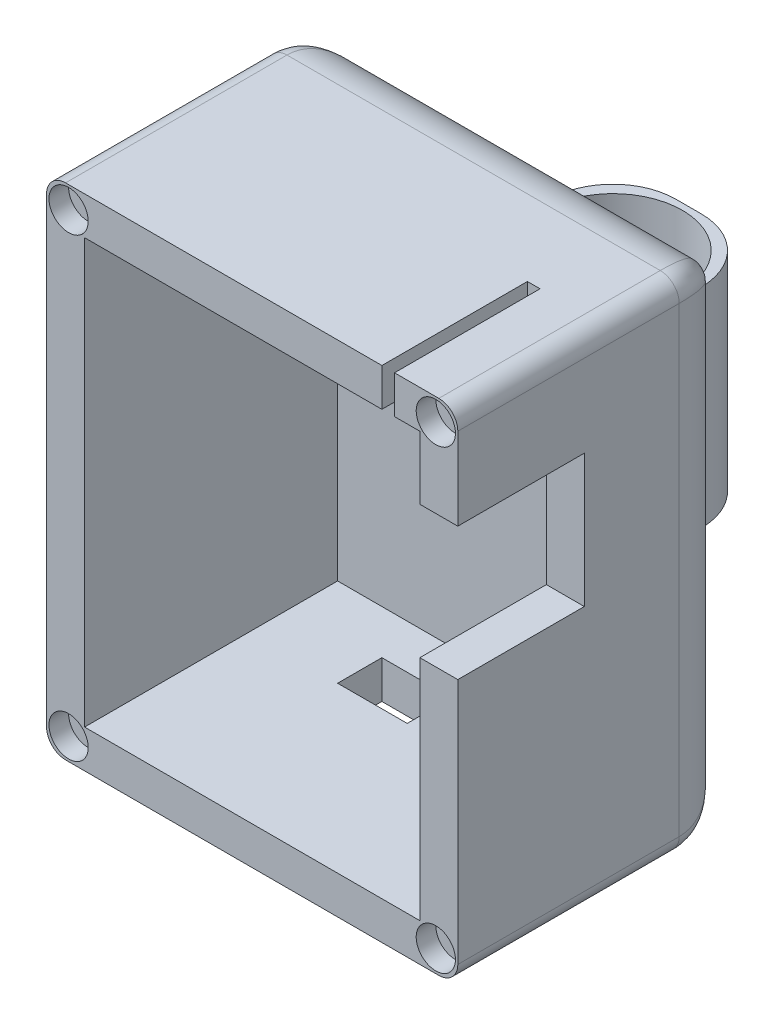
ISO-10303-21;
HEADER;
FILE_DESCRIPTION(('STEP AP214'),'2;1');
FILE_NAME('part.step','',(''),(''),'','','');
FILE_SCHEMA(('AUTOMOTIVE_DESIGN { 1 0 10303 214 1 1 1 1 }'));
ENDSEC;
DATA;
#1=APPLICATION_CONTEXT('core data for automotive mechanical design processes');
#2=APPLICATION_PROTOCOL_DEFINITION('international standard','automotive_design',2000,#1);
#3=PRODUCT_CONTEXT('',#1,'mechanical');
#4=PRODUCT('Part','Part','',(#3));
#5=PRODUCT_RELATED_PRODUCT_CATEGORY('part','',(#4));
#6=PRODUCT_DEFINITION_FORMATION('','',#4);
#7=PRODUCT_DEFINITION_CONTEXT('part definition',#1,'design');
#8=PRODUCT_DEFINITION('design','',#6,#7);
#9=PRODUCT_DEFINITION_SHAPE('','',#8);
#10=(LENGTH_UNIT() NAMED_UNIT(*) SI_UNIT(.MILLI.,.METRE.));
#11=(NAMED_UNIT(*) PLANE_ANGLE_UNIT() SI_UNIT($,.RADIAN.));
#12=(NAMED_UNIT(*) SI_UNIT($,.STERADIAN.) SOLID_ANGLE_UNIT());
#13=UNCERTAINTY_MEASURE_WITH_UNIT(LENGTH_MEASURE(1.E-05),#10,'distance_accuracy_value','');
#14=(GEOMETRIC_REPRESENTATION_CONTEXT(3) GLOBAL_UNCERTAINTY_ASSIGNED_CONTEXT((#13)) GLOBAL_UNIT_ASSIGNED_CONTEXT((#10,
#11,#12)) REPRESENTATION_CONTEXT('',''));
#15=CARTESIAN_POINT('',(0.,0.,0.));
#16=DIRECTION('',(0.,0.,1.));
#17=DIRECTION('',(1.,0.,0.));
#18=AXIS2_PLACEMENT_3D('',#15,#16,#17);
#19=CARTESIAN_POINT('',(0.,0.,0.));
#20=DIRECTION('',(0.,0.,-1.));
#21=DIRECTION('',(-1.,0.,0.));
#22=AXIS2_PLACEMENT_3D('',#19,#20,#21);
#23=PLANE('',#22);
#24=DIRECTION('',(-1.,0.,0.));
#25=VECTOR('',#24,1.);
#26=CARTESIAN_POINT('',(62.,69.,0.));
#27=LINE('',#26,#25);
#28=CARTESIAN_POINT('',(10.,69.,0.));
#29=VERTEX_POINT('',#28);
#30=CARTESIAN_POINT('',(55.,69.,0.));
#31=VERTEX_POINT('',#30);
#32=EDGE_CURVE('E469',#29,#31,#27,.F.);
#33=ORIENTED_EDGE('',*,*,#32,.T.);
#34=DIRECTION('',(0.,1.,0.));
#35=VECTOR('',#34,1.);
#36=CARTESIAN_POINT('',(55.,3.,0.));
#37=LINE('',#36,#35);
#38=CARTESIAN_POINT('',(55.,10.,0.));
#39=VERTEX_POINT('',#38);
#40=EDGE_CURVE('E475',#31,#39,#37,.F.);
#41=ORIENTED_EDGE('',*,*,#40,.T.);
#42=DIRECTION('',(1.,0.,0.));
#43=VECTOR('',#42,1.);
#44=CARTESIAN_POINT('',(3.,10.,0.));
#45=LINE('',#44,#43);
#46=CARTESIAN_POINT('',(10.,10.,0.));
#47=VERTEX_POINT('',#46);
#48=EDGE_CURVE('E473',#39,#47,#45,.F.);
#49=ORIENTED_EDGE('',*,*,#48,.T.);
#50=DIRECTION('',(0.,-1.,0.));
#51=VECTOR('',#50,1.);
#52=CARTESIAN_POINT('',(10.,76.,0.));
#53=LINE('',#52,#51);
#54=EDGE_CURVE('E471',#47,#29,#53,.F.);
#55=ORIENTED_EDGE('',*,*,#54,.T.);
#56=EDGE_LOOP('',(#33,#41,#49,#55));
#57=FACE_BOUND('',#56,.T.);
#58=DIRECTION('',(1.,0.,0.));
#59=VECTOR('',#58,1.);
#60=CARTESIAN_POINT('',(44.5,56.,0.));
#61=LINE('',#60,#59);
#62=CARTESIAN_POINT('',(20.5,56.,0.));
#63=VERTEX_POINT('',#62);
#64=CARTESIAN_POINT('',(44.5,56.,0.));
#65=VERTEX_POINT('',#64);
#66=EDGE_CURVE('E246',#63,#65,#61,.T.);
#67=ORIENTED_EDGE('',*,*,#66,.F.);
#68=DIRECTION('',(0.,1.,0.));
#69=VECTOR('',#68,1.);
#70=CARTESIAN_POINT('',(20.5,23.,0.));
#71=LINE('',#70,#69);
#72=CARTESIAN_POINT('',(20.5,23.,0.));
#73=VERTEX_POINT('',#72);
#74=EDGE_CURVE('E254',#73,#63,#71,.T.);
#75=ORIENTED_EDGE('',*,*,#74,.F.);
#76=DIRECTION('',(-1.,0.,0.));
#77=VECTOR('',#76,1.);
#78=CARTESIAN_POINT('',(44.5,23.,0.));
#79=LINE('',#78,#77);
#80=CARTESIAN_POINT('',(44.5,23.,0.));
#81=VERTEX_POINT('',#80);
#82=EDGE_CURVE('E266',#81,#73,#79,.T.);
#83=ORIENTED_EDGE('',*,*,#82,.F.);
#84=DIRECTION('',(0.,-1.,0.));
#85=VECTOR('',#84,1.);
#86=CARTESIAN_POINT('',(44.5,23.,0.));
#87=LINE('',#86,#85);
#88=EDGE_CURVE('E264',#65,#81,#87,.T.);
#89=ORIENTED_EDGE('',*,*,#88,.F.);
#90=EDGE_LOOP('',(#67,#75,#83,#89));
#91=FACE_BOUND('',#90,.T.);
#92=ADVANCED_FACE('F35',(#57,#91),#23,.T.);
#93=CARTESIAN_POINT('',(0.,0.,45.));
#94=DIRECTION('',(0.,0.,-1.));
#95=DIRECTION('',(-1.,0.,0.));
#96=AXIS2_PLACEMENT_3D('',#93,#94,#95);
#97=PLANE('',#96);
#98=CARTESIAN_POINT('',(3.47467811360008,3.47467811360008,45.));
#99=DIRECTION('',(0.,0.,-1.));
#100=DIRECTION('',(-1.,0.,0.));
#101=AXIS2_PLACEMENT_3D('',#98,#99,#100);
#102=CIRCLE('',#101,3.1);
#103=CARTESIAN_POINT('',(6.57467811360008,3.47467811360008,45.));
#104=VERTEX_POINT('',#103);
#105=EDGE_CURVE('E337',#104,#104,#102,.T.);
#106=ORIENTED_EDGE('',*,*,#105,.T.);
#107=EDGE_LOOP('',(#106));
#108=FACE_BOUND('',#107,.T.);
#109=CARTESIAN_POINT('',(3.47467811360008,75.5253218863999,45.));
#110=DIRECTION('',(0.,0.,1.));
#111=DIRECTION('',(1.,0.,0.));
#112=AXIS2_PLACEMENT_3D('',#109,#110,#111);
#113=CIRCLE('',#112,3.1);
#114=CARTESIAN_POINT('',(6.57467811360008,75.5253218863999,45.));
#115=VERTEX_POINT('',#114);
#116=EDGE_CURVE('E347',#115,#115,#113,.T.);
#117=ORIENTED_EDGE('',*,*,#116,.F.);
#118=EDGE_LOOP('',(#117));
#119=FACE_BOUND('',#118,.T.);
#120=CARTESIAN_POINT('',(61.5253218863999,3.47467811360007,45.));
#121=DIRECTION('',(0.,0.,1.));
#122=DIRECTION('',(1.,0.,0.));
#123=AXIS2_PLACEMENT_3D('',#120,#121,#122);
#124=CIRCLE('',#123,3.1);
#125=CARTESIAN_POINT('',(64.6253218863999,3.47467811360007,45.));
#126=VERTEX_POINT('',#125);
#127=EDGE_CURVE('E334',#126,#126,#124,.T.);
#128=ORIENTED_EDGE('',*,*,#127,.F.);
#129=EDGE_LOOP('',(#128));
#130=FACE_BOUND('',#129,.T.);
#131=DIRECTION('',(-1.,0.,0.));
#132=VECTOR('',#131,1.);
#133=CARTESIAN_POINT('',(0.,79.,45.));
#134=LINE('',#133,#132);
#135=CARTESIAN_POINT('',(53.0018467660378,79.,45.));
#136=VERTEX_POINT('',#135);
#137=CARTESIAN_POINT('',(3.,79.,45.));
#138=VERTEX_POINT('',#137);
#139=EDGE_CURVE('E402',#136,#138,#134,.T.);
#140=ORIENTED_EDGE('',*,*,#139,.T.);
#141=CARTESIAN_POINT('',(3.,76.,45.));
#142=DIRECTION('',(0.,0.,-1.));
#143=DIRECTION('',(-1.,0.,0.));
#144=AXIS2_PLACEMENT_3D('',#141,#142,#143);
#145=CIRCLE('',#144,3.);
#146=CARTESIAN_POINT('',(0.,76.,45.));
#147=VERTEX_POINT('',#146);
#148=EDGE_CURVE('E450',#138,#147,#145,.F.);
#149=ORIENTED_EDGE('',*,*,#148,.T.);
#150=DIRECTION('',(0.,-1.,0.));
#151=VECTOR('',#150,1.);
#152=CARTESIAN_POINT('',(0.,0.,45.));
#153=LINE('',#152,#151);
#154=CARTESIAN_POINT('',(0.,3.,45.));
#155=VERTEX_POINT('',#154);
#156=EDGE_CURVE('E386',#147,#155,#153,.T.);
#157=ORIENTED_EDGE('',*,*,#156,.T.);
#158=CARTESIAN_POINT('',(3.,3.,45.));
#159=DIRECTION('',(0.,0.,-1.));
#160=DIRECTION('',(-1.,0.,0.));
#161=AXIS2_PLACEMENT_3D('',#158,#159,#160);
#162=CIRCLE('',#161,3.);
#163=CARTESIAN_POINT('',(3.,0.,45.));
#164=VERTEX_POINT('',#163);
#165=EDGE_CURVE('E446',#155,#164,#162,.F.);
#166=ORIENTED_EDGE('',*,*,#165,.T.);
#167=DIRECTION('',(1.,0.,0.));
#168=VECTOR('',#167,1.);
#169=CARTESIAN_POINT('',(0.,0.,45.));
#170=LINE('',#169,#168);
#171=CARTESIAN_POINT('',(62.,0.,45.));
#172=VERTEX_POINT('',#171);
#173=EDGE_CURVE('E396',#164,#172,#170,.T.);
#174=ORIENTED_EDGE('',*,*,#173,.T.);
#175=CARTESIAN_POINT('',(62.,3.,45.));
#176=DIRECTION('',(0.,0.,-1.));
#177=DIRECTION('',(-1.,0.,0.));
#178=AXIS2_PLACEMENT_3D('',#175,#176,#177);
#179=CIRCLE('',#178,3.);
#180=CARTESIAN_POINT('',(65.,3.,45.));
#181=VERTEX_POINT('',#180);
#182=EDGE_CURVE('E448',#172,#181,#179,.F.);
#183=ORIENTED_EDGE('',*,*,#182,.T.);
#184=DIRECTION('',(0.,1.,0.));
#185=VECTOR('',#184,1.);
#186=CARTESIAN_POINT('',(65.,0.,45.));
#187=LINE('',#186,#185);
#188=CARTESIAN_POINT('',(65.,42.,45.));
#189=VERTEX_POINT('',#188);
#190=EDGE_CURVE('E400',#181,#189,#187,.T.);
#191=ORIENTED_EDGE('',*,*,#190,.T.);
#192=DIRECTION('',(1.,0.,0.));
#193=VECTOR('',#192,1.);
#194=CARTESIAN_POINT('',(57.,42.,45.));
#195=LINE('',#194,#193);
#196=CARTESIAN_POINT('',(59.,42.,45.));
#197=VERTEX_POINT('',#196);
#198=EDGE_CURVE('E323',#197,#189,#195,.T.);
#199=ORIENTED_EDGE('',*,*,#198,.F.);
#200=DIRECTION('',(0.,1.,0.));
#201=VECTOR('',#200,1.);
#202=CARTESIAN_POINT('',(59.,6.,45.));
#203=LINE('',#202,#201);
#204=CARTESIAN_POINT('',(59.,6.,45.));
#205=VERTEX_POINT('',#204);
#206=EDGE_CURVE('E372',#205,#197,#203,.T.);
#207=ORIENTED_EDGE('',*,*,#206,.F.);
#208=DIRECTION('',(1.,0.,0.));
#209=VECTOR('',#208,1.);
#210=CARTESIAN_POINT('',(6.00000000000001,5.99999999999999,45.));
#211=LINE('',#210,#209);
#212=CARTESIAN_POINT('',(6.00000000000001,5.99999999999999,45.));
#213=VERTEX_POINT('',#212);
#214=EDGE_CURVE('E362',#213,#205,#211,.T.);
#215=ORIENTED_EDGE('',*,*,#214,.F.);
#216=DIRECTION('',(0.,-1.,0.));
#217=VECTOR('',#216,1.);
#218=CARTESIAN_POINT('',(6.00000000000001,5.99999999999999,45.));
#219=LINE('',#218,#217);
#220=CARTESIAN_POINT('',(6.,73.,45.));
#221=VERTEX_POINT('',#220);
#222=EDGE_CURVE('E379',#221,#213,#219,.T.);
#223=ORIENTED_EDGE('',*,*,#222,.F.);
#224=DIRECTION('',(-1.,0.,0.));
#225=VECTOR('',#224,1.);
#226=CARTESIAN_POINT('',(6.,73.,45.));
#227=LINE('',#226,#225);
#228=CARTESIAN_POINT('',(53.0018467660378,73.,45.));
#229=VERTEX_POINT('',#228);
#230=EDGE_CURVE('E375',#229,#221,#227,.T.);
#231=ORIENTED_EDGE('',*,*,#230,.F.);
#232=DIRECTION('',(0.,1.,0.));
#233=VECTOR('',#232,1.);
#234=CARTESIAN_POINT('',(53.0018467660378,71.,45.));
#235=LINE('',#234,#233);
#236=EDGE_CURVE('E312',#229,#136,#235,.T.);
#237=ORIENTED_EDGE('',*,*,#236,.T.);
#238=EDGE_LOOP('',(#140,#149,#157,#166,#174,#183,#191,#199,#207,#215,#223,#231,#237));
#239=FACE_BOUND('',#238,.T.);
#240=ADVANCED_FACE('F564',(#108,#119,#130,#239),#97,.F.);
#241=CARTESIAN_POINT('',(61.5253218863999,75.5253218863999,45.));
#242=DIRECTION('',(0.,0.,-1.));
#243=DIRECTION('',(-1.,0.,0.));
#244=AXIS2_PLACEMENT_3D('',#241,#242,#243);
#245=CIRCLE('',#244,3.1);
#246=CARTESIAN_POINT('',(64.6253218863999,75.5253218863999,45.));
#247=VERTEX_POINT('',#246);
#248=EDGE_CURVE('E341',#247,#247,#245,.T.);
#249=ORIENTED_EDGE('',*,*,#248,.T.);
#250=EDGE_LOOP('',(#249));
#251=FACE_BOUND('',#250,.T.);
#252=CARTESIAN_POINT('',(65.,63.,45.));
#253=VERTEX_POINT('',#252);
#254=CARTESIAN_POINT('',(65.,76.,45.));
#255=VERTEX_POINT('',#254);
#256=EDGE_CURVE('E399',#253,#255,#187,.T.);
#257=ORIENTED_EDGE('',*,*,#256,.T.);
#258=CARTESIAN_POINT('',(62.,76.,45.));
#259=DIRECTION('',(0.,0.,-1.));
#260=DIRECTION('',(-1.,0.,0.));
#261=AXIS2_PLACEMENT_3D('',#258,#259,#260);
#262=CIRCLE('',#261,3.);
#263=CARTESIAN_POINT('',(62.,79.,45.));
#264=VERTEX_POINT('',#263);
#265=EDGE_CURVE('E457',#255,#264,#262,.F.);
#266=ORIENTED_EDGE('',*,*,#265,.T.);
#267=CARTESIAN_POINT('',(55.,79.,45.));
#268=VERTEX_POINT('',#267);
#269=EDGE_CURVE('E403',#264,#268,#134,.T.);
#270=ORIENTED_EDGE('',*,*,#269,.T.);
#271=DIRECTION('',(0.,1.,0.));
#272=VECTOR('',#271,1.);
#273=CARTESIAN_POINT('',(55.,71.,45.));
#274=LINE('',#273,#272);
#275=CARTESIAN_POINT('',(55.,73.,45.));
#276=VERTEX_POINT('',#275);
#277=EDGE_CURVE('E305',#276,#268,#274,.T.);
#278=ORIENTED_EDGE('',*,*,#277,.F.);
#279=CARTESIAN_POINT('',(59.,73.,45.));
#280=VERTEX_POINT('',#279);
#281=EDGE_CURVE('E376',#280,#276,#227,.T.);
#282=ORIENTED_EDGE('',*,*,#281,.F.);
#283=CARTESIAN_POINT('',(59.,63.,45.));
#284=VERTEX_POINT('',#283);
#285=EDGE_CURVE('E355',#284,#280,#203,.T.);
#286=ORIENTED_EDGE('',*,*,#285,.F.);
#287=DIRECTION('',(1.,0.,0.));
#288=VECTOR('',#287,1.);
#289=CARTESIAN_POINT('',(57.,63.,45.));
#290=LINE('',#289,#288);
#291=EDGE_CURVE('E324',#284,#253,#290,.T.);
#292=ORIENTED_EDGE('',*,*,#291,.T.);
#293=EDGE_LOOP('',(#257,#266,#270,#278,#282,#286,#292));
#294=FACE_BOUND('',#293,.T.);
#295=ADVANCED_FACE('F570',(#251,#294),#97,.F.);
#296=CARTESIAN_POINT('',(0.,79.,45.));
#297=DIRECTION('',(0.,-1.,0.));
#298=DIRECTION('',(0.,0.,-1.));
#299=AXIS2_PLACEMENT_3D('',#296,#297,#298);
#300=PLANE('',#299);
#301=DIRECTION('',(0.,0.,-1.));
#302=VECTOR('',#301,1.);
#303=CARTESIAN_POINT('',(62.,79.,45.));
#304=LINE('',#303,#302);
#305=CARTESIAN_POINT('',(62.,79.,10.));
#306=VERTEX_POINT('',#305);
#307=EDGE_CURVE('E441',#264,#306,#304,.T.);
#308=ORIENTED_EDGE('',*,*,#307,.T.);
#309=DIRECTION('',(-1.,0.,0.));
#310=VECTOR('',#309,1.);
#311=CARTESIAN_POINT('',(3.,79.,10.));
#312=LINE('',#311,#310);
#313=CARTESIAN_POINT('',(3.,79.,10.));
#314=VERTEX_POINT('',#313);
#315=EDGE_CURVE('E488',#306,#314,#312,.T.);
#316=ORIENTED_EDGE('',*,*,#315,.T.);
#317=DIRECTION('',(0.,0.,-1.));
#318=VECTOR('',#317,1.);
#319=CARTESIAN_POINT('',(3.,79.,45.));
#320=LINE('',#319,#318);
#321=EDGE_CURVE('E444',#314,#138,#320,.F.);
#322=ORIENTED_EDGE('',*,*,#321,.T.);
#323=ORIENTED_EDGE('',*,*,#139,.F.);
#324=DIRECTION('',(0.,0.,-1.));
#325=VECTOR('',#324,1.);
#326=CARTESIAN_POINT('',(53.0018467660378,79.,45.));
#327=LINE('',#326,#325);
#328=CARTESIAN_POINT('',(53.0018467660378,79.,22.));
#329=VERTEX_POINT('',#328);
#330=EDGE_CURVE('E290',#136,#329,#327,.T.);
#331=ORIENTED_EDGE('',*,*,#330,.T.);
#332=DIRECTION('',(1.,0.,0.));
#333=VECTOR('',#332,1.);
#334=CARTESIAN_POINT('',(53.0018467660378,79.,22.));
#335=LINE('',#334,#333);
#336=CARTESIAN_POINT('',(55.,79.,22.));
#337=VERTEX_POINT('',#336);
#338=EDGE_CURVE('E299',#329,#337,#335,.T.);
#339=ORIENTED_EDGE('',*,*,#338,.T.);
#340=DIRECTION('',(0.,0.,1.));
#341=VECTOR('',#340,1.);
#342=CARTESIAN_POINT('',(55.,79.,22.));
#343=LINE('',#342,#341);
#344=EDGE_CURVE('E302',#337,#268,#343,.T.);
#345=ORIENTED_EDGE('',*,*,#344,.T.);
#346=ORIENTED_EDGE('',*,*,#269,.F.);
#347=EDGE_LOOP('',(#308,#316,#322,#323,#331,#339,#345,#346));
#348=FACE_BOUND('',#347,.T.);
#349=ADVANCED_FACE('F575',(#348),#300,.F.);
#350=CARTESIAN_POINT('',(6.,73.,5.));
#351=DIRECTION('',(0.,1.,0.));
#352=DIRECTION('',(-1.,0.,0.));
#353=AXIS2_PLACEMENT_3D('',#350,#351,#352);
#354=PLANE('',#353);
#355=DIRECTION('',(0.,0.,-1.));
#356=VECTOR('',#355,1.);
#357=CARTESIAN_POINT('',(53.0018467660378,73.,5.));
#358=LINE('',#357,#356);
#359=CARTESIAN_POINT('',(53.0018467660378,73.,22.));
#360=VERTEX_POINT('',#359);
#361=EDGE_CURVE('E419',#229,#360,#358,.T.);
#362=ORIENTED_EDGE('',*,*,#361,.F.);
#363=ORIENTED_EDGE('',*,*,#230,.T.);
#364=DIRECTION('',(0.,0.,1.));
#365=VECTOR('',#364,1.);
#366=CARTESIAN_POINT('',(6.,73.,5.));
#367=LINE('',#366,#365);
#368=CARTESIAN_POINT('',(6.,73.,5.));
#369=VERTEX_POINT('',#368);
#370=EDGE_CURVE('E389',#369,#221,#367,.T.);
#371=ORIENTED_EDGE('',*,*,#370,.F.);
#372=DIRECTION('',(-1.,0.,0.));
#373=VECTOR('',#372,1.);
#374=CARTESIAN_POINT('',(6.,73.,5.));
#375=LINE('',#374,#373);
#376=CARTESIAN_POINT('',(59.,73.,5.));
#377=VERTEX_POINT('',#376);
#378=EDGE_CURVE('E361',#377,#369,#375,.T.);
#379=ORIENTED_EDGE('',*,*,#378,.F.);
#380=DIRECTION('',(0.,0.,1.));
#381=VECTOR('',#380,1.);
#382=CARTESIAN_POINT('',(59.,73.,5.));
#383=LINE('',#382,#381);
#384=EDGE_CURVE('E371',#377,#280,#383,.T.);
#385=ORIENTED_EDGE('',*,*,#384,.T.);
#386=ORIENTED_EDGE('',*,*,#281,.T.);
#387=DIRECTION('',(0.,0.,1.));
#388=VECTOR('',#387,1.);
#389=CARTESIAN_POINT('',(55.,73.,5.));
#390=LINE('',#389,#388);
#391=CARTESIAN_POINT('',(55.,73.,22.));
#392=VERTEX_POINT('',#391);
#393=EDGE_CURVE('E414',#392,#276,#390,.T.);
#394=ORIENTED_EDGE('',*,*,#393,.F.);
#395=DIRECTION('',(1.,0.,0.));
#396=VECTOR('',#395,1.);
#397=CARTESIAN_POINT('',(6.,73.,22.));
#398=LINE('',#397,#396);
#399=EDGE_CURVE('E416',#360,#392,#398,.T.);
#400=ORIENTED_EDGE('',*,*,#399,.F.);
#401=EDGE_LOOP('',(#362,#363,#371,#379,#385,#386,#394,#400));
#402=FACE_BOUND('',#401,.T.);
#403=ADVANCED_FACE('F578',(#402),#354,.F.);
#404=CARTESIAN_POINT('',(0.,0.,45.));
#405=DIRECTION('',(1.,0.,0.));
#406=DIRECTION('',(0.,0.,-1.));
#407=AXIS2_PLACEMENT_3D('',#404,#405,#406);
#408=PLANE('',#407);
#409=DIRECTION('',(0.,0.,-1.));
#410=VECTOR('',#409,1.);
#411=CARTESIAN_POINT('',(0.,76.,45.));
#412=LINE('',#411,#410);
#413=CARTESIAN_POINT('',(0.,76.,10.));
#414=VERTEX_POINT('',#413);
#415=EDGE_CURVE('E438',#147,#414,#412,.T.);
#416=ORIENTED_EDGE('',*,*,#415,.T.);
#417=DIRECTION('',(0.,-1.,0.));
#418=VECTOR('',#417,1.);
#419=CARTESIAN_POINT('',(0.,3.,10.));
#420=LINE('',#419,#418);
#421=CARTESIAN_POINT('',(0.,3.,10.));
#422=VERTEX_POINT('',#421);
#423=EDGE_CURVE('E484',#414,#422,#420,.T.);
#424=ORIENTED_EDGE('',*,*,#423,.T.);
#425=DIRECTION('',(0.,0.,-1.));
#426=VECTOR('',#425,1.);
#427=CARTESIAN_POINT('',(0.,3.,45.));
#428=LINE('',#427,#426);
#429=EDGE_CURVE('E433',#422,#155,#428,.F.);
#430=ORIENTED_EDGE('',*,*,#429,.T.);
#431=ORIENTED_EDGE('',*,*,#156,.F.);
#432=EDGE_LOOP('',(#416,#424,#430,#431));
#433=FACE_BOUND('',#432,.T.);
#434=ADVANCED_FACE('F588',(#433),#408,.F.);
#435=CARTESIAN_POINT('',(0.,0.,45.));
#436=DIRECTION('',(0.,1.,0.));
#437=DIRECTION('',(0.,0.,1.));
#438=AXIS2_PLACEMENT_3D('',#435,#436,#437);
#439=PLANE('',#438);
#440=DIRECTION('',(-1.,0.,0.));
#441=VECTOR('',#440,1.);
#442=CARTESIAN_POINT('',(20.,0.,19.));
#443=LINE('',#442,#441);
#444=CARTESIAN_POINT('',(31.,0.,19.));
#445=VERTEX_POINT('',#444);
#446=CARTESIAN_POINT('',(20.,0.,19.));
#447=VERTEX_POINT('',#446);
#448=EDGE_CURVE('E278',#445,#447,#443,.T.);
#449=ORIENTED_EDGE('',*,*,#448,.F.);
#450=DIRECTION('',(0.,0.,1.));
#451=VECTOR('',#450,1.);
#452=CARTESIAN_POINT('',(31.,0.,12.));
#453=LINE('',#452,#451);
#454=CARTESIAN_POINT('',(31.,0.,12.));
#455=VERTEX_POINT('',#454);
#456=EDGE_CURVE('E250',#455,#445,#453,.T.);
#457=ORIENTED_EDGE('',*,*,#456,.F.);
#458=DIRECTION('',(1.,0.,0.));
#459=VECTOR('',#458,1.);
#460=CARTESIAN_POINT('',(20.,0.,12.));
#461=LINE('',#460,#459);
#462=CARTESIAN_POINT('',(20.,0.,12.));
#463=VERTEX_POINT('',#462);
#464=EDGE_CURVE('E284',#463,#455,#461,.T.);
#465=ORIENTED_EDGE('',*,*,#464,.F.);
#466=DIRECTION('',(0.,0.,-1.));
#467=VECTOR('',#466,1.);
#468=CARTESIAN_POINT('',(20.,0.,12.));
#469=LINE('',#468,#467);
#470=EDGE_CURVE('E281',#447,#463,#469,.T.);
#471=ORIENTED_EDGE('',*,*,#470,.F.);
#472=EDGE_LOOP('',(#449,#457,#465,#471));
#473=FACE_BOUND('',#472,.T.);
#474=DIRECTION('',(0.,0.,-1.));
#475=VECTOR('',#474,1.);
#476=CARTESIAN_POINT('',(3.,0.,45.));
#477=LINE('',#476,#475);
#478=CARTESIAN_POINT('',(3.,0.,10.));
#479=VERTEX_POINT('',#478);
#480=EDGE_CURVE('E459',#164,#479,#477,.T.);
#481=ORIENTED_EDGE('',*,*,#480,.T.);
#482=DIRECTION('',(1.,0.,0.));
#483=VECTOR('',#482,1.);
#484=CARTESIAN_POINT('',(62.,0.,10.));
#485=LINE('',#484,#483);
#486=CARTESIAN_POINT('',(62.,0.,10.));
#487=VERTEX_POINT('',#486);
#488=EDGE_CURVE('E480',#479,#487,#485,.T.);
#489=ORIENTED_EDGE('',*,*,#488,.T.);
#490=DIRECTION('',(0.,0.,-1.));
#491=VECTOR('',#490,1.);
#492=CARTESIAN_POINT('',(62.,0.,45.));
#493=LINE('',#492,#491);
#494=EDGE_CURVE('E462',#487,#172,#493,.F.);
#495=ORIENTED_EDGE('',*,*,#494,.T.);
#496=ORIENTED_EDGE('',*,*,#173,.F.);
#497=EDGE_LOOP('',(#481,#489,#495,#496));
#498=FACE_BOUND('',#497,.T.);
#499=ADVANCED_FACE('F584',(#473,#498),#439,.F.);
#500=CARTESIAN_POINT('',(65.,0.,45.));
#501=DIRECTION('',(-1.,0.,0.));
#502=DIRECTION('',(0.,-1.,0.));
#503=AXIS2_PLACEMENT_3D('',#500,#501,#502);
#504=PLANE('',#503);
#505=DIRECTION('',(0.,0.,-1.));
#506=VECTOR('',#505,1.);
#507=CARTESIAN_POINT('',(65.,3.,45.));
#508=LINE('',#507,#506);
#509=CARTESIAN_POINT('',(65.,3.,10.));
#510=VERTEX_POINT('',#509);
#511=EDGE_CURVE('E452',#181,#510,#508,.T.);
#512=ORIENTED_EDGE('',*,*,#511,.T.);
#513=DIRECTION('',(0.,1.,0.));
#514=VECTOR('',#513,1.);
#515=CARTESIAN_POINT('',(65.,76.,10.));
#516=LINE('',#515,#514);
#517=CARTESIAN_POINT('',(65.,76.,10.));
#518=VERTEX_POINT('',#517);
#519=EDGE_CURVE('E467',#510,#518,#516,.T.);
#520=ORIENTED_EDGE('',*,*,#519,.T.);
#521=DIRECTION('',(0.,0.,-1.));
#522=VECTOR('',#521,1.);
#523=CARTESIAN_POINT('',(65.,76.,45.));
#524=LINE('',#523,#522);
#525=EDGE_CURVE('E455',#518,#255,#524,.F.);
#526=ORIENTED_EDGE('',*,*,#525,.T.);
#527=ORIENTED_EDGE('',*,*,#256,.F.);
#528=DIRECTION('',(0.,0.,1.));
#529=VECTOR('',#528,1.);
#530=CARTESIAN_POINT('',(65.,63.,25.));
#531=LINE('',#530,#529);
#532=CARTESIAN_POINT('',(65.,63.,25.));
#533=VERTEX_POINT('',#532);
#534=EDGE_CURVE('E321',#533,#253,#531,.T.);
#535=ORIENTED_EDGE('',*,*,#534,.F.);
#536=DIRECTION('',(0.,1.,0.));
#537=VECTOR('',#536,1.);
#538=CARTESIAN_POINT('',(65.,63.,25.));
#539=LINE('',#538,#537);
#540=CARTESIAN_POINT('',(65.,42.,25.));
#541=VERTEX_POINT('',#540);
#542=EDGE_CURVE('E318',#541,#533,#539,.T.);
#543=ORIENTED_EDGE('',*,*,#542,.F.);
#544=DIRECTION('',(0.,0.,-1.));
#545=VECTOR('',#544,1.);
#546=CARTESIAN_POINT('',(65.,42.,25.));
#547=LINE('',#546,#545);
#548=EDGE_CURVE('E315',#189,#541,#547,.T.);
#549=ORIENTED_EDGE('',*,*,#548,.F.);
#550=ORIENTED_EDGE('',*,*,#190,.F.);
#551=EDGE_LOOP('',(#512,#520,#526,#527,#535,#543,#549,#550));
#552=FACE_BOUND('',#551,.T.);
#553=ADVANCED_FACE('F580',(#552),#504,.F.);
#554=CARTESIAN_POINT('',(59.,6.,5.));
#555=DIRECTION('',(1.,0.,0.));
#556=DIRECTION('',(0.,1.,0.));
#557=AXIS2_PLACEMENT_3D('',#554,#555,#556);
#558=PLANE('',#557);
#559=DIRECTION('',(0.,1.,0.));
#560=VECTOR('',#559,1.);
#561=CARTESIAN_POINT('',(59.,6.,25.));
#562=LINE('',#561,#560);
#563=CARTESIAN_POINT('',(59.,42.,25.));
#564=VERTEX_POINT('',#563);
#565=CARTESIAN_POINT('',(59.,63.,25.));
#566=VERTEX_POINT('',#565);
#567=EDGE_CURVE('E408',#564,#566,#562,.T.);
#568=ORIENTED_EDGE('',*,*,#567,.T.);
#569=DIRECTION('',(0.,0.,1.));
#570=VECTOR('',#569,1.);
#571=CARTESIAN_POINT('',(59.,63.,5.));
#572=LINE('',#571,#570);
#573=EDGE_CURVE('E411',#566,#284,#572,.T.);
#574=ORIENTED_EDGE('',*,*,#573,.T.);
#575=ORIENTED_EDGE('',*,*,#285,.T.);
#576=ORIENTED_EDGE('',*,*,#384,.F.);
#577=DIRECTION('',(0.,1.,0.));
#578=VECTOR('',#577,1.);
#579=CARTESIAN_POINT('',(59.,6.,5.));
#580=LINE('',#579,#578);
#581=CARTESIAN_POINT('',(59.,6.,5.));
#582=VERTEX_POINT('',#581);
#583=EDGE_CURVE('E358',#582,#377,#580,.T.);
#584=ORIENTED_EDGE('',*,*,#583,.F.);
#585=DIRECTION('',(0.,0.,1.));
#586=VECTOR('',#585,1.);
#587=CARTESIAN_POINT('',(59.,6.,5.));
#588=LINE('',#587,#586);
#589=EDGE_CURVE('E384',#582,#205,#588,.T.);
#590=ORIENTED_EDGE('',*,*,#589,.T.);
#591=ORIENTED_EDGE('',*,*,#206,.T.);
#592=DIRECTION('',(0.,0.,-1.));
#593=VECTOR('',#592,1.);
#594=CARTESIAN_POINT('',(59.,42.,5.));
#595=LINE('',#594,#593);
#596=EDGE_CURVE('E405',#197,#564,#595,.T.);
#597=ORIENTED_EDGE('',*,*,#596,.T.);
#598=EDGE_LOOP('',(#568,#574,#575,#576,#584,#590,#591,#597));
#599=FACE_BOUND('',#598,.T.);
#600=ADVANCED_FACE('F583',(#599),#558,.F.);
#601=CARTESIAN_POINT('',(6.00000000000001,5.99999999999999,5.));
#602=DIRECTION('',(0.,-1.,0.));
#603=DIRECTION('',(1.,0.,0.));
#604=AXIS2_PLACEMENT_3D('',#601,#602,#603);
#605=PLANE('',#604);
#606=DIRECTION('',(1.,0.,0.));
#607=VECTOR('',#606,1.);
#608=CARTESIAN_POINT('',(6.00000000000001,5.99999999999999,12.));
#609=LINE('',#608,#607);
#610=CARTESIAN_POINT('',(20.,6.,12.));
#611=VERTEX_POINT('',#610);
#612=CARTESIAN_POINT('',(31.,6.,12.));
#613=VERTEX_POINT('',#612);
#614=EDGE_CURVE('E427',#611,#613,#609,.T.);
#615=ORIENTED_EDGE('',*,*,#614,.T.);
#616=DIRECTION('',(0.,0.,1.));
#617=VECTOR('',#616,1.);
#618=CARTESIAN_POINT('',(31.,6.,5.));
#619=LINE('',#618,#617);
#620=CARTESIAN_POINT('',(31.,6.,19.));
#621=VERTEX_POINT('',#620);
#622=EDGE_CURVE('E430',#613,#621,#619,.T.);
#623=ORIENTED_EDGE('',*,*,#622,.T.);
#624=DIRECTION('',(-1.,0.,0.));
#625=VECTOR('',#624,1.);
#626=CARTESIAN_POINT('',(6.00000000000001,5.99999999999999,19.));
#627=LINE('',#626,#625);
#628=CARTESIAN_POINT('',(20.,6.,19.));
#629=VERTEX_POINT('',#628);
#630=EDGE_CURVE('E421',#621,#629,#627,.T.);
#631=ORIENTED_EDGE('',*,*,#630,.T.);
#632=DIRECTION('',(0.,0.,-1.));
#633=VECTOR('',#632,1.);
#634=CARTESIAN_POINT('',(20.,6.,5.));
#635=LINE('',#634,#633);
#636=EDGE_CURVE('E424',#629,#611,#635,.T.);
#637=ORIENTED_EDGE('',*,*,#636,.T.);
#638=EDGE_LOOP('',(#615,#623,#631,#637));
#639=FACE_BOUND('',#638,.T.);
#640=ORIENTED_EDGE('',*,*,#214,.T.);
#641=ORIENTED_EDGE('',*,*,#589,.F.);
#642=DIRECTION('',(1.,0.,0.));
#643=VECTOR('',#642,1.);
#644=CARTESIAN_POINT('',(6.00000000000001,5.99999999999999,5.));
#645=LINE('',#644,#643);
#646=CARTESIAN_POINT('',(6.00000000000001,5.99999999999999,5.));
#647=VERTEX_POINT('',#646);
#648=EDGE_CURVE('E368',#647,#582,#645,.T.);
#649=ORIENTED_EDGE('',*,*,#648,.F.);
#650=DIRECTION('',(0.,0.,1.));
#651=VECTOR('',#650,1.);
#652=CARTESIAN_POINT('',(6.00000000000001,5.99999999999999,5.));
#653=LINE('',#652,#651);
#654=EDGE_CURVE('E387',#647,#213,#653,.T.);
#655=ORIENTED_EDGE('',*,*,#654,.T.);
#656=EDGE_LOOP('',(#640,#641,#649,#655));
#657=FACE_BOUND('',#656,.T.);
#658=ADVANCED_FACE('F704',(#639,#657),#605,.F.);
#659=CARTESIAN_POINT('',(6.00000000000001,5.99999999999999,5.));
#660=DIRECTION('',(-1.,0.,0.));
#661=DIRECTION('',(0.,-1.,0.));
#662=AXIS2_PLACEMENT_3D('',#659,#660,#661);
#663=PLANE('',#662);
#664=ORIENTED_EDGE('',*,*,#222,.T.);
#665=ORIENTED_EDGE('',*,*,#654,.F.);
#666=DIRECTION('',(0.,-1.,0.));
#667=VECTOR('',#666,1.);
#668=CARTESIAN_POINT('',(6.00000000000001,5.99999999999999,5.));
#669=LINE('',#668,#667);
#670=EDGE_CURVE('E365',#369,#647,#669,.T.);
#671=ORIENTED_EDGE('',*,*,#670,.F.);
#672=ORIENTED_EDGE('',*,*,#370,.T.);
#673=EDGE_LOOP('',(#664,#665,#671,#672));
#674=FACE_BOUND('',#673,.T.);
#675=ADVANCED_FACE('F698',(#674),#663,.F.);
#676=CARTESIAN_POINT('',(0.,0.,5.));
#677=DIRECTION('',(0.,0.,-1.));
#678=DIRECTION('',(-1.,0.,0.));
#679=AXIS2_PLACEMENT_3D('',#676,#677,#678);
#680=PLANE('',#679);
#681=ORIENTED_EDGE('',*,*,#583,.T.);
#682=ORIENTED_EDGE('',*,*,#378,.T.);
#683=ORIENTED_EDGE('',*,*,#670,.T.);
#684=ORIENTED_EDGE('',*,*,#648,.T.);
#685=EDGE_LOOP('',(#681,#682,#683,#684));
#686=FACE_BOUND('',#685,.T.);
#687=ADVANCED_FACE('F702',(#686),#680,.F.);
#688=CARTESIAN_POINT('',(3.47467811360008,3.47467811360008,41.9));
#689=DIRECTION('',(0.,0.,1.));
#690=DIRECTION('',(1.,0.,0.));
#691=AXIS2_PLACEMENT_3D('',#688,#689,#690);
#692=CYLINDRICAL_SURFACE('',#691,3.1);
#693=CARTESIAN_POINT('',(3.47467811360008,3.47467811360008,41.9));
#694=DIRECTION('',(0.,0.,-1.));
#695=DIRECTION('',(-1.,0.,0.));
#696=AXIS2_PLACEMENT_3D('',#693,#694,#695);
#697=CIRCLE('',#696,3.1);
#698=CARTESIAN_POINT('',(6.57467811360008,3.47467811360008,41.9));
#699=VERTEX_POINT('',#698);
#700=EDGE_CURVE('E352',#699,#699,#697,.T.);
#701=CARTESIAN_POINT('',(6.57467811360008,3.47467811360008,41.9));
#702=CARTESIAN_POINT('',(6.57467811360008,3.47467811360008,41.9322916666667));
#703=CARTESIAN_POINT('',(6.57467811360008,3.47467811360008,41.9645833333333));
#704=CARTESIAN_POINT('',(6.57467811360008,3.47467811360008,42.0291666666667));
#705=CARTESIAN_POINT('',(6.57467811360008,3.47467811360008,42.0614583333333));
#706=CARTESIAN_POINT('',(6.57467811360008,3.47467811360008,42.1260416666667));
#707=CARTESIAN_POINT('',(6.57467811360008,3.47467811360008,42.1583333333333));
#708=CARTESIAN_POINT('',(6.57467811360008,3.47467811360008,42.2229166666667));
#709=CARTESIAN_POINT('',(6.57467811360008,3.47467811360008,42.2552083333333));
#710=CARTESIAN_POINT('',(6.57467811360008,3.47467811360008,42.3197916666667));
#711=CARTESIAN_POINT('',(6.57467811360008,3.47467811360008,42.3520833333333));
#712=CARTESIAN_POINT('',(6.57467811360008,3.47467811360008,42.4166666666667));
#713=CARTESIAN_POINT('',(6.57467811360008,3.47467811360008,42.4489583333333));
#714=CARTESIAN_POINT('',(6.57467811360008,3.47467811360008,42.5135416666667));
#715=CARTESIAN_POINT('',(6.57467811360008,3.47467811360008,42.5458333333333));
#716=CARTESIAN_POINT('',(6.57467811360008,3.47467811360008,42.6104166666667));
#717=CARTESIAN_POINT('',(6.57467811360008,3.47467811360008,42.6427083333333));
#718=CARTESIAN_POINT('',(6.57467811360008,3.47467811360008,42.7072916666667));
#719=CARTESIAN_POINT('',(6.57467811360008,3.47467811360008,42.7395833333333));
#720=CARTESIAN_POINT('',(6.57467811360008,3.47467811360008,42.8041666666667));
#721=CARTESIAN_POINT('',(6.57467811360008,3.47467811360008,42.8364583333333));
#722=CARTESIAN_POINT('',(6.57467811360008,3.47467811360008,42.9010416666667));
#723=CARTESIAN_POINT('',(6.57467811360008,3.47467811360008,42.9333333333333));
#724=CARTESIAN_POINT('',(6.57467811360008,3.47467811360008,42.9979166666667));
#725=CARTESIAN_POINT('',(6.57467811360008,3.47467811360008,43.0302083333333));
#726=CARTESIAN_POINT('',(6.57467811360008,3.47467811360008,43.0947916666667));
#727=CARTESIAN_POINT('',(6.57467811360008,3.47467811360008,43.1270833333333));
#728=CARTESIAN_POINT('',(6.57467811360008,3.47467811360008,43.1916666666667));
#729=CARTESIAN_POINT('',(6.57467811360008,3.47467811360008,43.2239583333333));
#730=CARTESIAN_POINT('',(6.57467811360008,3.47467811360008,43.2885416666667));
#731=CARTESIAN_POINT('',(6.57467811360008,3.47467811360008,43.3208333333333));
#732=CARTESIAN_POINT('',(6.57467811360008,3.47467811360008,43.3854166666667));
#733=CARTESIAN_POINT('',(6.57467811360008,3.47467811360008,43.4177083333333));
#734=CARTESIAN_POINT('',(6.57467811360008,3.47467811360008,43.4822916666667));
#735=CARTESIAN_POINT('',(6.57467811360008,3.47467811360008,43.5145833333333));
#736=CARTESIAN_POINT('',(6.57467811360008,3.47467811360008,43.5791666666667));
#737=CARTESIAN_POINT('',(6.57467811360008,3.47467811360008,43.6114583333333));
#738=CARTESIAN_POINT('',(6.57467811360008,3.47467811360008,43.6760416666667));
#739=CARTESIAN_POINT('',(6.57467811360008,3.47467811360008,43.7083333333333));
#740=CARTESIAN_POINT('',(6.57467811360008,3.47467811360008,43.7729166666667));
#741=CARTESIAN_POINT('',(6.57467811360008,3.47467811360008,43.8052083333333));
#742=CARTESIAN_POINT('',(6.57467811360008,3.47467811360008,43.8697916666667));
#743=CARTESIAN_POINT('',(6.57467811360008,3.47467811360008,43.9020833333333));
#744=CARTESIAN_POINT('',(6.57467811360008,3.47467811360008,43.9666666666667));
#745=CARTESIAN_POINT('',(6.57467811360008,3.47467811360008,43.9989583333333));
#746=CARTESIAN_POINT('',(6.57467811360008,3.47467811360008,44.0635416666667));
#747=CARTESIAN_POINT('',(6.57467811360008,3.47467811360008,44.0958333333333));
#748=CARTESIAN_POINT('',(6.57467811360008,3.47467811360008,44.1604166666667));
#749=CARTESIAN_POINT('',(6.57467811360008,3.47467811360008,44.1927083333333));
#750=CARTESIAN_POINT('',(6.57467811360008,3.47467811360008,44.2572916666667));
#751=CARTESIAN_POINT('',(6.57467811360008,3.47467811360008,44.2895833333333));
#752=CARTESIAN_POINT('',(6.57467811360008,3.47467811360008,44.3541666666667));
#753=CARTESIAN_POINT('',(6.57467811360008,3.47467811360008,44.3864583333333));
#754=CARTESIAN_POINT('',(6.57467811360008,3.47467811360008,44.4510416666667));
#755=CARTESIAN_POINT('',(6.57467811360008,3.47467811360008,44.4833333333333));
#756=CARTESIAN_POINT('',(6.57467811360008,3.47467811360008,44.5479166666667));
#757=CARTESIAN_POINT('',(6.57467811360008,3.47467811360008,44.5802083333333));
#758=CARTESIAN_POINT('',(6.57467811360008,3.47467811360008,44.6447916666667));
#759=CARTESIAN_POINT('',(6.57467811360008,3.47467811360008,44.6770833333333));
#760=CARTESIAN_POINT('',(6.57467811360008,3.47467811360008,44.7416666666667));
#761=CARTESIAN_POINT('',(6.57467811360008,3.47467811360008,44.7739583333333));
#762=CARTESIAN_POINT('',(6.57467811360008,3.47467811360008,44.8385416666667));
#763=CARTESIAN_POINT('',(6.57467811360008,3.47467811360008,44.8708333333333));
#764=CARTESIAN_POINT('',(6.57467811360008,3.47467811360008,44.9354166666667));
#765=CARTESIAN_POINT('',(6.57467811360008,3.47467811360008,44.9677083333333));
#766=CARTESIAN_POINT('',(6.57467811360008,3.47467811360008,45.));
#767=B_SPLINE_CURVE_WITH_KNOTS('',3,(#701,#702,#703,#704,#705,#706,#707,#708,#709,#710,#711,
#712,#713,#714,#715,#716,#717,#718,#719,#720,#721,#722,#723,#724,#725,#726,#727,#728,#729,#730,
#731,#732,#733,#734,#735,#736,#737,#738,#739,#740,#741,#742,#743,#744,#745,#746,#747,#748,#749,
#750,#751,#752,#753,#754,#755,#756,#757,#758,#759,#760,#761,#762,#763,#764,#765,#766),
.UNSPECIFIED.,.F.,.F.,(4,2,2,2,2,2,2,2,2,2,2,2,2,2,2,2,2,2,2,2,2,2,2,2,2,2,2,2,2,2,2,2,4),(0.,
0.0968750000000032,0.193750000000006,0.290625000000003,0.387500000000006,0.484375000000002,
0.581250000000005,0.678125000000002,0.775000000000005,0.871875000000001,0.968750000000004,
1.065625,1.1625,1.259375,1.35625,1.45312500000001,1.55,1.64687500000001,1.74375,
1.84062500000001,1.9375,2.03437500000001,2.13125,2.228125,2.325,2.421875,2.51875,2.615625,
2.7125,2.809375,2.90625000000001,3.003125,3.10000000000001),.UNSPECIFIED.);
#768=EDGE_CURVE('BSEAM1033',#699,#104,#767,.T.);
#769=ORIENTED_EDGE('',*,*,#700,.T.);
#770=ORIENTED_EDGE('',*,*,#105,.F.);
#771=ORIENTED_EDGE('',*,*,#768,.T.);
#772=ORIENTED_EDGE('',*,*,#768,.F.);
#773=EDGE_LOOP('',(#769,#771,#770,#772));
#774=FACE_BOUND('',#773,.T.);
#775=ADVANCED_FACE('F1033',(#774),#692,.F.);
#776=CARTESIAN_POINT('',(3.47467811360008,3.47467811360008,41.9));
#777=DIRECTION('',(0.,0.,-1.));
#778=DIRECTION('',(-1.,0.,0.));
#779=AXIS2_PLACEMENT_3D('',#776,#777,#778);
#780=PLANE('',#779);
#781=ORIENTED_EDGE('',*,*,#700,.F.);
#782=EDGE_LOOP('',(#781));
#783=FACE_BOUND('',#782,.T.);
#784=ADVANCED_FACE('F1029',(#783),#780,.F.);
#785=CARTESIAN_POINT('',(3.47467811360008,75.5253218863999,41.9));
#786=DIRECTION('',(0.,0.,1.));
#787=DIRECTION('',(1.,0.,0.));
#788=AXIS2_PLACEMENT_3D('',#785,#786,#787);
#789=CYLINDRICAL_SURFACE('',#788,3.1);
#790=CARTESIAN_POINT('',(3.47467811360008,75.5253218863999,41.9));
#791=DIRECTION('',(0.,0.,1.));
#792=DIRECTION('',(1.,0.,0.));
#793=AXIS2_PLACEMENT_3D('',#790,#791,#792);
#794=CIRCLE('',#793,3.1);
#795=CARTESIAN_POINT('',(6.57467811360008,75.5253218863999,41.9));
#796=VERTEX_POINT('',#795);
#797=EDGE_CURVE('E327',#796,#796,#794,.T.);
#798=CARTESIAN_POINT('',(6.57467811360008,75.5253218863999,41.9));
#799=CARTESIAN_POINT('',(6.57467811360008,75.5253218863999,41.9322916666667));
#800=CARTESIAN_POINT('',(6.57467811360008,75.5253218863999,41.9645833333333));
#801=CARTESIAN_POINT('',(6.57467811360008,75.5253218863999,42.0291666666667));
#802=CARTESIAN_POINT('',(6.57467811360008,75.5253218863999,42.0614583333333));
#803=CARTESIAN_POINT('',(6.57467811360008,75.5253218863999,42.1260416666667));
#804=CARTESIAN_POINT('',(6.57467811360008,75.5253218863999,42.1583333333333));
#805=CARTESIAN_POINT('',(6.57467811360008,75.5253218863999,42.2229166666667));
#806=CARTESIAN_POINT('',(6.57467811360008,75.5253218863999,42.2552083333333));
#807=CARTESIAN_POINT('',(6.57467811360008,75.5253218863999,42.3197916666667));
#808=CARTESIAN_POINT('',(6.57467811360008,75.5253218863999,42.3520833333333));
#809=CARTESIAN_POINT('',(6.57467811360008,75.5253218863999,42.4166666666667));
#810=CARTESIAN_POINT('',(6.57467811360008,75.5253218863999,42.4489583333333));
#811=CARTESIAN_POINT('',(6.57467811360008,75.5253218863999,42.5135416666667));
#812=CARTESIAN_POINT('',(6.57467811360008,75.5253218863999,42.5458333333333));
#813=CARTESIAN_POINT('',(6.57467811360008,75.5253218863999,42.6104166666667));
#814=CARTESIAN_POINT('',(6.57467811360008,75.5253218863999,42.6427083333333));
#815=CARTESIAN_POINT('',(6.57467811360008,75.5253218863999,42.7072916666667));
#816=CARTESIAN_POINT('',(6.57467811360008,75.5253218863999,42.7395833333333));
#817=CARTESIAN_POINT('',(6.57467811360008,75.5253218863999,42.8041666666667));
#818=CARTESIAN_POINT('',(6.57467811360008,75.5253218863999,42.8364583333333));
#819=CARTESIAN_POINT('',(6.57467811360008,75.5253218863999,42.9010416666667));
#820=CARTESIAN_POINT('',(6.57467811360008,75.5253218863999,42.9333333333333));
#821=CARTESIAN_POINT('',(6.57467811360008,75.5253218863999,42.9979166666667));
#822=CARTESIAN_POINT('',(6.57467811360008,75.5253218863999,43.0302083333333));
#823=CARTESIAN_POINT('',(6.57467811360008,75.5253218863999,43.0947916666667));
#824=CARTESIAN_POINT('',(6.57467811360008,75.5253218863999,43.1270833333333));
#825=CARTESIAN_POINT('',(6.57467811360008,75.5253218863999,43.1916666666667));
#826=CARTESIAN_POINT('',(6.57467811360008,75.5253218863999,43.2239583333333));
#827=CARTESIAN_POINT('',(6.57467811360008,75.5253218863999,43.2885416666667));
#828=CARTESIAN_POINT('',(6.57467811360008,75.5253218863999,43.3208333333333));
#829=CARTESIAN_POINT('',(6.57467811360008,75.5253218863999,43.3854166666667));
#830=CARTESIAN_POINT('',(6.57467811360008,75.5253218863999,43.4177083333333));
#831=CARTESIAN_POINT('',(6.57467811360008,75.5253218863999,43.4822916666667));
#832=CARTESIAN_POINT('',(6.57467811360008,75.5253218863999,43.5145833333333));
#833=CARTESIAN_POINT('',(6.57467811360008,75.5253218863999,43.5791666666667));
#834=CARTESIAN_POINT('',(6.57467811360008,75.5253218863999,43.6114583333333));
#835=CARTESIAN_POINT('',(6.57467811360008,75.5253218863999,43.6760416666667));
#836=CARTESIAN_POINT('',(6.57467811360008,75.5253218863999,43.7083333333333));
#837=CARTESIAN_POINT('',(6.57467811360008,75.5253218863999,43.7729166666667));
#838=CARTESIAN_POINT('',(6.57467811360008,75.5253218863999,43.8052083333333));
#839=CARTESIAN_POINT('',(6.57467811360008,75.5253218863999,43.8697916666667));
#840=CARTESIAN_POINT('',(6.57467811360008,75.5253218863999,43.9020833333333));
#841=CARTESIAN_POINT('',(6.57467811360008,75.5253218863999,43.9666666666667));
#842=CARTESIAN_POINT('',(6.57467811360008,75.5253218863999,43.9989583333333));
#843=CARTESIAN_POINT('',(6.57467811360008,75.5253218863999,44.0635416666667));
#844=CARTESIAN_POINT('',(6.57467811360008,75.5253218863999,44.0958333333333));
#845=CARTESIAN_POINT('',(6.57467811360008,75.5253218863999,44.1604166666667));
#846=CARTESIAN_POINT('',(6.57467811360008,75.5253218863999,44.1927083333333));
#847=CARTESIAN_POINT('',(6.57467811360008,75.5253218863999,44.2572916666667));
#848=CARTESIAN_POINT('',(6.57467811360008,75.5253218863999,44.2895833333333));
#849=CARTESIAN_POINT('',(6.57467811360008,75.5253218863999,44.3541666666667));
#850=CARTESIAN_POINT('',(6.57467811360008,75.5253218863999,44.3864583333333));
#851=CARTESIAN_POINT('',(6.57467811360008,75.5253218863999,44.4510416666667));
#852=CARTESIAN_POINT('',(6.57467811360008,75.5253218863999,44.4833333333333));
#853=CARTESIAN_POINT('',(6.57467811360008,75.5253218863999,44.5479166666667));
#854=CARTESIAN_POINT('',(6.57467811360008,75.5253218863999,44.5802083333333));
#855=CARTESIAN_POINT('',(6.57467811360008,75.5253218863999,44.6447916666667));
#856=CARTESIAN_POINT('',(6.57467811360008,75.5253218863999,44.6770833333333));
#857=CARTESIAN_POINT('',(6.57467811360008,75.5253218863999,44.7416666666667));
#858=CARTESIAN_POINT('',(6.57467811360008,75.5253218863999,44.7739583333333));
#859=CARTESIAN_POINT('',(6.57467811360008,75.5253218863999,44.8385416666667));
#860=CARTESIAN_POINT('',(6.57467811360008,75.5253218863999,44.8708333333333));
#861=CARTESIAN_POINT('',(6.57467811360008,75.5253218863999,44.9354166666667));
#862=CARTESIAN_POINT('',(6.57467811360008,75.5253218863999,44.9677083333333));
#863=CARTESIAN_POINT('',(6.57467811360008,75.5253218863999,45.));
#864=B_SPLINE_CURVE_WITH_KNOTS('',3,(#798,#799,#800,#801,#802,#803,#804,#805,#806,#807,#808,
#809,#810,#811,#812,#813,#814,#815,#816,#817,#818,#819,#820,#821,#822,#823,#824,#825,#826,#827,
#828,#829,#830,#831,#832,#833,#834,#835,#836,#837,#838,#839,#840,#841,#842,#843,#844,#845,#846,
#847,#848,#849,#850,#851,#852,#853,#854,#855,#856,#857,#858,#859,#860,#861,#862,#863),
.UNSPECIFIED.,.F.,.F.,(4,2,2,2,2,2,2,2,2,2,2,2,2,2,2,2,2,2,2,2,2,2,2,2,2,2,2,2,2,2,2,2,4),(0.,
0.0968749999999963,0.193749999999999,0.290624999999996,0.387499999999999,0.484374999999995,
0.581249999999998,0.678124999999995,0.774999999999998,0.871874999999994,0.968749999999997,
1.06562499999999,1.1625,1.25937499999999,1.35625,1.45312499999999,1.55,1.646875,1.74375,
1.840625,1.93749999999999,2.034375,2.13124999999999,2.228125,2.32499999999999,2.421875,
2.51874999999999,2.615625,2.71249999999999,2.809375,2.90624999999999,3.003125,3.09999999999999),.UNSPECIFIED.);
#865=EDGE_CURVE('BSEAM1022',#796,#115,#864,.T.);
#866=ORIENTED_EDGE('',*,*,#797,.F.);
#867=ORIENTED_EDGE('',*,*,#116,.T.);
#868=ORIENTED_EDGE('',*,*,#865,.T.);
#869=ORIENTED_EDGE('',*,*,#865,.F.);
#870=EDGE_LOOP('',(#866,#868,#867,#869));
#871=FACE_BOUND('',#870,.T.);
#872=ADVANCED_FACE('F1022',(#871),#789,.F.);
#873=CARTESIAN_POINT('',(3.47467811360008,75.5253218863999,41.9));
#874=DIRECTION('',(0.,0.,1.));
#875=DIRECTION('',(1.,0.,0.));
#876=AXIS2_PLACEMENT_3D('',#873,#874,#875);
#877=PLANE('',#876);
#878=ORIENTED_EDGE('',*,*,#797,.T.);
#879=EDGE_LOOP('',(#878));
#880=FACE_BOUND('',#879,.T.);
#881=ADVANCED_FACE('F1012',(#880),#877,.T.);
#882=CARTESIAN_POINT('',(61.5253218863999,75.5253218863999,41.9));
#883=DIRECTION('',(0.,0.,1.));
#884=DIRECTION('',(1.,0.,0.));
#885=AXIS2_PLACEMENT_3D('',#882,#883,#884);
#886=CYLINDRICAL_SURFACE('',#885,3.1);
#887=CARTESIAN_POINT('',(61.5253218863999,75.5253218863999,41.9));
#888=DIRECTION('',(0.,0.,-1.));
#889=DIRECTION('',(-1.,0.,0.));
#890=AXIS2_PLACEMENT_3D('',#887,#888,#889);
#891=CIRCLE('',#890,3.1);
#892=CARTESIAN_POINT('',(64.6253218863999,75.5253218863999,41.9));
#893=VERTEX_POINT('',#892);
#894=EDGE_CURVE('E344',#893,#893,#891,.T.);
#895=CARTESIAN_POINT('',(64.6253218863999,75.5253218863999,41.9));
#896=CARTESIAN_POINT('',(64.6253218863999,75.5253218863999,41.9322916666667));
#897=CARTESIAN_POINT('',(64.6253218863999,75.5253218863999,41.9645833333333));
#898=CARTESIAN_POINT('',(64.6253218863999,75.5253218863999,42.0291666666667));
#899=CARTESIAN_POINT('',(64.6253218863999,75.5253218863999,42.0614583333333));
#900=CARTESIAN_POINT('',(64.6253218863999,75.5253218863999,42.1260416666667));
#901=CARTESIAN_POINT('',(64.6253218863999,75.5253218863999,42.1583333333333));
#902=CARTESIAN_POINT('',(64.6253218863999,75.5253218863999,42.2229166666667));
#903=CARTESIAN_POINT('',(64.6253218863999,75.5253218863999,42.2552083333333));
#904=CARTESIAN_POINT('',(64.6253218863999,75.5253218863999,42.3197916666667));
#905=CARTESIAN_POINT('',(64.6253218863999,75.5253218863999,42.3520833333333));
#906=CARTESIAN_POINT('',(64.6253218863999,75.5253218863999,42.4166666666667));
#907=CARTESIAN_POINT('',(64.6253218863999,75.5253218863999,42.4489583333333));
#908=CARTESIAN_POINT('',(64.6253218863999,75.5253218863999,42.5135416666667));
#909=CARTESIAN_POINT('',(64.6253218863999,75.5253218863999,42.5458333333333));
#910=CARTESIAN_POINT('',(64.6253218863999,75.5253218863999,42.6104166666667));
#911=CARTESIAN_POINT('',(64.6253218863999,75.5253218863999,42.6427083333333));
#912=CARTESIAN_POINT('',(64.6253218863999,75.5253218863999,42.7072916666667));
#913=CARTESIAN_POINT('',(64.6253218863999,75.5253218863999,42.7395833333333));
#914=CARTESIAN_POINT('',(64.6253218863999,75.5253218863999,42.8041666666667));
#915=CARTESIAN_POINT('',(64.6253218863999,75.5253218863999,42.8364583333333));
#916=CARTESIAN_POINT('',(64.6253218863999,75.5253218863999,42.9010416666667));
#917=CARTESIAN_POINT('',(64.6253218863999,75.5253218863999,42.9333333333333));
#918=CARTESIAN_POINT('',(64.6253218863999,75.5253218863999,42.9979166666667));
#919=CARTESIAN_POINT('',(64.6253218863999,75.5253218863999,43.0302083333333));
#920=CARTESIAN_POINT('',(64.6253218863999,75.5253218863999,43.0947916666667));
#921=CARTESIAN_POINT('',(64.6253218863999,75.5253218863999,43.1270833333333));
#922=CARTESIAN_POINT('',(64.6253218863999,75.5253218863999,43.1916666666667));
#923=CARTESIAN_POINT('',(64.6253218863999,75.5253218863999,43.2239583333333));
#924=CARTESIAN_POINT('',(64.6253218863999,75.5253218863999,43.2885416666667));
#925=CARTESIAN_POINT('',(64.6253218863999,75.5253218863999,43.3208333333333));
#926=CARTESIAN_POINT('',(64.6253218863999,75.5253218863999,43.3854166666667));
#927=CARTESIAN_POINT('',(64.6253218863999,75.5253218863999,43.4177083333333));
#928=CARTESIAN_POINT('',(64.6253218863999,75.5253218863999,43.4822916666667));
#929=CARTESIAN_POINT('',(64.6253218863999,75.5253218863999,43.5145833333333));
#930=CARTESIAN_POINT('',(64.6253218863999,75.5253218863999,43.5791666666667));
#931=CARTESIAN_POINT('',(64.6253218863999,75.5253218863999,43.6114583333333));
#932=CARTESIAN_POINT('',(64.6253218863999,75.5253218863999,43.6760416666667));
#933=CARTESIAN_POINT('',(64.6253218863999,75.5253218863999,43.7083333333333));
#934=CARTESIAN_POINT('',(64.6253218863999,75.5253218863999,43.7729166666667));
#935=CARTESIAN_POINT('',(64.6253218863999,75.5253218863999,43.8052083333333));
#936=CARTESIAN_POINT('',(64.6253218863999,75.5253218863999,43.8697916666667));
#937=CARTESIAN_POINT('',(64.6253218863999,75.5253218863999,43.9020833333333));
#938=CARTESIAN_POINT('',(64.6253218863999,75.5253218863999,43.9666666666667));
#939=CARTESIAN_POINT('',(64.6253218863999,75.5253218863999,43.9989583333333));
#940=CARTESIAN_POINT('',(64.6253218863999,75.5253218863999,44.0635416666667));
#941=CARTESIAN_POINT('',(64.6253218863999,75.5253218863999,44.0958333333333));
#942=CARTESIAN_POINT('',(64.6253218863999,75.5253218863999,44.1604166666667));
#943=CARTESIAN_POINT('',(64.6253218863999,75.5253218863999,44.1927083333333));
#944=CARTESIAN_POINT('',(64.6253218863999,75.5253218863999,44.2572916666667));
#945=CARTESIAN_POINT('',(64.6253218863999,75.5253218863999,44.2895833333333));
#946=CARTESIAN_POINT('',(64.6253218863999,75.5253218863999,44.3541666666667));
#947=CARTESIAN_POINT('',(64.6253218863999,75.5253218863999,44.3864583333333));
#948=CARTESIAN_POINT('',(64.6253218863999,75.5253218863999,44.4510416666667));
#949=CARTESIAN_POINT('',(64.6253218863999,75.5253218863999,44.4833333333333));
#950=CARTESIAN_POINT('',(64.6253218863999,75.5253218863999,44.5479166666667));
#951=CARTESIAN_POINT('',(64.6253218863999,75.5253218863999,44.5802083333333));
#952=CARTESIAN_POINT('',(64.6253218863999,75.5253218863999,44.6447916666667));
#953=CARTESIAN_POINT('',(64.6253218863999,75.5253218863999,44.6770833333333));
#954=CARTESIAN_POINT('',(64.6253218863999,75.5253218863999,44.7416666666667));
#955=CARTESIAN_POINT('',(64.6253218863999,75.5253218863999,44.7739583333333));
#956=CARTESIAN_POINT('',(64.6253218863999,75.5253218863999,44.8385416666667));
#957=CARTESIAN_POINT('',(64.6253218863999,75.5253218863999,44.8708333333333));
#958=CARTESIAN_POINT('',(64.6253218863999,75.5253218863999,44.9354166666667));
#959=CARTESIAN_POINT('',(64.6253218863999,75.5253218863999,44.9677083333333));
#960=CARTESIAN_POINT('',(64.6253218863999,75.5253218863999,45.));
#961=B_SPLINE_CURVE_WITH_KNOTS('',3,(#895,#896,#897,#898,#899,#900,#901,#902,#903,#904,#905,
#906,#907,#908,#909,#910,#911,#912,#913,#914,#915,#916,#917,#918,#919,#920,#921,#922,#923,#924,
#925,#926,#927,#928,#929,#930,#931,#932,#933,#934,#935,#936,#937,#938,#939,#940,#941,#942,#943,
#944,#945,#946,#947,#948,#949,#950,#951,#952,#953,#954,#955,#956,#957,#958,#959,#960),
.UNSPECIFIED.,.F.,.F.,(4,2,2,2,2,2,2,2,2,2,2,2,2,2,2,2,2,2,2,2,2,2,2,2,2,2,2,2,2,2,2,2,4),(0.,
0.0968750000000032,0.193750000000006,0.290625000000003,0.387500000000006,0.484375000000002,
0.581250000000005,0.678125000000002,0.775000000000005,0.871875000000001,0.968750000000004,
1.065625,1.1625,1.259375,1.35625,1.45312500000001,1.55,1.64687500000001,1.74375,
1.84062500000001,1.9375,2.03437500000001,2.13125,2.228125,2.325,2.421875,2.51875,2.615625,
2.7125,2.809375,2.90625000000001,3.003125,3.10000000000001),.UNSPECIFIED.);
#962=EDGE_CURVE('BSEAM1009',#893,#247,#961,.T.);
#963=ORIENTED_EDGE('',*,*,#894,.T.);
#964=ORIENTED_EDGE('',*,*,#248,.F.);
#965=ORIENTED_EDGE('',*,*,#962,.T.);
#966=ORIENTED_EDGE('',*,*,#962,.F.);
#967=EDGE_LOOP('',(#963,#965,#964,#966));
#968=FACE_BOUND('',#967,.T.);
#969=ADVANCED_FACE('F1009',(#968),#886,.F.);
#970=CARTESIAN_POINT('',(61.5253218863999,75.5253218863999,41.9));
#971=DIRECTION('',(0.,0.,-1.));
#972=DIRECTION('',(-1.,0.,0.));
#973=AXIS2_PLACEMENT_3D('',#970,#971,#972);
#974=PLANE('',#973);
#975=ORIENTED_EDGE('',*,*,#894,.F.);
#976=EDGE_LOOP('',(#975));
#977=FACE_BOUND('',#976,.T.);
#978=ADVANCED_FACE('F1011',(#977),#974,.F.);
#979=CARTESIAN_POINT('',(61.5253218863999,3.47467811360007,41.9));
#980=DIRECTION('',(0.,0.,1.));
#981=DIRECTION('',(1.,0.,0.));
#982=AXIS2_PLACEMENT_3D('',#979,#980,#981);
#983=CYLINDRICAL_SURFACE('',#982,3.1);
#984=CARTESIAN_POINT('',(61.5253218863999,3.47467811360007,41.9));
#985=DIRECTION('',(0.,0.,1.));
#986=DIRECTION('',(1.,0.,0.));
#987=AXIS2_PLACEMENT_3D('',#984,#985,#986);
#988=CIRCLE('',#987,3.1);
#989=CARTESIAN_POINT('',(64.6253218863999,3.47467811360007,41.9));
#990=VERTEX_POINT('',#989);
#991=EDGE_CURVE('E338',#990,#990,#988,.T.);
#992=CARTESIAN_POINT('',(64.6253218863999,3.47467811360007,41.9));
#993=CARTESIAN_POINT('',(64.6253218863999,3.47467811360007,41.9322916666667));
#994=CARTESIAN_POINT('',(64.6253218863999,3.47467811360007,41.9645833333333));
#995=CARTESIAN_POINT('',(64.6253218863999,3.47467811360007,42.0291666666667));
#996=CARTESIAN_POINT('',(64.6253218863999,3.47467811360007,42.0614583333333));
#997=CARTESIAN_POINT('',(64.6253218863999,3.47467811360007,42.1260416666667));
#998=CARTESIAN_POINT('',(64.6253218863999,3.47467811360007,42.1583333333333));
#999=CARTESIAN_POINT('',(64.6253218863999,3.47467811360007,42.2229166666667));
#1000=CARTESIAN_POINT('',(64.6253218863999,3.47467811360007,42.2552083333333));
#1001=CARTESIAN_POINT('',(64.6253218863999,3.47467811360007,42.3197916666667));
#1002=CARTESIAN_POINT('',(64.6253218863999,3.47467811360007,42.3520833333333));
#1003=CARTESIAN_POINT('',(64.6253218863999,3.47467811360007,42.4166666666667));
#1004=CARTESIAN_POINT('',(64.6253218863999,3.47467811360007,42.4489583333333));
#1005=CARTESIAN_POINT('',(64.6253218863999,3.47467811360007,42.5135416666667));
#1006=CARTESIAN_POINT('',(64.6253218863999,3.47467811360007,42.5458333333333));
#1007=CARTESIAN_POINT('',(64.6253218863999,3.47467811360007,42.6104166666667));
#1008=CARTESIAN_POINT('',(64.6253218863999,3.47467811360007,42.6427083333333));
#1009=CARTESIAN_POINT('',(64.6253218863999,3.47467811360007,42.7072916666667));
#1010=CARTESIAN_POINT('',(64.6253218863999,3.47467811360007,42.7395833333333));
#1011=CARTESIAN_POINT('',(64.6253218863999,3.47467811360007,42.8041666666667));
#1012=CARTESIAN_POINT('',(64.6253218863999,3.47467811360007,42.8364583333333));
#1013=CARTESIAN_POINT('',(64.6253218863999,3.47467811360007,42.9010416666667));
#1014=CARTESIAN_POINT('',(64.6253218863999,3.47467811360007,42.9333333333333));
#1015=CARTESIAN_POINT('',(64.6253218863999,3.47467811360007,42.9979166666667));
#1016=CARTESIAN_POINT('',(64.6253218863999,3.47467811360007,43.0302083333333));
#1017=CARTESIAN_POINT('',(64.6253218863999,3.47467811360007,43.0947916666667));
#1018=CARTESIAN_POINT('',(64.6253218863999,3.47467811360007,43.1270833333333));
#1019=CARTESIAN_POINT('',(64.6253218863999,3.47467811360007,43.1916666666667));
#1020=CARTESIAN_POINT('',(64.6253218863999,3.47467811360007,43.2239583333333));
#1021=CARTESIAN_POINT('',(64.6253218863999,3.47467811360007,43.2885416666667));
#1022=CARTESIAN_POINT('',(64.6253218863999,3.47467811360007,43.3208333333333));
#1023=CARTESIAN_POINT('',(64.6253218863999,3.47467811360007,43.3854166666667));
#1024=CARTESIAN_POINT('',(64.6253218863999,3.47467811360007,43.4177083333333));
#1025=CARTESIAN_POINT('',(64.6253218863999,3.47467811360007,43.4822916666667));
#1026=CARTESIAN_POINT('',(64.6253218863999,3.47467811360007,43.5145833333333));
#1027=CARTESIAN_POINT('',(64.6253218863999,3.47467811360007,43.5791666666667));
#1028=CARTESIAN_POINT('',(64.6253218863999,3.47467811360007,43.6114583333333));
#1029=CARTESIAN_POINT('',(64.6253218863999,3.47467811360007,43.6760416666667));
#1030=CARTESIAN_POINT('',(64.6253218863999,3.47467811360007,43.7083333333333));
#1031=CARTESIAN_POINT('',(64.6253218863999,3.47467811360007,43.7729166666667));
#1032=CARTESIAN_POINT('',(64.6253218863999,3.47467811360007,43.8052083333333));
#1033=CARTESIAN_POINT('',(64.6253218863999,3.47467811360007,43.8697916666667));
#1034=CARTESIAN_POINT('',(64.6253218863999,3.47467811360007,43.9020833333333));
#1035=CARTESIAN_POINT('',(64.6253218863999,3.47467811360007,43.9666666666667));
#1036=CARTESIAN_POINT('',(64.6253218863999,3.47467811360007,43.9989583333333));
#1037=CARTESIAN_POINT('',(64.6253218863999,3.47467811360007,44.0635416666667));
#1038=CARTESIAN_POINT('',(64.6253218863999,3.47467811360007,44.0958333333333));
#1039=CARTESIAN_POINT('',(64.6253218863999,3.47467811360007,44.1604166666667));
#1040=CARTESIAN_POINT('',(64.6253218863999,3.47467811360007,44.1927083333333));
#1041=CARTESIAN_POINT('',(64.6253218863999,3.47467811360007,44.2572916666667));
#1042=CARTESIAN_POINT('',(64.6253218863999,3.47467811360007,44.2895833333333));
#1043=CARTESIAN_POINT('',(64.6253218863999,3.47467811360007,44.3541666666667));
#1044=CARTESIAN_POINT('',(64.6253218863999,3.47467811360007,44.3864583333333));
#1045=CARTESIAN_POINT('',(64.6253218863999,3.47467811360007,44.4510416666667));
#1046=CARTESIAN_POINT('',(64.6253218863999,3.47467811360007,44.4833333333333));
#1047=CARTESIAN_POINT('',(64.6253218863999,3.47467811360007,44.5479166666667));
#1048=CARTESIAN_POINT('',(64.6253218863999,3.47467811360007,44.5802083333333));
#1049=CARTESIAN_POINT('',(64.6253218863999,3.47467811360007,44.6447916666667));
#1050=CARTESIAN_POINT('',(64.6253218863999,3.47467811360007,44.6770833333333));
#1051=CARTESIAN_POINT('',(64.6253218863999,3.47467811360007,44.7416666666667));
#1052=CARTESIAN_POINT('',(64.6253218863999,3.47467811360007,44.7739583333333));
#1053=CARTESIAN_POINT('',(64.6253218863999,3.47467811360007,44.8385416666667));
#1054=CARTESIAN_POINT('',(64.6253218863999,3.47467811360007,44.8708333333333));
#1055=CARTESIAN_POINT('',(64.6253218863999,3.47467811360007,44.9354166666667));
#1056=CARTESIAN_POINT('',(64.6253218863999,3.47467811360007,44.9677083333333));
#1057=CARTESIAN_POINT('',(64.6253218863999,3.47467811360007,45.));
#1058=B_SPLINE_CURVE_WITH_KNOTS('',3,(#992,#993,#994,#995,#996,#997,#998,#999,#1000,#1001,#1002,
#1003,#1004,#1005,#1006,#1007,#1008,#1009,#1010,#1011,#1012,#1013,#1014,#1015,#1016,#1017,#1018,
#1019,#1020,#1021,#1022,#1023,#1024,#1025,#1026,#1027,#1028,#1029,#1030,#1031,#1032,#1033,#1034,
#1035,#1036,#1037,#1038,#1039,#1040,#1041,#1042,#1043,#1044,#1045,#1046,#1047,#1048,#1049,#1050,
#1051,#1052,#1053,#1054,#1055,#1056,#1057),.UNSPECIFIED.,.F.,.F.,(4,2,2,2,2,2,2,2,2,2,2,2,2,2,2,
2,2,2,2,2,2,2,2,2,2,2,2,2,2,2,2,2,4),(0.,0.0968749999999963,0.193749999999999,0.290624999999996,
0.387499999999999,0.484374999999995,0.581249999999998,0.678124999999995,0.774999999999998,
0.871874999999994,0.968749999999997,1.06562499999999,1.1625,1.25937499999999,1.35625,
1.45312499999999,1.55,1.646875,1.74375,1.840625,1.93749999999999,2.034375,2.13124999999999,
2.228125,2.32499999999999,2.421875,2.51874999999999,2.615625,2.71249999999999,2.809375,
2.90624999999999,3.003125,3.09999999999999),.UNSPECIFIED.);
#1059=EDGE_CURVE('BSEAM1019',#990,#126,#1058,.T.);
#1060=ORIENTED_EDGE('',*,*,#991,.F.);
#1061=ORIENTED_EDGE('',*,*,#127,.T.);
#1062=ORIENTED_EDGE('',*,*,#1059,.T.);
#1063=ORIENTED_EDGE('',*,*,#1059,.F.);
#1064=EDGE_LOOP('',(#1060,#1062,#1061,#1063));
#1065=FACE_BOUND('',#1064,.T.);
#1066=ADVANCED_FACE('F1019',(#1065),#983,.F.);
#1067=CARTESIAN_POINT('',(61.5253218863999,3.47467811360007,41.9));
#1068=DIRECTION('',(0.,0.,1.));
#1069=DIRECTION('',(1.,0.,0.));
#1070=AXIS2_PLACEMENT_3D('',#1067,#1068,#1069);
#1071=PLANE('',#1070);
#1072=ORIENTED_EDGE('',*,*,#991,.T.);
#1073=EDGE_LOOP('',(#1072));
#1074=FACE_BOUND('',#1073,.T.);
#1075=ADVANCED_FACE('F748',(#1074),#1071,.T.);
#1076=CARTESIAN_POINT('',(57.,63.,25.));
#1077=DIRECTION('',(0.,1.,0.));
#1078=DIRECTION('',(-1.,0.,0.));
#1079=AXIS2_PLACEMENT_3D('',#1076,#1077,#1078);
#1080=PLANE('',#1079);
#1081=DIRECTION('',(1.,0.,0.));
#1082=VECTOR('',#1081,1.);
#1083=CARTESIAN_POINT('',(57.,63.,25.));
#1084=LINE('',#1083,#1082);
#1085=EDGE_CURVE('E328',#566,#533,#1084,.T.);
#1086=ORIENTED_EDGE('',*,*,#1085,.T.);
#1087=ORIENTED_EDGE('',*,*,#534,.T.);
#1088=ORIENTED_EDGE('',*,*,#291,.F.);
#1089=ORIENTED_EDGE('',*,*,#573,.F.);
#1090=EDGE_LOOP('',(#1086,#1087,#1088,#1089));
#1091=FACE_BOUND('',#1090,.T.);
#1092=ADVANCED_FACE('F655',(#1091),#1080,.F.);
#1093=CARTESIAN_POINT('',(57.,63.,25.));
#1094=DIRECTION('',(0.,0.,-1.));
#1095=DIRECTION('',(-1.,0.,0.));
#1096=AXIS2_PLACEMENT_3D('',#1093,#1094,#1095);
#1097=PLANE('',#1096);
#1098=DIRECTION('',(1.,0.,0.));
#1099=VECTOR('',#1098,1.);
#1100=CARTESIAN_POINT('',(57.,42.,25.));
#1101=LINE('',#1100,#1099);
#1102=EDGE_CURVE('E330',#564,#541,#1101,.T.);
#1103=ORIENTED_EDGE('',*,*,#1102,.T.);
#1104=ORIENTED_EDGE('',*,*,#542,.T.);
#1105=ORIENTED_EDGE('',*,*,#1085,.F.);
#1106=ORIENTED_EDGE('',*,*,#567,.F.);
#1107=EDGE_LOOP('',(#1103,#1104,#1105,#1106));
#1108=FACE_BOUND('',#1107,.T.);
#1109=ADVANCED_FACE('F659',(#1108),#1097,.F.);
#1110=CARTESIAN_POINT('',(57.,42.,25.));
#1111=DIRECTION('',(0.,-1.,0.));
#1112=DIRECTION('',(1.,0.,0.));
#1113=AXIS2_PLACEMENT_3D('',#1110,#1111,#1112);
#1114=PLANE('',#1113);
#1115=ORIENTED_EDGE('',*,*,#198,.T.);
#1116=ORIENTED_EDGE('',*,*,#548,.T.);
#1117=ORIENTED_EDGE('',*,*,#1102,.F.);
#1118=ORIENTED_EDGE('',*,*,#596,.F.);
#1119=EDGE_LOOP('',(#1115,#1116,#1117,#1118));
#1120=FACE_BOUND('',#1119,.T.);
#1121=ADVANCED_FACE('F661',(#1120),#1114,.F.);
#1122=CARTESIAN_POINT('',(53.0018467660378,71.,45.));
#1123=DIRECTION('',(1.,0.,0.));
#1124=DIRECTION('',(0.,0.,-1.));
#1125=AXIS2_PLACEMENT_3D('',#1122,#1123,#1124);
#1126=PLANE('',#1125);
#1127=ORIENTED_EDGE('',*,*,#361,.T.);
#1128=DIRECTION('',(0.,1.,0.));
#1129=VECTOR('',#1128,1.);
#1130=CARTESIAN_POINT('',(53.0018467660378,71.,22.));
#1131=LINE('',#1130,#1129);
#1132=EDGE_CURVE('E310',#360,#329,#1131,.T.);
#1133=ORIENTED_EDGE('',*,*,#1132,.T.);
#1134=ORIENTED_EDGE('',*,*,#330,.F.);
#1135=ORIENTED_EDGE('',*,*,#236,.F.);
#1136=EDGE_LOOP('',(#1127,#1133,#1134,#1135));
#1137=FACE_BOUND('',#1136,.T.);
#1138=ADVANCED_FACE('F691',(#1137),#1126,.T.);
#1139=CARTESIAN_POINT('',(53.0018467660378,71.,22.));
#1140=DIRECTION('',(0.,0.,1.));
#1141=DIRECTION('',(1.,0.,0.));
#1142=AXIS2_PLACEMENT_3D('',#1139,#1140,#1141);
#1143=PLANE('',#1142);
#1144=ORIENTED_EDGE('',*,*,#399,.T.);
#1145=DIRECTION('',(0.,1.,0.));
#1146=VECTOR('',#1145,1.);
#1147=CARTESIAN_POINT('',(55.,71.,22.));
#1148=LINE('',#1147,#1146);
#1149=EDGE_CURVE('E308',#392,#337,#1148,.T.);
#1150=ORIENTED_EDGE('',*,*,#1149,.T.);
#1151=ORIENTED_EDGE('',*,*,#338,.F.);
#1152=ORIENTED_EDGE('',*,*,#1132,.F.);
#1153=EDGE_LOOP('',(#1144,#1150,#1151,#1152));
#1154=FACE_BOUND('',#1153,.T.);
#1155=ADVANCED_FACE('F694',(#1154),#1143,.T.);
#1156=CARTESIAN_POINT('',(55.,71.,22.));
#1157=DIRECTION('',(-1.,0.,0.));
#1158=DIRECTION('',(0.,0.,1.));
#1159=AXIS2_PLACEMENT_3D('',#1156,#1157,#1158);
#1160=PLANE('',#1159);
#1161=ORIENTED_EDGE('',*,*,#393,.T.);
#1162=ORIENTED_EDGE('',*,*,#277,.T.);
#1163=ORIENTED_EDGE('',*,*,#344,.F.);
#1164=ORIENTED_EDGE('',*,*,#1149,.F.);
#1165=EDGE_LOOP('',(#1161,#1162,#1163,#1164));
#1166=FACE_BOUND('',#1165,.T.);
#1167=ADVANCED_FACE('F641',(#1166),#1160,.T.);
#1168=CARTESIAN_POINT('',(31.,8.,12.));
#1169=DIRECTION('',(1.,0.,0.));
#1170=DIRECTION('',(0.,0.,-1.));
#1171=AXIS2_PLACEMENT_3D('',#1168,#1169,#1170);
#1172=PLANE('',#1171);
#1173=DIRECTION('',(0.,-1.,0.));
#1174=VECTOR('',#1173,1.);
#1175=CARTESIAN_POINT('',(31.,8.,12.));
#1176=LINE('',#1175,#1174);
#1177=EDGE_CURVE('E288',#613,#455,#1176,.T.);
#1178=ORIENTED_EDGE('',*,*,#1177,.T.);
#1179=ORIENTED_EDGE('',*,*,#456,.T.);
#1180=DIRECTION('',(0.,-1.,0.));
#1181=VECTOR('',#1180,1.);
#1182=CARTESIAN_POINT('',(31.,8.,19.));
#1183=LINE('',#1182,#1181);
#1184=EDGE_CURVE('E287',#621,#445,#1183,.T.);
#1185=ORIENTED_EDGE('',*,*,#1184,.F.);
#1186=ORIENTED_EDGE('',*,*,#622,.F.);
#1187=EDGE_LOOP('',(#1178,#1179,#1185,#1186));
#1188=FACE_BOUND('',#1187,.T.);
#1189=ADVANCED_FACE('F790',(#1188),#1172,.F.);
#1190=CARTESIAN_POINT('',(20.,8.,12.));
#1191=DIRECTION('',(0.,0.,-1.));
#1192=DIRECTION('',(-1.,0.,0.));
#1193=AXIS2_PLACEMENT_3D('',#1190,#1191,#1192);
#1194=PLANE('',#1193);
#1195=DIRECTION('',(0.,-1.,0.));
#1196=VECTOR('',#1195,1.);
#1197=CARTESIAN_POINT('',(20.,8.,12.));
#1198=LINE('',#1197,#1196);
#1199=EDGE_CURVE('E291',#611,#463,#1198,.T.);
#1200=ORIENTED_EDGE('',*,*,#1199,.T.);
#1201=ORIENTED_EDGE('',*,*,#464,.T.);
#1202=ORIENTED_EDGE('',*,*,#1177,.F.);
#1203=ORIENTED_EDGE('',*,*,#614,.F.);
#1204=EDGE_LOOP('',(#1200,#1201,#1202,#1203));
#1205=FACE_BOUND('',#1204,.T.);
#1206=ADVANCED_FACE('F797',(#1205),#1194,.F.);
#1207=CARTESIAN_POINT('',(20.,8.,12.));
#1208=DIRECTION('',(-1.,0.,0.));
#1209=DIRECTION('',(0.,0.,1.));
#1210=AXIS2_PLACEMENT_3D('',#1207,#1208,#1209);
#1211=PLANE('',#1210);
#1212=DIRECTION('',(0.,-1.,0.));
#1213=VECTOR('',#1212,1.);
#1214=CARTESIAN_POINT('',(20.,8.,19.));
#1215=LINE('',#1214,#1213);
#1216=EDGE_CURVE('E293',#629,#447,#1215,.T.);
#1217=ORIENTED_EDGE('',*,*,#1216,.T.);
#1218=ORIENTED_EDGE('',*,*,#470,.T.);
#1219=ORIENTED_EDGE('',*,*,#1199,.F.);
#1220=ORIENTED_EDGE('',*,*,#636,.F.);
#1221=EDGE_LOOP('',(#1217,#1218,#1219,#1220));
#1222=FACE_BOUND('',#1221,.T.);
#1223=ADVANCED_FACE('F805',(#1222),#1211,.F.);
#1224=CARTESIAN_POINT('',(20.,8.,19.));
#1225=DIRECTION('',(0.,0.,1.));
#1226=DIRECTION('',(1.,0.,0.));
#1227=AXIS2_PLACEMENT_3D('',#1224,#1225,#1226);
#1228=PLANE('',#1227);
#1229=ORIENTED_EDGE('',*,*,#1184,.T.);
#1230=ORIENTED_EDGE('',*,*,#448,.T.);
#1231=ORIENTED_EDGE('',*,*,#1216,.F.);
#1232=ORIENTED_EDGE('',*,*,#630,.F.);
#1233=EDGE_LOOP('',(#1229,#1230,#1231,#1232));
#1234=FACE_BOUND('',#1233,.T.);
#1235=ADVANCED_FACE('F813',(#1234),#1228,.F.);
#1236=CARTESIAN_POINT('',(20.5,23.,-24.));
#1237=DIRECTION('',(1.,0.,0.));
#1238=DIRECTION('',(0.,1.,0.));
#1239=AXIS2_PLACEMENT_3D('',#1236,#1237,#1238);
#1240=PLANE('',#1239);
#1241=DIRECTION('',(0.,0.,1.));
#1242=VECTOR('',#1241,1.);
#1243=CARTESIAN_POINT('',(20.5,56.,-24.));
#1244=LINE('',#1243,#1242);
#1245=CARTESIAN_POINT('',(20.5,56.,-14.));
#1246=VERTEX_POINT('',#1245);
#1247=EDGE_CURVE('E242',#1246,#63,#1244,.T.);
#1248=ORIENTED_EDGE('',*,*,#1247,.F.);
#1249=DIRECTION('',(0.,1.,0.));
#1250=VECTOR('',#1249,1.);
#1251=CARTESIAN_POINT('',(20.5,23.,-14.));
#1252=LINE('',#1251,#1250);
#1253=CARTESIAN_POINT('',(20.5,23.,-14.));
#1254=VERTEX_POINT('',#1253);
#1255=EDGE_CURVE('E11',#1246,#1254,#1252,.F.);
#1256=ORIENTED_EDGE('',*,*,#1255,.T.);
#1257=DIRECTION('',(0.,0.,1.));
#1258=VECTOR('',#1257,1.);
#1259=CARTESIAN_POINT('',(20.5,23.,-24.));
#1260=LINE('',#1259,#1258);
#1261=EDGE_CURVE('E257',#1254,#73,#1260,.T.);
#1262=ORIENTED_EDGE('',*,*,#1261,.T.);
#1263=ORIENTED_EDGE('',*,*,#74,.T.);
#1264=EDGE_LOOP('',(#1248,#1256,#1262,#1263));
#1265=FACE_BOUND('',#1264,.T.);
#1266=ADVANCED_FACE('F255',(#1265),#1240,.F.);
#1267=CARTESIAN_POINT('',(44.5,56.,-24.));
#1268=DIRECTION('',(0.,-1.,0.));
#1269=DIRECTION('',(1.,0.,0.));
#1270=AXIS2_PLACEMENT_3D('',#1267,#1268,#1269);
#1271=PLANE('',#1270);
#1272=CARTESIAN_POINT('',(32.5,56.,-12.));
#1273=DIRECTION('',(0.,1.,0.));
#1274=DIRECTION('',(-1.,0.,0.));
#1275=AXIS2_PLACEMENT_3D('',#1272,#1273,#1274);
#1276=CIRCLE('',#1275,11.0010886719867);
#1277=CARTESIAN_POINT('',(21.4989113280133,56.,-12.));
#1278=VERTEX_POINT('',#1277);
#1279=EDGE_CURVE('E436',#1278,#1278,#1276,.T.);
#1280=ORIENTED_EDGE('',*,*,#1279,.F.);
#1281=EDGE_LOOP('',(#1280));
#1282=FACE_BOUND('',#1281,.T.);
#1283=DIRECTION('',(0.,0.,1.));
#1284=VECTOR('',#1283,1.);
#1285=CARTESIAN_POINT('',(44.5,56.,-24.));
#1286=LINE('',#1285,#1284);
#1287=CARTESIAN_POINT('',(44.5,56.,-14.));
#1288=VERTEX_POINT('',#1287);
#1289=EDGE_CURVE('E251',#1288,#65,#1286,.T.);
#1290=ORIENTED_EDGE('',*,*,#1289,.F.);
#1291=CARTESIAN_POINT('',(34.5,56.,-14.));
#1292=DIRECTION('',(0.,-1.,0.));
#1293=DIRECTION('',(1.,0.,0.));
#1294=AXIS2_PLACEMENT_3D('',#1291,#1292,#1293);
#1295=CIRCLE('',#1294,10.);
#1296=CARTESIAN_POINT('',(34.5,56.,-24.));
#1297=VERTEX_POINT('',#1296);
#1298=EDGE_CURVE('E43',#1288,#1297,#1295,.F.);
#1299=ORIENTED_EDGE('',*,*,#1298,.T.);
#1300=DIRECTION('',(1.,0.,0.));
#1301=VECTOR('',#1300,1.);
#1302=CARTESIAN_POINT('',(44.5,56.,-24.));
#1303=LINE('',#1302,#1301);
#1304=CARTESIAN_POINT('',(30.5,56.,-24.));
#1305=VERTEX_POINT('',#1304);
#1306=EDGE_CURVE('E271',#1305,#1297,#1303,.T.);
#1307=ORIENTED_EDGE('',*,*,#1306,.F.);
#1308=CARTESIAN_POINT('',(30.5,56.,-14.));
#1309=DIRECTION('',(0.,-1.,0.));
#1310=DIRECTION('',(1.,0.,0.));
#1311=AXIS2_PLACEMENT_3D('',#1308,#1309,#1310);
#1312=CIRCLE('',#1311,10.);
#1313=EDGE_CURVE('E50',#1305,#1246,#1312,.F.);
#1314=ORIENTED_EDGE('',*,*,#1313,.T.);
#1315=ORIENTED_EDGE('',*,*,#1247,.T.);
#1316=ORIENTED_EDGE('',*,*,#66,.T.);
#1317=EDGE_LOOP('',(#1290,#1299,#1307,#1314,#1315,#1316));
#1318=FACE_BOUND('',#1317,.T.);
#1319=ADVANCED_FACE('F244',(#1282,#1318),#1271,.F.);
#1320=CARTESIAN_POINT('',(44.5,23.,-24.));
#1321=DIRECTION('',(-1.,0.,0.));
#1322=DIRECTION('',(0.,-1.,0.));
#1323=AXIS2_PLACEMENT_3D('',#1320,#1321,#1322);
#1324=PLANE('',#1323);
#1325=DIRECTION('',(0.,0.,1.));
#1326=VECTOR('',#1325,1.);
#1327=CARTESIAN_POINT('',(44.5,23.,-24.));
#1328=LINE('',#1327,#1326);
#1329=CARTESIAN_POINT('',(44.5,23.,-14.));
#1330=VERTEX_POINT('',#1329);
#1331=EDGE_CURVE('E273',#1330,#81,#1328,.T.);
#1332=ORIENTED_EDGE('',*,*,#1331,.F.);
#1333=DIRECTION('',(0.,-1.,0.));
#1334=VECTOR('',#1333,1.);
#1335=CARTESIAN_POINT('',(44.5,23.,-14.));
#1336=LINE('',#1335,#1334);
#1337=EDGE_CURVE('E58',#1330,#1288,#1336,.F.);
#1338=ORIENTED_EDGE('',*,*,#1337,.T.);
#1339=ORIENTED_EDGE('',*,*,#1289,.T.);
#1340=ORIENTED_EDGE('',*,*,#88,.T.);
#1341=EDGE_LOOP('',(#1332,#1338,#1339,#1340));
#1342=FACE_BOUND('',#1341,.T.);
#1343=ADVANCED_FACE('F836',(#1342),#1324,.F.);
#1344=CARTESIAN_POINT('',(44.5,23.,-24.));
#1345=DIRECTION('',(0.,1.,0.));
#1346=DIRECTION('',(-1.,0.,0.));
#1347=AXIS2_PLACEMENT_3D('',#1344,#1345,#1346);
#1348=PLANE('',#1347);
#1349=CARTESIAN_POINT('',(32.5,23.,-12.));
#1350=DIRECTION('',(0.,1.,0.));
#1351=DIRECTION('',(-1.,0.,0.));
#1352=AXIS2_PLACEMENT_3D('',#1349,#1350,#1351);
#1353=CIRCLE('',#1352,11.0010886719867);
#1354=CARTESIAN_POINT('',(21.4989113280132,23.,-12.));
#1355=VERTEX_POINT('',#1354);
#1356=EDGE_CURVE('E261',#1355,#1355,#1353,.T.);
#1357=ORIENTED_EDGE('',*,*,#1356,.T.);
#1358=EDGE_LOOP('',(#1357));
#1359=FACE_BOUND('',#1358,.T.);
#1360=DIRECTION('',(-1.,0.,0.));
#1361=VECTOR('',#1360,1.);
#1362=CARTESIAN_POINT('',(44.5,23.,-24.));
#1363=LINE('',#1362,#1361);
#1364=CARTESIAN_POINT('',(34.5,23.,-24.));
#1365=VERTEX_POINT('',#1364);
#1366=CARTESIAN_POINT('',(30.5,23.,-24.));
#1367=VERTEX_POINT('',#1366);
#1368=EDGE_CURVE('E274',#1365,#1367,#1363,.T.);
#1369=ORIENTED_EDGE('',*,*,#1368,.F.);
#1370=CARTESIAN_POINT('',(34.5,23.,-14.));
#1371=DIRECTION('',(0.,1.,0.));
#1372=DIRECTION('',(-1.,0.,0.));
#1373=AXIS2_PLACEMENT_3D('',#1370,#1371,#1372);
#1374=CIRCLE('',#1373,10.);
#1375=EDGE_CURVE('E1117',#1365,#1330,#1374,.F.);
#1376=ORIENTED_EDGE('',*,*,#1375,.T.);
#1377=ORIENTED_EDGE('',*,*,#1331,.T.);
#1378=ORIENTED_EDGE('',*,*,#82,.T.);
#1379=ORIENTED_EDGE('',*,*,#1261,.F.);
#1380=CARTESIAN_POINT('',(30.5,23.,-14.));
#1381=DIRECTION('',(0.,1.,0.));
#1382=DIRECTION('',(-1.,0.,0.));
#1383=AXIS2_PLACEMENT_3D('',#1380,#1381,#1382);
#1384=CIRCLE('',#1383,10.);
#1385=EDGE_CURVE('E1119',#1254,#1367,#1384,.F.);
#1386=ORIENTED_EDGE('',*,*,#1385,.T.);
#1387=EDGE_LOOP('',(#1369,#1376,#1377,#1378,#1379,#1386));
#1388=FACE_BOUND('',#1387,.T.);
#1389=ADVANCED_FACE('F844',(#1359,#1388),#1348,.F.);
#1390=CARTESIAN_POINT('',(0.,0.,-24.));
#1391=DIRECTION('',(0.,0.,1.));
#1392=DIRECTION('',(1.,0.,0.));
#1393=AXIS2_PLACEMENT_3D('',#1390,#1391,#1392);
#1394=PLANE('',#1393);
#1395=ORIENTED_EDGE('',*,*,#1306,.T.);
#1396=DIRECTION('',(0.,-1.,0.));
#1397=VECTOR('',#1396,1.);
#1398=CARTESIAN_POINT('',(34.5,0.,-24.));
#1399=LINE('',#1398,#1397);
#1400=EDGE_CURVE('E1127',#1297,#1365,#1399,.T.);
#1401=ORIENTED_EDGE('',*,*,#1400,.T.);
#1402=ORIENTED_EDGE('',*,*,#1368,.T.);
#1403=DIRECTION('',(0.,1.,0.));
#1404=VECTOR('',#1403,1.);
#1405=CARTESIAN_POINT('',(30.5,0.,-24.));
#1406=LINE('',#1405,#1404);
#1407=EDGE_CURVE('E490',#1367,#1305,#1406,.T.);
#1408=ORIENTED_EDGE('',*,*,#1407,.T.);
#1409=EDGE_LOOP('',(#1395,#1401,#1402,#1408));
#1410=FACE_BOUND('',#1409,.T.);
#1411=ADVANCED_FACE('F851',(#1410),#1394,.F.);
#1412=CARTESIAN_POINT('',(32.5,21.,-12.));
#1413=DIRECTION('',(0.,1.,0.));
#1414=DIRECTION('',(-1.,0.,0.));
#1415=AXIS2_PLACEMENT_3D('',#1412,#1413,#1414);
#1416=CYLINDRICAL_SURFACE('',#1415,11.0010886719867);
#1417=ORIENTED_EDGE('',*,*,#1279,.T.);
#1418=EDGE_LOOP('',(#1417));
#1419=FACE_BOUND('',#1418,.T.);
#1420=ORIENTED_EDGE('',*,*,#1356,.F.);
#1421=EDGE_LOOP('',(#1420));
#1422=FACE_BOUND('',#1421,.T.);
#1423=ADVANCED_FACE('F597',(#1419,#1422),#1416,.F.);
#1424=CARTESIAN_POINT('',(3.,76.,45.));
#1425=DIRECTION('',(0.,0.,-1.));
#1426=DIRECTION('',(-1.,0.,0.));
#1427=AXIS2_PLACEMENT_3D('',#1424,#1425,#1426);
#1428=CYLINDRICAL_SURFACE('',#1427,3.);
#1429=ORIENTED_EDGE('',*,*,#321,.F.);
#1430=CARTESIAN_POINT('',(3.,76.,10.));
#1431=DIRECTION('',(0.,0.,1.));
#1432=DIRECTION('',(1.,0.,0.));
#1433=AXIS2_PLACEMENT_3D('',#1430,#1431,#1432);
#1434=CIRCLE('',#1433,3.);
#1435=EDGE_CURVE('E486',#314,#414,#1434,.T.);
#1436=ORIENTED_EDGE('',*,*,#1435,.T.);
#1437=ORIENTED_EDGE('',*,*,#415,.F.);
#1438=ORIENTED_EDGE('',*,*,#148,.F.);
#1439=EDGE_LOOP('',(#1429,#1436,#1437,#1438));
#1440=FACE_BOUND('',#1439,.T.);
#1441=ADVANCED_FACE('F593',(#1440),#1428,.T.);
#1442=CARTESIAN_POINT('',(62.,76.,45.));
#1443=DIRECTION('',(0.,0.,-1.));
#1444=DIRECTION('',(-1.,0.,0.));
#1445=AXIS2_PLACEMENT_3D('',#1442,#1443,#1444);
#1446=CYLINDRICAL_SURFACE('',#1445,3.);
#1447=ORIENTED_EDGE('',*,*,#525,.F.);
#1448=CARTESIAN_POINT('',(62.,76.,10.));
#1449=DIRECTION('',(0.,0.,1.));
#1450=DIRECTION('',(1.,0.,0.));
#1451=AXIS2_PLACEMENT_3D('',#1448,#1449,#1450);
#1452=CIRCLE('',#1451,3.);
#1453=EDGE_CURVE('E464',#518,#306,#1452,.T.);
#1454=ORIENTED_EDGE('',*,*,#1453,.T.);
#1455=ORIENTED_EDGE('',*,*,#307,.F.);
#1456=ORIENTED_EDGE('',*,*,#265,.F.);
#1457=EDGE_LOOP('',(#1447,#1454,#1455,#1456));
#1458=FACE_BOUND('',#1457,.T.);
#1459=ADVANCED_FACE('F596',(#1458),#1446,.T.);
#1460=CARTESIAN_POINT('',(62.,3.,45.));
#1461=DIRECTION('',(0.,0.,-1.));
#1462=DIRECTION('',(-1.,0.,0.));
#1463=AXIS2_PLACEMENT_3D('',#1460,#1461,#1462);
#1464=CYLINDRICAL_SURFACE('',#1463,3.);
#1465=ORIENTED_EDGE('',*,*,#494,.F.);
#1466=CARTESIAN_POINT('',(62.,3.,10.));
#1467=DIRECTION('',(0.,0.,1.));
#1468=DIRECTION('',(1.,0.,0.));
#1469=AXIS2_PLACEMENT_3D('',#1466,#1467,#1468);
#1470=CIRCLE('',#1469,3.);
#1471=EDGE_CURVE('E478',#487,#510,#1470,.T.);
#1472=ORIENTED_EDGE('',*,*,#1471,.T.);
#1473=ORIENTED_EDGE('',*,*,#511,.F.);
#1474=ORIENTED_EDGE('',*,*,#182,.F.);
#1475=EDGE_LOOP('',(#1465,#1472,#1473,#1474));
#1476=FACE_BOUND('',#1475,.T.);
#1477=ADVANCED_FACE('F600',(#1476),#1464,.T.);
#1478=CARTESIAN_POINT('',(3.,3.,45.));
#1479=DIRECTION('',(0.,0.,-1.));
#1480=DIRECTION('',(-1.,0.,0.));
#1481=AXIS2_PLACEMENT_3D('',#1478,#1479,#1480);
#1482=CYLINDRICAL_SURFACE('',#1481,3.);
#1483=ORIENTED_EDGE('',*,*,#429,.F.);
#1484=CARTESIAN_POINT('',(3.,3.,10.));
#1485=DIRECTION('',(0.,0.,1.));
#1486=DIRECTION('',(1.,0.,0.));
#1487=AXIS2_PLACEMENT_3D('',#1484,#1485,#1486);
#1488=CIRCLE('',#1487,3.);
#1489=EDGE_CURVE('E482',#422,#479,#1488,.T.);
#1490=ORIENTED_EDGE('',*,*,#1489,.T.);
#1491=ORIENTED_EDGE('',*,*,#480,.F.);
#1492=ORIENTED_EDGE('',*,*,#165,.F.);
#1493=EDGE_LOOP('',(#1483,#1490,#1491,#1492));
#1494=FACE_BOUND('',#1493,.T.);
#1495=ADVANCED_FACE('F511',(#1494),#1482,.T.);
#1496=CARTESIAN_POINT('',(10.,10.,0.));
#1497=CARTESIAN_POINT('',(10.,10.,0.));
#1498=CARTESIAN_POINT('',(10.,10.,0.));
#1499=CARTESIAN_POINT('',(9.84749284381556,9.78213263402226,1.25475547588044E-05));
#1500=CARTESIAN_POINT('',(9.81481255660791,9.81481255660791,-1.04896004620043E-06));
#1501=CARTESIAN_POINT('',(9.78213263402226,9.84749284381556,1.25475547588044E-05));
#1502=CARTESIAN_POINT('',(9.69500768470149,9.56429669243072,0.00711973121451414));
#1503=CARTESIAN_POINT('',(9.62952082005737,9.62952082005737,0.00498670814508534));
#1504=CARTESIAN_POINT('',(9.56429669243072,9.69500768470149,0.00711973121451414));
#1505=CARTESIAN_POINT('',(9.39035206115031,9.12907437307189,0.0356078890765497));
#1506=CARTESIAN_POINT('',(9.25916161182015,9.25916161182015,0.0249505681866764));
#1507=CARTESIAN_POINT('',(9.12907437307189,9.39035206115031,0.0356078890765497));
#1508=CARTESIAN_POINT('',(9.23818162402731,8.91168803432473,0.056990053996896));
#1509=CARTESIAN_POINT('',(9.07383042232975,9.07383042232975,0.0399559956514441));
#1510=CARTESIAN_POINT('',(8.91168803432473,9.23818162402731,0.056990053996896));
#1511=CARTESIAN_POINT('',(8.78526194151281,8.26465991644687,0.142170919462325));
#1512=CARTESIAN_POINT('',(8.52056697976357,8.52056697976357,0.0998947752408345));
#1513=CARTESIAN_POINT('',(8.26465991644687,8.78526194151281,0.142170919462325));
#1514=CARTESIAN_POINT('',(8.48540766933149,7.83629667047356,0.2270034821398));
#1515=CARTESIAN_POINT('',(8.15209111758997,8.15209111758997,0.15994142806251));
#1516=CARTESIAN_POINT('',(7.83629667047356,8.48540766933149,0.2270034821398));
#1517=CARTESIAN_POINT('',(7.89610963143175,6.99444233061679,0.452572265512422));
#1518=CARTESIAN_POINT('',(7.42313453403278,7.42313453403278,0.320248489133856));
#1519=CARTESIAN_POINT('',(6.99444233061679,7.89610963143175,0.452572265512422));
#1520=CARTESIAN_POINT('',(7.60657560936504,6.58082229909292,0.592346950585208));
#1521=CARTESIAN_POINT('',(7.06058057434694,7.06058057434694,0.420728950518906));
#1522=CARTESIAN_POINT('',(6.58082229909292,7.60657560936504,0.592346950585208));
#1523=CARTESIAN_POINT('',(7.04288599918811,5.77555142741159,0.925902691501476));
#1524=CARTESIAN_POINT('',(6.34606690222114,6.34606690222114,0.662707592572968));
#1525=CARTESIAN_POINT('',(5.77555142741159,7.04288599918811,0.925902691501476));
#1526=CARTESIAN_POINT('',(6.76852727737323,5.38361039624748,1.11826851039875));
#1527=CARTESIAN_POINT('',(5.99210417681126,5.99210417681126,0.804515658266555));
#1528=CARTESIAN_POINT('',(5.38361039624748,6.76852727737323,1.11826851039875));
#1529=CARTESIAN_POINT('',(6.2400199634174,4.62859994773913,1.55417377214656));
#1530=CARTESIAN_POINT('',(5.29735412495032,5.29735412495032,1.13090983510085));
#1531=CARTESIAN_POINT('',(4.62859994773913,6.2400199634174,1.55417377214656));
#1532=CARTESIAN_POINT('',(5.98550604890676,4.26500864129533,1.79588945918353));
#1533=CARTESIAN_POINT('',(4.95469578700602,4.95469578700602,1.31585214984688));
#1534=CARTESIAN_POINT('',(4.26500864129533,5.98550604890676,1.79588945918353));
#1535=CARTESIAN_POINT('',(5.50121211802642,3.57316016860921,2.32676355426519));
#1536=CARTESIAN_POINT('',(4.2853066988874,4.2853066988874,1.73176589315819));
#1537=CARTESIAN_POINT('',(3.57316016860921,5.50121211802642,2.32676355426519));
#1538=CARTESIAN_POINT('',(5.27085976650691,3.24408538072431,2.61377052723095));
#1539=CARTESIAN_POINT('',(3.95693062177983,3.95693062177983,1.96304715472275));
#1540=CARTESIAN_POINT('',(3.24408538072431,5.27085976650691,2.61377052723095));
#1541=CARTESIAN_POINT('',(4.83904363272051,2.62720518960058,3.23066729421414));
#1542=CARTESIAN_POINT('',(3.31975464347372,3.31975464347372,2.47688814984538));
#1543=CARTESIAN_POINT('',(2.62720518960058,4.83904363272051,3.23066729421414));
#1544=CARTESIAN_POINT('',(4.63676721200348,2.33823887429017,3.55820928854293));
#1545=CARTESIAN_POINT('',(3.00965775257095,3.00965775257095,2.75953700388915));
#1546=CARTESIAN_POINT('',(2.33823887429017,4.63676721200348,3.55820928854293));
#1547=CARTESIAN_POINT('',(4.26483696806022,1.80690995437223,4.2506425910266));
#1548=CARTESIAN_POINT('',(2.41488483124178,2.41488483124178,3.38313105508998));
#1549=CARTESIAN_POINT('',(1.80690995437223,4.26483696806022,4.2506425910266));
#1550=CARTESIAN_POINT('',(4.09412548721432,1.56303641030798,4.61319337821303));
#1551=CARTESIAN_POINT('',(2.12939539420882,2.12939539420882,3.72365329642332));
#1552=CARTESIAN_POINT('',(1.56303641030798,4.09412548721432,4.61319337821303));
#1553=CARTESIAN_POINT('',(3.78842185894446,1.1263169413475,5.36972364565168));
#1554=CARTESIAN_POINT('',(1.59332588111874,1.59332588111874,4.4707734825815));
#1555=CARTESIAN_POINT('',(1.1263169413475,3.78842185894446,5.36972364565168));
#1556=CARTESIAN_POINT('',(3.65218516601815,0.931693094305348,5.76160796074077));
#1557=CARTESIAN_POINT('',(1.34250647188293,1.34250647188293,4.87601891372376));
#1558=CARTESIAN_POINT('',(0.931693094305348,3.65218516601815,5.76160796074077));
#1559=CARTESIAN_POINT('',(3.47545738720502,0.679224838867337,6.37106436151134));
#1560=CARTESIAN_POINT('',(1.00373927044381,1.00373927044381,5.53550348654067));
#1561=CARTESIAN_POINT('',(0.679224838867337,3.47545738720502,6.37106436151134));
#1562=CARTESIAN_POINT('',(3.42197790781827,0.602825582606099,6.57351191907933));
#1563=CARTESIAN_POINT('',(0.898076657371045,0.898076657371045,5.76120725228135));
#1564=CARTESIAN_POINT('',(0.602825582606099,3.42197790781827,6.57351191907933));
#1565=CARTESIAN_POINT('',(3.32361274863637,0.462303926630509,6.98671482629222));
#1566=CARTESIAN_POINT('',(0.699464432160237,0.699464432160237,6.23289246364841));
#1567=CARTESIAN_POINT('',(0.462303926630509,3.32361274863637,6.98671482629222));
#1568=CARTESIAN_POINT('',(3.27872291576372,0.398175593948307,7.19746610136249));
#1569=CARTESIAN_POINT('',(0.606824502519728,0.606824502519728,6.47872896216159));
#1570=CARTESIAN_POINT('',(0.398175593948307,3.27872291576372,7.19746610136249));
#1571=CARTESIAN_POINT('',(3.19949933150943,0.284999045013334,7.61984156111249));
#1572=CARTESIAN_POINT('',(0.440150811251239,0.440150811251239,6.98202219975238));
#1573=CARTESIAN_POINT('',(0.284999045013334,3.19949933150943,7.61984156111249));
#1574=CARTESIAN_POINT('',(3.1648936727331,0.235562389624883,7.83125731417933));
#1575=CARTESIAN_POINT('',(0.365946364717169,0.365946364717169,7.23868890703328));
#1576=CARTESIAN_POINT('',(0.235562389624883,3.1648936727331,7.83125731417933));
#1577=CARTESIAN_POINT('',(3.10516235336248,0.150231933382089,8.25940313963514));
#1578=CARTESIAN_POINT('',(0.235871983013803,0.235871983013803,7.76762256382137));
#1579=CARTESIAN_POINT('',(0.150231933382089,3.10516235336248,8.25940313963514));
#1580=CARTESIAN_POINT('',(3.08003210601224,0.114331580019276,8.47613058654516));
#1581=CARTESIAN_POINT('',(0.180295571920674,0.180295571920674,8.03938371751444));
#1582=CARTESIAN_POINT('',(0.114331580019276,3.08003210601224,8.47613058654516));
#1583=CARTESIAN_POINT('',(3.04006403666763,0.0572343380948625,8.90982762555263));
#1584=CARTESIAN_POINT('',(0.0909336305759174,0.0909336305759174,8.59023833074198));
#1585=CARTESIAN_POINT('',(0.0572343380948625,3.04006403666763,8.90982762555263));
#1586=CARTESIAN_POINT('',(3.02506709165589,0.0358101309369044,9.1267371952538));
#1587=CARTESIAN_POINT('',(0.0570388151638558,0.0570388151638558,8.86851266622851));
#1588=CARTESIAN_POINT('',(0.0358101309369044,3.02506709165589,9.1267371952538));
#1589=CARTESIAN_POINT('',(3.00503516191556,0.00719308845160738,9.56243119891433));
#1590=CARTESIAN_POINT('',(0.0115084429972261,0.0115084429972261,9.43157081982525));
#1591=CARTESIAN_POINT('',(0.00719308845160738,3.00503516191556,9.56243119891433));
#1592=CARTESIAN_POINT('',(3.,0.,9.78121559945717));
#1593=CARTESIAN_POINT('',(0.,0.,9.71558052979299));
#1594=CARTESIAN_POINT('',(0.,3.,9.78121559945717));
#1595=CARTESIAN_POINT('',(3.,0.,10.2187844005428));
#1596=CARTESIAN_POINT('',(0.,0.,10.284419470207));
#1597=CARTESIAN_POINT('',(0.,3.,10.2187844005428));
#1598=CARTESIAN_POINT('',(3.00503516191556,0.00719308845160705,10.4375688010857));
#1599=CARTESIAN_POINT('',(0.0115084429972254,0.0115084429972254,10.5684291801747));
#1600=CARTESIAN_POINT('',(0.00719308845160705,3.00503516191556,10.4375688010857));
#1601=CARTESIAN_POINT('',(3.02506709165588,0.035810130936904,10.8732628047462));
#1602=CARTESIAN_POINT('',(0.057038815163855,0.057038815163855,11.1314873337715));
#1603=CARTESIAN_POINT('',(0.035810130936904,3.02506709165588,10.8732628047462));
#1604=CARTESIAN_POINT('',(3.04006403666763,0.0572343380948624,11.0901723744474));
#1605=CARTESIAN_POINT('',(0.0909336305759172,0.0909336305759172,11.409761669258));
#1606=CARTESIAN_POINT('',(0.0572343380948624,3.04006403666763,11.0901723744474));
#1607=CARTESIAN_POINT('',(3.08003210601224,0.114331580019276,11.5238694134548));
#1608=CARTESIAN_POINT('',(0.180295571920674,0.180295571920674,11.9606162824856));
#1609=CARTESIAN_POINT('',(0.114331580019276,3.08003210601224,11.5238694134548));
#1610=CARTESIAN_POINT('',(3.10516235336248,0.150231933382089,11.7405968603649));
#1611=CARTESIAN_POINT('',(0.235871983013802,0.235871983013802,12.2323774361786));
#1612=CARTESIAN_POINT('',(0.150231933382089,3.10516235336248,11.7405968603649));
#1613=CARTESIAN_POINT('',(3.1648936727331,0.235562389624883,12.1687426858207));
#1614=CARTESIAN_POINT('',(0.365946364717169,0.365946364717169,12.7613110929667));
#1615=CARTESIAN_POINT('',(0.235562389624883,3.1648936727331,12.1687426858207));
#1616=CARTESIAN_POINT('',(3.19949933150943,0.284999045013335,12.3801584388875));
#1617=CARTESIAN_POINT('',(0.44015081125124,0.44015081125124,13.0179778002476));
#1618=CARTESIAN_POINT('',(0.284999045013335,3.19949933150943,12.3801584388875));
#1619=CARTESIAN_POINT('',(3.27872291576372,0.398175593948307,12.8025338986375));
#1620=CARTESIAN_POINT('',(0.606824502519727,0.606824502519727,13.5212710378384));
#1621=CARTESIAN_POINT('',(0.398175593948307,3.27872291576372,12.8025338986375));
#1622=CARTESIAN_POINT('',(3.32361274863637,0.462303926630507,13.0132851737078));
#1623=CARTESIAN_POINT('',(0.699464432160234,0.699464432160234,13.7671075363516));
#1624=CARTESIAN_POINT('',(0.462303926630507,3.32361274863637,13.0132851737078));
#1625=CARTESIAN_POINT('',(3.42197790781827,0.602825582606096,13.4264880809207));
#1626=CARTESIAN_POINT('',(0.898076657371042,0.898076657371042,14.2387927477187));
#1627=CARTESIAN_POINT('',(0.602825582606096,3.42197790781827,13.4264880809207));
#1628=CARTESIAN_POINT('',(3.47545738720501,0.679224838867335,13.6289356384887));
#1629=CARTESIAN_POINT('',(1.00373927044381,1.00373927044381,14.4644965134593));
#1630=CARTESIAN_POINT('',(0.679224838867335,3.47545738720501,13.6289356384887));
#1631=CARTESIAN_POINT('',(3.65218516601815,0.931693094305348,14.2383920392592));
#1632=CARTESIAN_POINT('',(1.34250647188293,1.34250647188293,15.1239810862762));
#1633=CARTESIAN_POINT('',(0.931693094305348,3.65218516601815,14.2383920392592));
#1634=CARTESIAN_POINT('',(3.78842185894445,1.1263169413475,14.6302763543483));
#1635=CARTESIAN_POINT('',(1.59332588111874,1.59332588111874,15.5292265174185));
#1636=CARTESIAN_POINT('',(1.1263169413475,3.78842185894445,14.6302763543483));
#1637=CARTESIAN_POINT('',(4.09412548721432,1.56303641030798,15.386806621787));
#1638=CARTESIAN_POINT('',(2.12939539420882,2.12939539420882,16.2763467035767));
#1639=CARTESIAN_POINT('',(1.56303641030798,4.09412548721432,15.386806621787));
#1640=CARTESIAN_POINT('',(4.26483696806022,1.80690995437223,15.7493574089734));
#1641=CARTESIAN_POINT('',(2.41488483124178,2.41488483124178,16.61686894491));
#1642=CARTESIAN_POINT('',(1.80690995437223,4.26483696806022,15.7493574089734));
#1643=CARTESIAN_POINT('',(4.63676721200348,2.33823887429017,16.4417907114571));
#1644=CARTESIAN_POINT('',(3.00965775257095,3.00965775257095,17.2404629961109));
#1645=CARTESIAN_POINT('',(2.33823887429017,4.63676721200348,16.4417907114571));
#1646=CARTESIAN_POINT('',(4.83904363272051,2.62720518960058,16.7693327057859));
#1647=CARTESIAN_POINT('',(3.31975464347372,3.31975464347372,17.5231118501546));
#1648=CARTESIAN_POINT('',(2.62720518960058,4.83904363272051,16.7693327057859));
#1649=CARTESIAN_POINT('',(5.27085976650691,3.2440853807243,17.386229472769));
#1650=CARTESIAN_POINT('',(3.95693062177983,3.95693062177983,18.0369528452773));
#1651=CARTESIAN_POINT('',(3.2440853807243,5.27085976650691,17.386229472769));
#1652=CARTESIAN_POINT('',(5.50121211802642,3.57316016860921,17.6732364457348));
#1653=CARTESIAN_POINT('',(4.2853066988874,4.2853066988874,18.2682341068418));
#1654=CARTESIAN_POINT('',(3.57316016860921,5.50121211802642,17.6732364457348));
#1655=CARTESIAN_POINT('',(5.98550604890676,4.26500864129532,18.2041105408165));
#1656=CARTESIAN_POINT('',(4.95469578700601,4.95469578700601,18.6841478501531));
#1657=CARTESIAN_POINT('',(4.26500864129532,5.98550604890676,18.2041105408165));
#1658=CARTESIAN_POINT('',(6.24001996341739,4.62859994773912,18.4458262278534));
#1659=CARTESIAN_POINT('',(5.29735412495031,5.29735412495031,18.8690901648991));
#1660=CARTESIAN_POINT('',(4.62859994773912,6.24001996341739,18.4458262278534));
#1661=CARTESIAN_POINT('',(6.76852727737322,5.38361039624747,18.8817314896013));
#1662=CARTESIAN_POINT('',(5.99210417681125,5.99210417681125,19.1954843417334));
#1663=CARTESIAN_POINT('',(5.38361039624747,6.76852727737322,18.8817314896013));
#1664=CARTESIAN_POINT('',(7.04288599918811,5.77555142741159,19.0740973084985));
#1665=CARTESIAN_POINT('',(6.34606690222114,6.34606690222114,19.337292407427));
#1666=CARTESIAN_POINT('',(5.77555142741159,7.04288599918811,19.0740973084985));
#1667=CARTESIAN_POINT('',(7.60657560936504,6.58082229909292,19.4076530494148));
#1668=CARTESIAN_POINT('',(7.06058057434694,7.06058057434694,19.5792710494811));
#1669=CARTESIAN_POINT('',(6.58082229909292,7.60657560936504,19.4076530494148));
#1670=CARTESIAN_POINT('',(7.89610963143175,6.99444233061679,19.5474277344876));
#1671=CARTESIAN_POINT('',(7.42313453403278,7.42313453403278,19.6797515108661));
#1672=CARTESIAN_POINT('',(6.99444233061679,7.89610963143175,19.5474277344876));
#1673=CARTESIAN_POINT('',(8.48540766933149,7.83629667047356,19.7729965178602));
#1674=CARTESIAN_POINT('',(8.15209111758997,8.15209111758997,19.8400585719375));
#1675=CARTESIAN_POINT('',(7.83629667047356,8.48540766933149,19.7729965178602));
#1676=CARTESIAN_POINT('',(8.78526194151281,8.26465991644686,19.8578290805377));
#1677=CARTESIAN_POINT('',(8.52056697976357,8.52056697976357,19.9001052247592));
#1678=CARTESIAN_POINT('',(8.26465991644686,8.78526194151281,19.8578290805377));
#1679=CARTESIAN_POINT('',(9.23818162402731,8.91168803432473,19.9430099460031));
#1680=CARTESIAN_POINT('',(9.07383042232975,9.07383042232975,19.9600440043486));
#1681=CARTESIAN_POINT('',(8.91168803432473,9.23818162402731,19.9430099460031));
#1682=CARTESIAN_POINT('',(9.39035206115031,9.12907437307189,19.9643921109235));
#1683=CARTESIAN_POINT('',(9.25916161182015,9.25916161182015,19.9750494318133));
#1684=CARTESIAN_POINT('',(9.12907437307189,9.39035206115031,19.9643921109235));
#1685=CARTESIAN_POINT('',(9.69500768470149,9.56429669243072,19.9928802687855));
#1686=CARTESIAN_POINT('',(9.62952082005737,9.62952082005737,19.9950132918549));
#1687=CARTESIAN_POINT('',(9.56429669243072,9.69500768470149,19.9928802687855));
#1688=CARTESIAN_POINT('',(9.84749284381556,9.78213263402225,19.9999874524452));
#1689=CARTESIAN_POINT('',(9.81481255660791,9.81481255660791,20.0000010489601));
#1690=CARTESIAN_POINT('',(9.78213263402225,9.84749284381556,19.9999874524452));
#1691=CARTESIAN_POINT('',(10.,10.,20.));
#1692=CARTESIAN_POINT('',(10.,10.,20.));
#1693=CARTESIAN_POINT('',(10.,10.,20.));
#1694=(BOUNDED_SURFACE() B_SPLINE_SURFACE(3,2,((#1496,#1497,#1498),(#1499,#1500,#1501),(#1502,
#1503,#1504),(#1505,#1506,#1507),(#1508,#1509,#1510),(#1511,#1512,#1513),(#1514,#1515,#1516),
(#1517,#1518,#1519),(#1520,#1521,#1522),(#1523,#1524,#1525),(#1526,#1527,#1528),(#1529,#1530,
#1531),(#1532,#1533,#1534),(#1535,#1536,#1537),(#1538,#1539,#1540),(#1541,#1542,#1543),(#1544,
#1545,#1546),(#1547,#1548,#1549),(#1550,#1551,#1552),(#1553,#1554,#1555),(#1556,#1557,#1558),
(#1559,#1560,#1561),(#1562,#1563,#1564),(#1565,#1566,#1567),(#1568,#1569,#1570),(#1571,#1572,
#1573),(#1574,#1575,#1576),(#1577,#1578,#1579),(#1580,#1581,#1582),(#1583,#1584,#1585),(#1586,
#1587,#1588),(#1589,#1590,#1591),(#1592,#1593,#1594),(#1595,#1596,#1597),(#1598,#1599,#1600),
(#1601,#1602,#1603),(#1604,#1605,#1606),(#1607,#1608,#1609),(#1610,#1611,#1612),(#1613,#1614,
#1615),(#1616,#1617,#1618),(#1619,#1620,#1621),(#1622,#1623,#1624),(#1625,#1626,#1627),(#1628,
#1629,#1630),(#1631,#1632,#1633),(#1634,#1635,#1636),(#1637,#1638,#1639),(#1640,#1641,#1642),
(#1643,#1644,#1645),(#1646,#1647,#1648),(#1649,#1650,#1651),(#1652,#1653,#1654),(#1655,#1656,
#1657),(#1658,#1659,#1660),(#1661,#1662,#1663),(#1664,#1665,#1666),(#1667,#1668,#1669),(#1670,
#1671,#1672),(#1673,#1674,#1675),(#1676,#1677,#1678),(#1679,#1680,#1681),(#1682,#1683,#1684),
(#1685,#1686,#1687),(#1688,#1689,#1690),(#1691,#1692,#1693)),.UNSPECIFIED.,.F.,.F.,
.F.) B_SPLINE_SURFACE_WITH_KNOTS((4,2,2,2,2,2,2,2,2,2,2,2,2,2,2,2,2,2,2,2,2,2,2,2,2,2,2,2,2,2,2,
2,4),(3,3),(0.,0.646912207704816,1.29387838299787,2.57641389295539,3.83743749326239,
5.0673965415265,6.25820591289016,7.40377223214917,8.50053499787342,9.54800041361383,
10.5492054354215,11.0306376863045,11.5118365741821,11.9788663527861,12.4456697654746,
12.9049611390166,13.3642443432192,13.8235275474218,14.2828189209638,14.7496223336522,
15.2166521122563,15.6978510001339,16.1792832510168,17.1804882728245,18.227953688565,
19.3247164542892,20.4702827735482,21.6610921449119,22.891051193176,24.152074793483,
25.4346103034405,26.0815764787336,26.7284886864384),(0.,1.),
.UNSPECIFIED.) GEOMETRIC_REPRESENTATION_ITEM() RATIONAL_B_SPLINE_SURFACE(((1.,1.,1.),(1.,
0.999999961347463,1.),(1.,0.999643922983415,1.),(1.,0.998220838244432,1.),(1.,0.9971537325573,
1.),(1.,0.992912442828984,1.),(1.,0.988698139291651,1.),(1.,0.97761667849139,1.),(1.,
0.970795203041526,1.),(1.,0.954789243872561,1.),(1.,0.945667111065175,1.),(1.,0.925487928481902,
1.),(1.,0.914501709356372,1.),(1.,0.891170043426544,1.),(1.,0.878892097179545,1.),(1.,
0.853706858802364,1.),(1.,0.840848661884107,1.),(1.,0.815387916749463,1.),(1.,0.802799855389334,
1.),(1.,0.778879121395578,1.),(1.,0.767515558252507,1.),(1.,0.752114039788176,1.),(1.,
0.747335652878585,1.),(1.,0.738380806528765,1.),(1.,0.734204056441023,1.),(1.,0.726720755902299,
1.),(1.,0.723392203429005,1.),(1.,0.717584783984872,1.),(1.,0.715105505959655,1.),(1.,
0.711136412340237,1.),(1.,0.709631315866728,1.),(1.,0.70761650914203,1.),(1.,0.707106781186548,
1.),(1.,0.707106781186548,1.),(1.,0.70761650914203,1.),(1.,0.709631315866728,1.),(1.,
0.711136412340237,1.),(1.,0.715105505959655,1.),(1.,0.717584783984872,1.),(1.,0.723392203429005,
1.),(1.,0.726720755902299,1.),(1.,0.734204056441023,1.),(1.,0.738380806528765,1.),(1.,
0.747335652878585,1.),(1.,0.752114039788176,1.),(1.,0.767515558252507,1.),(1.,0.778879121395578,
1.),(1.,0.802799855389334,1.),(1.,0.815387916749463,1.),(1.,0.840848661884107,1.),(1.,
0.853706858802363,1.),(1.,0.878892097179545,1.),(1.,0.891170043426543,1.),(1.,0.914501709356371,
1.),(1.,0.925487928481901,1.),(1.,0.945667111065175,1.),(1.,0.954789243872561,1.),(1.,
0.970795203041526,1.),(1.,0.97761667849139,1.),(1.,0.988698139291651,1.),(1.,0.992912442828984,
1.),(1.,0.9971537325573,1.),(1.,0.998220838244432,1.),(1.,0.999643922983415,1.),(1.,
0.999999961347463,1.),(1.,1.,1.))) REPRESENTATION_ITEM('') SURFACE());
#1695=CARTESIAN_POINT('',(10.,10.,10.));
#1696=DIRECTION('',(0.81923192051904,-0.573462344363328,0.));
#1697=DIRECTION('',(0.573462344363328,0.81923192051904,0.));
#1698=AXIS2_PLACEMENT_3D('',#1695,#1696,#1697);
#1699=ELLIPSE('',#1698,12.2065556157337,10.);
#1700=EDGE_CURVE('E542',#479,#47,#1699,.T.);
#1701=ORIENTED_EDGE('',*,*,#1700,.F.);
#1702=ORIENTED_EDGE('',*,*,#1489,.F.);
#1703=CARTESIAN_POINT('',(10.,10.,10.));
#1704=DIRECTION('',(0.573462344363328,-0.81923192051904,0.));
#1705=DIRECTION('',(0.81923192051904,0.573462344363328,0.));
#1706=AXIS2_PLACEMENT_3D('',#1703,#1704,#1705);
#1707=ELLIPSE('',#1706,12.2065556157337,10.);
#1708=EDGE_CURVE('E545',#47,#422,#1707,.F.);
#1709=ORIENTED_EDGE('',*,*,#1708,.F.);
#1710=EDGE_LOOP('',(#1701,#1702,#1709));
#1711=FACE_BOUND('',#1710,.T.);
#1712=ADVANCED_FACE('F551',(#1711),#1694,.T.);
#1713=CARTESIAN_POINT('',(10.,0.,10.));
#1714=DIRECTION('',(0.,1.,0.));
#1715=DIRECTION('',(0.,0.,1.));
#1716=AXIS2_PLACEMENT_3D('',#1713,#1714,#1715);
#1717=CYLINDRICAL_SURFACE('',#1716,10.);
#1718=ORIENTED_EDGE('',*,*,#1708,.T.);
#1719=ORIENTED_EDGE('',*,*,#423,.F.);
#1720=CARTESIAN_POINT('',(10.,69.,10.));
#1721=DIRECTION('',(-0.573462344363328,-0.81923192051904,0.));
#1722=DIRECTION('',(0.81923192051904,-0.573462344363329,0.));
#1723=AXIS2_PLACEMENT_3D('',#1720,#1721,#1722);
#1724=ELLIPSE('',#1723,12.2065556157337,10.);
#1725=EDGE_CURVE('E541',#29,#414,#1724,.F.);
#1726=ORIENTED_EDGE('',*,*,#1725,.F.);
#1727=ORIENTED_EDGE('',*,*,#54,.F.);
#1728=EDGE_LOOP('',(#1718,#1719,#1726,#1727));
#1729=FACE_BOUND('',#1728,.T.);
#1730=ADVANCED_FACE('F535',(#1729),#1717,.T.);
#1731=CARTESIAN_POINT('',(0.,10.,10.));
#1732=DIRECTION('',(-1.,0.,0.));
#1733=DIRECTION('',(0.,0.,1.));
#1734=AXIS2_PLACEMENT_3D('',#1731,#1732,#1733);
#1735=CYLINDRICAL_SURFACE('',#1734,10.);
#1736=ORIENTED_EDGE('',*,*,#1700,.T.);
#1737=ORIENTED_EDGE('',*,*,#48,.F.);
#1738=CARTESIAN_POINT('',(55.,10.,10.));
#1739=DIRECTION('',(0.81923192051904,0.573462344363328,0.));
#1740=DIRECTION('',(-0.573462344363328,0.81923192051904,0.));
#1741=AXIS2_PLACEMENT_3D('',#1738,#1739,#1740);
#1742=ELLIPSE('',#1741,12.2065556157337,10.);
#1743=EDGE_CURVE('E619',#487,#39,#1742,.T.);
#1744=ORIENTED_EDGE('',*,*,#1743,.F.);
#1745=ORIENTED_EDGE('',*,*,#488,.F.);
#1746=EDGE_LOOP('',(#1736,#1737,#1744,#1745));
#1747=FACE_BOUND('',#1746,.T.);
#1748=ADVANCED_FACE('F532',(#1747),#1735,.T.);
#1749=CARTESIAN_POINT('',(10.,69.,0.));
#1750=CARTESIAN_POINT('',(10.,69.,0.));
#1751=CARTESIAN_POINT('',(10.,69.,0.));
#1752=CARTESIAN_POINT('',(9.78213263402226,69.1525071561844,1.25475547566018E-05));
#1753=CARTESIAN_POINT('',(9.81481255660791,69.1851874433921,-1.04896004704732E-06));
#1754=CARTESIAN_POINT('',(9.84749284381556,69.2178673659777,1.25475547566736E-05));
#1755=CARTESIAN_POINT('',(9.56429669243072,69.3049923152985,0.00711973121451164));
#1756=CARTESIAN_POINT('',(9.62952082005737,69.3704791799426,0.00498670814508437));
#1757=CARTESIAN_POINT('',(9.69500768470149,69.4357033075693,0.00711973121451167));
#1758=CARTESIAN_POINT('',(9.12907437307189,69.6096479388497,0.035607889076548));
#1759=CARTESIAN_POINT('',(9.25916161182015,69.7408383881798,0.0249505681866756));
#1760=CARTESIAN_POINT('',(9.39035206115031,69.8709256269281,0.0356078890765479));
#1761=CARTESIAN_POINT('',(8.91168803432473,69.7618183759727,0.0569900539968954));
#1762=CARTESIAN_POINT('',(9.07383042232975,69.9261695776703,0.0399559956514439));
#1763=CARTESIAN_POINT('',(9.23818162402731,70.0883119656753,0.0569900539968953));
#1764=CARTESIAN_POINT('',(8.26465991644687,70.2147380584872,0.142170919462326));
#1765=CARTESIAN_POINT('',(8.52056697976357,70.4794330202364,0.099894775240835));
#1766=CARTESIAN_POINT('',(8.78526194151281,70.7353400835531,0.142170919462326));
#1767=CARTESIAN_POINT('',(7.83629667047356,70.5145923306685,0.2270034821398));
#1768=CARTESIAN_POINT('',(8.15209111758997,70.84790888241,0.15994142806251));
#1769=CARTESIAN_POINT('',(8.48540766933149,71.1637033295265,0.227003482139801));
#1770=CARTESIAN_POINT('',(6.99444233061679,71.1038903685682,0.452572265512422));
#1771=CARTESIAN_POINT('',(7.42313453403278,71.5768654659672,0.320248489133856));
#1772=CARTESIAN_POINT('',(7.89610963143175,72.0055576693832,0.452572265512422));
#1773=CARTESIAN_POINT('',(6.58082229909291,71.393424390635,0.592346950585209));
#1774=CARTESIAN_POINT('',(7.06058057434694,71.9394194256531,0.420728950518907));
#1775=CARTESIAN_POINT('',(7.60657560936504,72.4191777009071,0.592346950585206));
#1776=CARTESIAN_POINT('',(5.77555142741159,71.9571140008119,0.925902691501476));
#1777=CARTESIAN_POINT('',(6.34606690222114,72.6539330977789,0.662707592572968));
#1778=CARTESIAN_POINT('',(7.04288599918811,73.2244485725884,0.925902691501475));
#1779=CARTESIAN_POINT('',(5.38361039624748,72.2314727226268,1.11826851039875));
#1780=CARTESIAN_POINT('',(5.99210417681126,73.0078958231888,0.804515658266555));
#1781=CARTESIAN_POINT('',(6.76852727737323,73.6163896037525,1.11826851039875));
#1782=CARTESIAN_POINT('',(4.62859994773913,72.7599800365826,1.55417377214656));
#1783=CARTESIAN_POINT('',(5.29735412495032,73.7026458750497,1.13090983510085));
#1784=CARTESIAN_POINT('',(6.2400199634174,74.3714000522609,1.55417377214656));
#1785=CARTESIAN_POINT('',(4.26500864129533,73.0144939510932,1.79588945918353));
#1786=CARTESIAN_POINT('',(4.95469578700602,74.045304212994,1.31585214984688));
#1787=CARTESIAN_POINT('',(5.98550604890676,74.7349913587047,1.79588945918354));
#1788=CARTESIAN_POINT('',(3.57316016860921,73.4987878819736,2.32676355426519));
#1789=CARTESIAN_POINT('',(4.2853066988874,74.7146933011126,1.73176589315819));
#1790=CARTESIAN_POINT('',(5.50121211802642,75.4268398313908,2.32676355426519));
#1791=CARTESIAN_POINT('',(3.24408538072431,73.7291402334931,2.61377052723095));
#1792=CARTESIAN_POINT('',(3.95693062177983,75.0430693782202,1.96304715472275));
#1793=CARTESIAN_POINT('',(5.27085976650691,75.7559146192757,2.61377052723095));
#1794=CARTESIAN_POINT('',(2.62720518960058,74.1609563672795,3.23066729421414));
#1795=CARTESIAN_POINT('',(3.31975464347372,75.6802453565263,2.47688814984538));
#1796=CARTESIAN_POINT('',(4.83904363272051,76.3727948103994,3.23066729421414));
#1797=CARTESIAN_POINT('',(2.33823887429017,74.3632327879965,3.55820928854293));
#1798=CARTESIAN_POINT('',(3.00965775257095,75.9903422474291,2.75953700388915));
#1799=CARTESIAN_POINT('',(4.63676721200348,76.6617611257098,3.55820928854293));
#1800=CARTESIAN_POINT('',(1.80690995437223,74.7351630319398,4.2506425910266));
#1801=CARTESIAN_POINT('',(2.41488483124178,76.5851151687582,3.38313105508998));
#1802=CARTESIAN_POINT('',(4.26483696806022,77.1930900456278,4.2506425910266));
#1803=CARTESIAN_POINT('',(1.56303641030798,74.9058745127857,4.61319337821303));
#1804=CARTESIAN_POINT('',(2.12939539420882,76.8706046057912,3.72365329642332));
#1805=CARTESIAN_POINT('',(4.09412548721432,77.436963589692,4.61319337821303));
#1806=CARTESIAN_POINT('',(1.1263169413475,75.2115781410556,5.36972364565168));
#1807=CARTESIAN_POINT('',(1.59332588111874,77.4066741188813,4.4707734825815));
#1808=CARTESIAN_POINT('',(3.78842185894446,77.8736830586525,5.36972364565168));
#1809=CARTESIAN_POINT('',(0.931693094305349,75.3478148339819,5.76160796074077));
#1810=CARTESIAN_POINT('',(1.34250647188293,77.6574935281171,4.87601891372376));
#1811=CARTESIAN_POINT('',(3.65218516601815,78.0683069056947,5.76160796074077));
#1812=CARTESIAN_POINT('',(0.679224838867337,75.524542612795,6.37106436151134));
#1813=CARTESIAN_POINT('',(1.00373927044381,77.9962607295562,5.53550348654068));
#1814=CARTESIAN_POINT('',(3.47545738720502,78.3207751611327,6.37106436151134));
#1815=CARTESIAN_POINT('',(0.602825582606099,75.5780220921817,6.57351191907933));
#1816=CARTESIAN_POINT('',(0.898076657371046,78.101923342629,5.76120725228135));
#1817=CARTESIAN_POINT('',(3.42197790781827,78.3971744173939,6.57351191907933));
#1818=CARTESIAN_POINT('',(0.462303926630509,75.6763872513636,6.98671482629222));
#1819=CARTESIAN_POINT('',(0.699464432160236,78.3005355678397,6.23289246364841));
#1820=CARTESIAN_POINT('',(3.32361274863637,78.5376960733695,6.98671482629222));
#1821=CARTESIAN_POINT('',(0.398175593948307,75.7212770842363,7.19746610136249));
#1822=CARTESIAN_POINT('',(0.606824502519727,78.3931754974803,6.47872896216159));
#1823=CARTESIAN_POINT('',(3.27872291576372,78.6018244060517,7.19746610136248));
#1824=CARTESIAN_POINT('',(0.284999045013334,75.8005006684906,7.61984156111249));
#1825=CARTESIAN_POINT('',(0.440150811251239,78.5598491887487,6.98202219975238));
#1826=CARTESIAN_POINT('',(3.19949933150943,78.7150009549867,7.61984156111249));
#1827=CARTESIAN_POINT('',(0.235562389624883,75.8351063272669,7.83125731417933));
#1828=CARTESIAN_POINT('',(0.36594636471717,78.6340536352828,7.23868890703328));
#1829=CARTESIAN_POINT('',(3.1648936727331,78.7644376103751,7.83125731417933));
#1830=CARTESIAN_POINT('',(0.150231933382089,75.8948376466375,8.25940313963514));
#1831=CARTESIAN_POINT('',(0.235871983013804,78.7641280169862,7.76762256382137));
#1832=CARTESIAN_POINT('',(3.10516235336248,78.8497680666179,8.25940313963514));
#1833=CARTESIAN_POINT('',(0.114331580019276,75.9199678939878,8.47613058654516));
#1834=CARTESIAN_POINT('',(0.180295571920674,78.8197044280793,8.03938371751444));
#1835=CARTESIAN_POINT('',(3.08003210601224,78.8856684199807,8.47613058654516));
#1836=CARTESIAN_POINT('',(0.0572343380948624,75.9599359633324,8.90982762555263));
#1837=CARTESIAN_POINT('',(0.0909336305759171,78.9090663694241,8.59023833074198));
#1838=CARTESIAN_POINT('',(3.04006403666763,78.9427656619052,8.90982762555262));
#1839=CARTESIAN_POINT('',(0.0358101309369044,75.9749329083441,9.1267371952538));
#1840=CARTESIAN_POINT('',(0.0570388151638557,78.9429611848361,8.86851266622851));
#1841=CARTESIAN_POINT('',(3.02506709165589,78.9641898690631,9.1267371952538));
#1842=CARTESIAN_POINT('',(0.00719308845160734,75.9949648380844,9.56243119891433));
#1843=CARTESIAN_POINT('',(0.0115084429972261,78.9884915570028,9.43157081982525));
#1844=CARTESIAN_POINT('',(3.00503516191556,78.9928069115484,9.56243119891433));
#1845=CARTESIAN_POINT('',(0.,76.,9.78121559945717));
#1846=CARTESIAN_POINT('',(0.,79.,9.71558052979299));
#1847=CARTESIAN_POINT('',(3.,79.,9.78121559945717));
#1848=CARTESIAN_POINT('',(0.,76.,10.2187844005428));
#1849=CARTESIAN_POINT('',(0.,79.,10.284419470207));
#1850=CARTESIAN_POINT('',(3.,79.,10.2187844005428));
#1851=CARTESIAN_POINT('',(0.00719308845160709,75.9949648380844,10.4375688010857));
#1852=CARTESIAN_POINT('',(0.0115084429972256,78.9884915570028,10.5684291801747));
#1853=CARTESIAN_POINT('',(3.00503516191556,78.9928069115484,10.4375688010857));
#1854=CARTESIAN_POINT('',(0.035810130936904,75.9749329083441,10.8732628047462));
#1855=CARTESIAN_POINT('',(0.057038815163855,78.9429611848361,11.1314873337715));
#1856=CARTESIAN_POINT('',(3.02506709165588,78.9641898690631,10.8732628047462));
#1857=CARTESIAN_POINT('',(0.0572343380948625,75.9599359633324,11.0901723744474));
#1858=CARTESIAN_POINT('',(0.0909336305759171,78.9090663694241,11.409761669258));
#1859=CARTESIAN_POINT('',(3.04006403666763,78.9427656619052,11.0901723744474));
#1860=CARTESIAN_POINT('',(0.114331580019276,75.9199678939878,11.5238694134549));
#1861=CARTESIAN_POINT('',(0.180295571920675,78.8197044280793,11.9606162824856));
#1862=CARTESIAN_POINT('',(3.08003210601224,78.8856684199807,11.5238694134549));
#1863=CARTESIAN_POINT('',(0.150231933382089,75.8948376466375,11.7405968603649));
#1864=CARTESIAN_POINT('',(0.235871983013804,78.7641280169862,12.2323774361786));
#1865=CARTESIAN_POINT('',(3.10516235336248,78.8497680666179,11.7405968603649));
#1866=CARTESIAN_POINT('',(0.235562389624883,75.8351063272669,12.1687426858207));
#1867=CARTESIAN_POINT('',(0.36594636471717,78.6340536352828,12.7613110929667));
#1868=CARTESIAN_POINT('',(3.1648936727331,78.7644376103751,12.1687426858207));
#1869=CARTESIAN_POINT('',(0.284999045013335,75.8005006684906,12.3801584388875));
#1870=CARTESIAN_POINT('',(0.44015081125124,78.5598491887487,13.0179778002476));
#1871=CARTESIAN_POINT('',(3.19949933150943,78.7150009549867,12.3801584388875));
#1872=CARTESIAN_POINT('',(0.398175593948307,75.7212770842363,12.8025338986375));
#1873=CARTESIAN_POINT('',(0.606824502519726,78.3931754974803,13.5212710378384));
#1874=CARTESIAN_POINT('',(3.27872291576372,78.6018244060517,12.8025338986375));
#1875=CARTESIAN_POINT('',(0.462303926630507,75.6763872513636,13.0132851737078));
#1876=CARTESIAN_POINT('',(0.699464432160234,78.3005355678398,13.7671075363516));
#1877=CARTESIAN_POINT('',(3.32361274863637,78.5376960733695,13.0132851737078));
#1878=CARTESIAN_POINT('',(0.602825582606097,75.5780220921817,13.4264880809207));
#1879=CARTESIAN_POINT('',(0.898076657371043,78.101923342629,14.2387927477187));
#1880=CARTESIAN_POINT('',(3.42197790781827,78.3971744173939,13.4264880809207));
#1881=CARTESIAN_POINT('',(0.679224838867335,75.524542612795,13.6289356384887));
#1882=CARTESIAN_POINT('',(1.00373927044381,77.9962607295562,14.4644965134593));
#1883=CARTESIAN_POINT('',(3.47545738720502,78.3207751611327,13.6289356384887));
#1884=CARTESIAN_POINT('',(0.931693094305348,75.3478148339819,14.2383920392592));
#1885=CARTESIAN_POINT('',(1.34250647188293,77.6574935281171,15.1239810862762));
#1886=CARTESIAN_POINT('',(3.65218516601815,78.0683069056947,14.2383920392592));
#1887=CARTESIAN_POINT('',(1.1263169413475,75.2115781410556,14.6302763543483));
#1888=CARTESIAN_POINT('',(1.59332588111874,77.4066741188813,15.5292265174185));
#1889=CARTESIAN_POINT('',(3.78842185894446,77.8736830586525,14.6302763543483));
#1890=CARTESIAN_POINT('',(1.56303641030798,74.9058745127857,15.386806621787));
#1891=CARTESIAN_POINT('',(2.12939539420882,76.8706046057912,16.2763467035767));
#1892=CARTESIAN_POINT('',(4.09412548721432,77.436963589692,15.386806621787));
#1893=CARTESIAN_POINT('',(1.80690995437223,74.7351630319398,15.7493574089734));
#1894=CARTESIAN_POINT('',(2.41488483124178,76.5851151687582,16.61686894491));
#1895=CARTESIAN_POINT('',(4.26483696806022,77.1930900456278,15.7493574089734));
#1896=CARTESIAN_POINT('',(2.33823887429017,74.3632327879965,16.4417907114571));
#1897=CARTESIAN_POINT('',(3.00965775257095,75.990342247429,17.2404629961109));
#1898=CARTESIAN_POINT('',(4.63676721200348,76.6617611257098,16.4417907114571));
#1899=CARTESIAN_POINT('',(2.62720518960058,74.1609563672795,16.7693327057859));
#1900=CARTESIAN_POINT('',(3.31975464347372,75.6802453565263,17.5231118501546));
#1901=CARTESIAN_POINT('',(4.83904363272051,76.3727948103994,16.7693327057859));
#1902=CARTESIAN_POINT('',(3.2440853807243,73.7291402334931,17.386229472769));
#1903=CARTESIAN_POINT('',(3.95693062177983,75.0430693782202,18.0369528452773));
#1904=CARTESIAN_POINT('',(5.27085976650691,75.7559146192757,17.386229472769));
#1905=CARTESIAN_POINT('',(3.57316016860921,73.4987878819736,17.6732364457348));
#1906=CARTESIAN_POINT('',(4.2853066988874,74.7146933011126,18.2682341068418));
#1907=CARTESIAN_POINT('',(5.50121211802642,75.4268398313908,17.6732364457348));
#1908=CARTESIAN_POINT('',(4.26500864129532,73.0144939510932,18.2041105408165));
#1909=CARTESIAN_POINT('',(4.95469578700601,74.045304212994,18.6841478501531));
#1910=CARTESIAN_POINT('',(5.98550604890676,74.7349913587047,18.2041105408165));
#1911=CARTESIAN_POINT('',(4.62859994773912,72.7599800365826,18.4458262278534));
#1912=CARTESIAN_POINT('',(5.29735412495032,73.7026458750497,18.8690901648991));
#1913=CARTESIAN_POINT('',(6.24001996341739,74.3714000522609,18.4458262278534));
#1914=CARTESIAN_POINT('',(5.38361039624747,72.2314727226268,18.8817314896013));
#1915=CARTESIAN_POINT('',(5.99210417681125,73.0078958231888,19.1954843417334));
#1916=CARTESIAN_POINT('',(6.76852727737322,73.6163896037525,18.8817314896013));
#1917=CARTESIAN_POINT('',(5.77555142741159,71.9571140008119,19.0740973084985));
#1918=CARTESIAN_POINT('',(6.34606690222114,72.6539330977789,19.337292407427));
#1919=CARTESIAN_POINT('',(7.04288599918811,73.2244485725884,19.0740973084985));
#1920=CARTESIAN_POINT('',(6.58082229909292,71.393424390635,19.4076530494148));
#1921=CARTESIAN_POINT('',(7.06058057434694,71.9394194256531,19.5792710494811));
#1922=CARTESIAN_POINT('',(7.60657560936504,72.4191777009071,19.4076530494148));
#1923=CARTESIAN_POINT('',(6.99444233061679,71.1038903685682,19.5474277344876));
#1924=CARTESIAN_POINT('',(7.42313453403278,71.5768654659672,19.6797515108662));
#1925=CARTESIAN_POINT('',(7.89610963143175,72.0055576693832,19.5474277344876));
#1926=CARTESIAN_POINT('',(7.83629667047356,70.5145923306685,19.7729965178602));
#1927=CARTESIAN_POINT('',(8.15209111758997,70.84790888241,19.8400585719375));
#1928=CARTESIAN_POINT('',(8.48540766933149,71.1637033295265,19.7729965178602));
#1929=CARTESIAN_POINT('',(8.26465991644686,70.2147380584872,19.8578290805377));
#1930=CARTESIAN_POINT('',(8.52056697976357,70.4794330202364,19.9001052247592));
#1931=CARTESIAN_POINT('',(8.78526194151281,70.7353400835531,19.8578290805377));
#1932=CARTESIAN_POINT('',(8.91168803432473,69.7618183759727,19.9430099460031));
#1933=CARTESIAN_POINT('',(9.07383042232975,69.9261695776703,19.9600440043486));
#1934=CARTESIAN_POINT('',(9.23818162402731,70.0883119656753,19.9430099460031));
#1935=CARTESIAN_POINT('',(9.12907437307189,69.6096479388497,19.9643921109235));
#1936=CARTESIAN_POINT('',(9.25916161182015,69.7408383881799,19.9750494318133));
#1937=CARTESIAN_POINT('',(9.39035206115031,69.8709256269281,19.9643921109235));
#1938=CARTESIAN_POINT('',(9.56429669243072,69.3049923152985,19.9928802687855));
#1939=CARTESIAN_POINT('',(9.62952082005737,69.3704791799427,19.9950132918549));
#1940=CARTESIAN_POINT('',(9.69500768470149,69.4357033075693,19.9928802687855));
#1941=CARTESIAN_POINT('',(9.78213263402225,69.1525071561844,19.9999874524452));
#1942=CARTESIAN_POINT('',(9.8148125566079,69.1851874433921,20.00000104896));
#1943=CARTESIAN_POINT('',(9.84749284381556,69.2178673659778,19.9999874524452));
#1944=CARTESIAN_POINT('',(10.,69.,20.));
#1945=CARTESIAN_POINT('',(10.,69.,20.));
#1946=CARTESIAN_POINT('',(10.,69.,20.));
#1947=(BOUNDED_SURFACE() B_SPLINE_SURFACE(3,2,((#1749,#1750,#1751),(#1752,#1753,#1754),(#1755,
#1756,#1757),(#1758,#1759,#1760),(#1761,#1762,#1763),(#1764,#1765,#1766),(#1767,#1768,#1769),
(#1770,#1771,#1772),(#1773,#1774,#1775),(#1776,#1777,#1778),(#1779,#1780,#1781),(#1782,#1783,
#1784),(#1785,#1786,#1787),(#1788,#1789,#1790),(#1791,#1792,#1793),(#1794,#1795,#1796),(#1797,
#1798,#1799),(#1800,#1801,#1802),(#1803,#1804,#1805),(#1806,#1807,#1808),(#1809,#1810,#1811),
(#1812,#1813,#1814),(#1815,#1816,#1817),(#1818,#1819,#1820),(#1821,#1822,#1823),(#1824,#1825,
#1826),(#1827,#1828,#1829),(#1830,#1831,#1832),(#1833,#1834,#1835),(#1836,#1837,#1838),(#1839,
#1840,#1841),(#1842,#1843,#1844),(#1845,#1846,#1847),(#1848,#1849,#1850),(#1851,#1852,#1853),
(#1854,#1855,#1856),(#1857,#1858,#1859),(#1860,#1861,#1862),(#1863,#1864,#1865),(#1866,#1867,
#1868),(#1869,#1870,#1871),(#1872,#1873,#1874),(#1875,#1876,#1877),(#1878,#1879,#1880),(#1881,
#1882,#1883),(#1884,#1885,#1886),(#1887,#1888,#1889),(#1890,#1891,#1892),(#1893,#1894,#1895),
(#1896,#1897,#1898),(#1899,#1900,#1901),(#1902,#1903,#1904),(#1905,#1906,#1907),(#1908,#1909,
#1910),(#1911,#1912,#1913),(#1914,#1915,#1916),(#1917,#1918,#1919),(#1920,#1921,#1922),(#1923,
#1924,#1925),(#1926,#1927,#1928),(#1929,#1930,#1931),(#1932,#1933,#1934),(#1935,#1936,#1937),
(#1938,#1939,#1940),(#1941,#1942,#1943),(#1944,#1945,#1946)),.UNSPECIFIED.,.F.,.F.,
.F.) B_SPLINE_SURFACE_WITH_KNOTS((4,2,2,2,2,2,2,2,2,2,2,2,2,2,2,2,2,2,2,2,2,2,2,2,2,2,2,2,2,2,2,
2,4),(3,3),(0.,0.646912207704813,1.29387838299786,2.57641389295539,3.83743749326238,
5.0673965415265,6.25820591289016,7.40377223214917,8.50053499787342,9.54800041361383,
10.5492054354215,11.0306376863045,11.5118365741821,11.9788663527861,12.4456697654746,
12.9049611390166,13.3642443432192,13.8235275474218,14.2828189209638,14.7496223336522,
15.2166521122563,15.6978510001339,16.1792832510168,17.1804882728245,18.227953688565,
19.3247164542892,20.4702827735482,21.6610921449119,22.891051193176,24.152074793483,
25.4346103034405,26.0815764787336,26.7284886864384),(0.,1.),
.UNSPECIFIED.) GEOMETRIC_REPRESENTATION_ITEM() RATIONAL_B_SPLINE_SURFACE(((1.,1.,1.),(1.,
0.999999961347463,1.),(1.,0.999643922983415,1.),(1.,0.998220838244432,1.),(1.,0.9971537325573,
1.),(1.,0.992912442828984,1.),(1.,0.988698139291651,1.),(1.,0.97761667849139,1.),(1.,
0.970795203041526,1.),(1.,0.954789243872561,1.),(1.,0.945667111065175,1.),(1.,0.925487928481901,
1.),(1.,0.914501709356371,1.),(1.,0.891170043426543,1.),(1.,0.878892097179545,1.),(1.,
0.853706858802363,1.),(1.,0.840848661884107,1.),(1.,0.815387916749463,1.),(1.,0.802799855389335,
1.),(1.,0.778879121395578,1.),(1.,0.767515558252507,1.),(1.,0.752114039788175,1.),(1.,
0.747335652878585,1.),(1.,0.738380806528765,1.),(1.,0.734204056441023,1.),(1.,0.726720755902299,
1.),(1.,0.723392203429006,1.),(1.,0.717584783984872,1.),(1.,0.715105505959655,1.),(1.,
0.711136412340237,1.),(1.,0.709631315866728,1.),(1.,0.70761650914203,1.),(1.,0.707106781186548,
1.),(1.,0.707106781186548,1.),(1.,0.70761650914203,1.),(1.,0.709631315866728,1.),(1.,
0.711136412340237,1.),(1.,0.715105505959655,1.),(1.,0.717584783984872,1.),(1.,0.723392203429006,
1.),(1.,0.726720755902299,1.),(1.,0.734204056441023,1.),(1.,0.738380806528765,1.),(1.,
0.747335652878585,1.),(1.,0.752114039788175,1.),(1.,0.767515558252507,1.),(1.,0.778879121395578,
1.),(1.,0.802799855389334,1.),(1.,0.815387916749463,1.),(1.,0.840848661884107,1.),(1.,
0.853706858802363,1.),(1.,0.878892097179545,1.),(1.,0.891170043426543,1.),(1.,0.914501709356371,
1.),(1.,0.925487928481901,1.),(1.,0.945667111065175,1.),(1.,0.954789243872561,1.),(1.,
0.970795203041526,1.),(1.,0.97761667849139,1.),(1.,0.988698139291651,1.),(1.,0.992912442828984,
1.),(1.,0.9971537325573,1.),(1.,0.998220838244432,1.),(1.,0.999643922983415,1.),(1.,
0.999999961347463,1.),(1.,1.,1.))) REPRESENTATION_ITEM('') SURFACE());
#1948=ORIENTED_EDGE('',*,*,#1725,.T.);
#1949=ORIENTED_EDGE('',*,*,#1435,.F.);
#1950=CARTESIAN_POINT('',(10.,69.,10.));
#1951=DIRECTION('',(-0.81923192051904,-0.573462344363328,0.));
#1952=DIRECTION('',(0.573462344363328,-0.81923192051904,0.));
#1953=AXIS2_PLACEMENT_3D('',#1950,#1951,#1952);
#1954=ELLIPSE('',#1953,12.2065556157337,10.);
#1955=EDGE_CURVE('E622',#29,#314,#1954,.F.);
#1956=ORIENTED_EDGE('',*,*,#1955,.F.);
#1957=EDGE_LOOP('',(#1948,#1949,#1956));
#1958=FACE_BOUND('',#1957,.T.);
#1959=ADVANCED_FACE('F526',(#1958),#1947,.T.);
#1960=CARTESIAN_POINT('',(55.,10.,0.));
#1961=CARTESIAN_POINT('',(55.,10.,0.));
#1962=CARTESIAN_POINT('',(55.,10.,0.));
#1963=CARTESIAN_POINT('',(55.2178673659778,9.84749284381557,1.25475547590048E-05));
#1964=CARTESIAN_POINT('',(55.1851874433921,9.81481255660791,-1.04896004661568E-06));
#1965=CARTESIAN_POINT('',(55.1525071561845,9.78213263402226,1.25475547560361E-05));
#1966=CARTESIAN_POINT('',(55.4357033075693,9.69500768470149,0.00711973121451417));
#1967=CARTESIAN_POINT('',(55.3704791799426,9.62952082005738,0.00498670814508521));
#1968=CARTESIAN_POINT('',(55.3049923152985,9.56429669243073,0.00711973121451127));
#1969=CARTESIAN_POINT('',(55.8709256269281,9.39035206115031,0.0356078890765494));
#1970=CARTESIAN_POINT('',(55.7408383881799,9.25916161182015,0.0249505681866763));
#1971=CARTESIAN_POINT('',(55.6096479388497,9.12907437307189,0.0356078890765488));
#1972=CARTESIAN_POINT('',(56.0883119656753,9.23818162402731,0.0569900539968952));
#1973=CARTESIAN_POINT('',(55.9261695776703,9.07383042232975,0.0399559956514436));
#1974=CARTESIAN_POINT('',(55.7618183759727,8.91168803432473,0.0569900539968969));
#1975=CARTESIAN_POINT('',(56.7353400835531,8.78526194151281,0.142170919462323));
#1976=CARTESIAN_POINT('',(56.4794330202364,8.52056697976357,0.0998947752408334));
#1977=CARTESIAN_POINT('',(56.2147380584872,8.26465991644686,0.142170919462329));
#1978=CARTESIAN_POINT('',(57.1637033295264,8.48540766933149,0.227003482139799));
#1979=CARTESIAN_POINT('',(56.84790888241,8.15209111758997,0.159941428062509));
#1980=CARTESIAN_POINT('',(56.5145923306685,7.83629667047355,0.227003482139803));
#1981=CARTESIAN_POINT('',(58.0055576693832,7.89610963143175,0.452572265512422));
#1982=CARTESIAN_POINT('',(57.5768654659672,7.42313453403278,0.320248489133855));
#1983=CARTESIAN_POINT('',(57.1038903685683,6.9944423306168,0.452572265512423));
#1984=CARTESIAN_POINT('',(58.4191777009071,7.60657560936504,0.592346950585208));
#1985=CARTESIAN_POINT('',(57.9394194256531,7.06058057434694,0.420728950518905));
#1986=CARTESIAN_POINT('',(57.393424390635,6.58082229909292,0.592346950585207));
#1987=CARTESIAN_POINT('',(59.2244485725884,7.04288599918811,0.925902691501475));
#1988=CARTESIAN_POINT('',(58.6539330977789,6.34606690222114,0.662707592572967));
#1989=CARTESIAN_POINT('',(57.9571140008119,5.77555142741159,0.925902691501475));
#1990=CARTESIAN_POINT('',(59.6163896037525,6.76852727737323,1.11826851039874));
#1991=CARTESIAN_POINT('',(59.0078958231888,5.99210417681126,0.804515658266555));
#1992=CARTESIAN_POINT('',(58.2314727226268,5.38361039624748,1.11826851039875));
#1993=CARTESIAN_POINT('',(60.3714000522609,6.2400199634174,1.55417377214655));
#1994=CARTESIAN_POINT('',(59.7026458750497,5.29735412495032,1.13090983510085));
#1995=CARTESIAN_POINT('',(58.7599800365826,4.62859994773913,1.55417377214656));
#1996=CARTESIAN_POINT('',(60.7349913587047,5.98550604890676,1.79588945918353));
#1997=CARTESIAN_POINT('',(60.045304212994,4.95469578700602,1.31585214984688));
#1998=CARTESIAN_POINT('',(59.0144939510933,4.26500864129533,1.79588945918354));
#1999=CARTESIAN_POINT('',(61.4268398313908,5.50121211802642,2.32676355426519));
#2000=CARTESIAN_POINT('',(60.7146933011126,4.28530669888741,1.73176589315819));
#2001=CARTESIAN_POINT('',(59.4987878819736,3.57316016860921,2.32676355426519));
#2002=CARTESIAN_POINT('',(61.7559146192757,5.27085976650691,2.61377052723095));
#2003=CARTESIAN_POINT('',(61.0430693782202,3.95693062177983,1.96304715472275));
#2004=CARTESIAN_POINT('',(59.7291402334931,3.24408538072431,2.61377052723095));
#2005=CARTESIAN_POINT('',(62.3727948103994,4.83904363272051,3.23066729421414));
#2006=CARTESIAN_POINT('',(61.6802453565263,3.31975464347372,2.47688814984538));
#2007=CARTESIAN_POINT('',(60.1609563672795,2.62720518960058,3.23066729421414));
#2008=CARTESIAN_POINT('',(62.6617611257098,4.63676721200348,3.55820928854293));
#2009=CARTESIAN_POINT('',(61.9903422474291,3.00965775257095,2.75953700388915));
#2010=CARTESIAN_POINT('',(60.3632327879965,2.33823887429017,3.55820928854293));
#2011=CARTESIAN_POINT('',(63.1930900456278,4.26483696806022,4.2506425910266));
#2012=CARTESIAN_POINT('',(62.5851151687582,2.41488483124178,3.38313105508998));
#2013=CARTESIAN_POINT('',(60.7351630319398,1.80690995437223,4.2506425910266));
#2014=CARTESIAN_POINT('',(63.436963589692,4.09412548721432,4.61319337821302));
#2015=CARTESIAN_POINT('',(62.8706046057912,2.12939539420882,3.72365329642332));
#2016=CARTESIAN_POINT('',(60.9058745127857,1.56303641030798,4.61319337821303));
#2017=CARTESIAN_POINT('',(63.8736830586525,3.78842185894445,5.36972364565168));
#2018=CARTESIAN_POINT('',(63.4066741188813,1.59332588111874,4.4707734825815));
#2019=CARTESIAN_POINT('',(61.2115781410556,1.1263169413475,5.36972364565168));
#2020=CARTESIAN_POINT('',(64.0683069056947,3.65218516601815,5.76160796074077));
#2021=CARTESIAN_POINT('',(63.6574935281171,1.34250647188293,4.87601891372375));
#2022=CARTESIAN_POINT('',(61.3478148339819,0.931693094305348,5.76160796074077));
#2023=CARTESIAN_POINT('',(64.3207751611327,3.47545738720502,6.37106436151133));
#2024=CARTESIAN_POINT('',(63.9962607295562,1.00373927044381,5.53550348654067));
#2025=CARTESIAN_POINT('',(61.524542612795,0.679224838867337,6.37106436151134));
#2026=CARTESIAN_POINT('',(64.3971744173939,3.42197790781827,6.57351191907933));
#2027=CARTESIAN_POINT('',(64.101923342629,0.898076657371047,5.76120725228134));
#2028=CARTESIAN_POINT('',(61.5780220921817,0.602825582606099,6.57351191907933));
#2029=CARTESIAN_POINT('',(64.5376960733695,3.32361274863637,6.98671482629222));
#2030=CARTESIAN_POINT('',(64.3005355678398,0.699464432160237,6.23289246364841));
#2031=CARTESIAN_POINT('',(61.6763872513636,0.462303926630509,6.98671482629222));
#2032=CARTESIAN_POINT('',(64.6018244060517,3.27872291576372,7.19746610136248));
#2033=CARTESIAN_POINT('',(64.3931754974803,0.606824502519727,6.47872896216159));
#2034=CARTESIAN_POINT('',(61.7212770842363,0.398175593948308,7.19746610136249));
#2035=CARTESIAN_POINT('',(64.7150009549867,3.19949933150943,7.61984156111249));
#2036=CARTESIAN_POINT('',(64.5598491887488,0.440150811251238,6.98202219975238));
#2037=CARTESIAN_POINT('',(61.8005006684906,0.284999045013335,7.61984156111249));
#2038=CARTESIAN_POINT('',(64.7644376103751,3.1648936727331,7.83125731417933));
#2039=CARTESIAN_POINT('',(64.6340536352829,0.36594636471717,7.23868890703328));
#2040=CARTESIAN_POINT('',(61.8351063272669,0.235562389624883,7.83125731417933));
#2041=CARTESIAN_POINT('',(64.8497680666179,3.10516235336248,8.25940313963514));
#2042=CARTESIAN_POINT('',(64.7641280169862,0.235871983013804,7.76762256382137));
#2043=CARTESIAN_POINT('',(61.8948376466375,0.150231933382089,8.25940313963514));
#2044=CARTESIAN_POINT('',(64.8856684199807,3.08003210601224,8.47613058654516));
#2045=CARTESIAN_POINT('',(64.8197044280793,0.180295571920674,8.03938371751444));
#2046=CARTESIAN_POINT('',(61.9199678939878,0.114331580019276,8.47613058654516));
#2047=CARTESIAN_POINT('',(64.9427656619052,3.04006403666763,8.90982762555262));
#2048=CARTESIAN_POINT('',(64.9090663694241,0.0909336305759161,8.59023833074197));
#2049=CARTESIAN_POINT('',(61.9599359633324,0.0572343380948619,8.90982762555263));
#2050=CARTESIAN_POINT('',(64.9641898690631,3.02506709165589,9.1267371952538));
#2051=CARTESIAN_POINT('',(64.9429611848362,0.0570388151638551,8.86851266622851));
#2052=CARTESIAN_POINT('',(61.9749329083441,0.0358101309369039,9.1267371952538));
#2053=CARTESIAN_POINT('',(64.9928069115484,3.00503516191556,9.56243119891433));
#2054=CARTESIAN_POINT('',(64.9884915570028,0.011508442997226,9.43157081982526));
#2055=CARTESIAN_POINT('',(61.9949648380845,0.00719308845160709,9.56243119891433));
#2056=CARTESIAN_POINT('',(65.,3.,9.78121559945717));
#2057=CARTESIAN_POINT('',(65.,0.,9.71558052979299));
#2058=CARTESIAN_POINT('',(62.,0.,9.78121559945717));
#2059=CARTESIAN_POINT('',(65.,3.,10.2187844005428));
#2060=CARTESIAN_POINT('',(65.,0.,10.284419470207));
#2061=CARTESIAN_POINT('',(62.,0.,10.2187844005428));
#2062=CARTESIAN_POINT('',(64.9928069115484,3.00503516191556,10.4375688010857));
#2063=CARTESIAN_POINT('',(64.9884915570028,0.0115084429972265,10.5684291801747));
#2064=CARTESIAN_POINT('',(61.9949648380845,0.0071930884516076,10.4375688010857));
#2065=CARTESIAN_POINT('',(64.9641898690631,3.02506709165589,10.8732628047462));
#2066=CARTESIAN_POINT('',(64.9429611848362,0.0570388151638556,11.1314873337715));
#2067=CARTESIAN_POINT('',(61.9749329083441,0.0358101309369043,10.8732628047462));
#2068=CARTESIAN_POINT('',(64.9427656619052,3.04006403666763,11.0901723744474));
#2069=CARTESIAN_POINT('',(64.9090663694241,0.0909336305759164,11.409761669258));
#2070=CARTESIAN_POINT('',(61.9599359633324,0.057234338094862,11.0901723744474));
#2071=CARTESIAN_POINT('',(64.8856684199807,3.08003210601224,11.5238694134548));
#2072=CARTESIAN_POINT('',(64.8197044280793,0.180295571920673,11.9606162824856));
#2073=CARTESIAN_POINT('',(61.9199678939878,0.114331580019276,11.5238694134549));
#2074=CARTESIAN_POINT('',(64.8497680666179,3.10516235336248,11.7405968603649));
#2075=CARTESIAN_POINT('',(64.7641280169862,0.235871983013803,12.2323774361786));
#2076=CARTESIAN_POINT('',(61.8948376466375,0.150231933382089,11.7405968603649));
#2077=CARTESIAN_POINT('',(64.7644376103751,3.1648936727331,12.1687426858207));
#2078=CARTESIAN_POINT('',(64.6340536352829,0.36594636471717,12.7613110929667));
#2079=CARTESIAN_POINT('',(61.8351063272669,0.235562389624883,12.1687426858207));
#2080=CARTESIAN_POINT('',(64.7150009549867,3.19949933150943,12.3801584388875));
#2081=CARTESIAN_POINT('',(64.5598491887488,0.440150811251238,13.0179778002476));
#2082=CARTESIAN_POINT('',(61.8005006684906,0.284999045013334,12.3801584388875));
#2083=CARTESIAN_POINT('',(64.6018244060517,3.27872291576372,12.8025338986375));
#2084=CARTESIAN_POINT('',(64.3931754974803,0.606824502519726,13.5212710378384));
#2085=CARTESIAN_POINT('',(61.7212770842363,0.398175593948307,12.8025338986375));
#2086=CARTESIAN_POINT('',(64.5376960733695,3.32361274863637,13.0132851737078));
#2087=CARTESIAN_POINT('',(64.3005355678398,0.699464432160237,13.7671075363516));
#2088=CARTESIAN_POINT('',(61.6763872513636,0.46230392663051,13.0132851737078));
#2089=CARTESIAN_POINT('',(64.3971744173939,3.42197790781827,13.4264880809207));
#2090=CARTESIAN_POINT('',(64.101923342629,0.898076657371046,14.2387927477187));
#2091=CARTESIAN_POINT('',(61.5780220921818,0.602825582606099,13.4264880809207));
#2092=CARTESIAN_POINT('',(64.3207751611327,3.47545738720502,13.6289356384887));
#2093=CARTESIAN_POINT('',(63.9962607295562,1.00373927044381,14.4644965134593));
#2094=CARTESIAN_POINT('',(61.524542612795,0.679224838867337,13.6289356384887));
#2095=CARTESIAN_POINT('',(64.0683069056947,3.65218516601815,14.2383920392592));
#2096=CARTESIAN_POINT('',(63.6574935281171,1.34250647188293,15.1239810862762));
#2097=CARTESIAN_POINT('',(61.3478148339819,0.931693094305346,14.2383920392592));
#2098=CARTESIAN_POINT('',(63.8736830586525,3.78842185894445,14.6302763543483));
#2099=CARTESIAN_POINT('',(63.4066741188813,1.59332588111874,15.5292265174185));
#2100=CARTESIAN_POINT('',(61.2115781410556,1.12631694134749,14.6302763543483));
#2101=CARTESIAN_POINT('',(63.436963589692,4.09412548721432,15.386806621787));
#2102=CARTESIAN_POINT('',(62.8706046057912,2.12939539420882,16.2763467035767));
#2103=CARTESIAN_POINT('',(60.9058745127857,1.56303641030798,15.386806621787));
#2104=CARTESIAN_POINT('',(63.1930900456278,4.26483696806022,15.7493574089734));
#2105=CARTESIAN_POINT('',(62.5851151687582,2.41488483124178,16.61686894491));
#2106=CARTESIAN_POINT('',(60.7351630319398,1.80690995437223,15.7493574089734));
#2107=CARTESIAN_POINT('',(62.6617611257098,4.63676721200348,16.4417907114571));
#2108=CARTESIAN_POINT('',(61.9903422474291,3.00965775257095,17.2404629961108));
#2109=CARTESIAN_POINT('',(60.3632327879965,2.33823887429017,16.4417907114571));
#2110=CARTESIAN_POINT('',(62.3727948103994,4.83904363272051,16.7693327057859));
#2111=CARTESIAN_POINT('',(61.6802453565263,3.31975464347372,17.5231118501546));
#2112=CARTESIAN_POINT('',(60.1609563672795,2.62720518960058,16.7693327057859));
#2113=CARTESIAN_POINT('',(61.7559146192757,5.27085976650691,17.386229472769));
#2114=CARTESIAN_POINT('',(61.0430693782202,3.95693062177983,18.0369528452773));
#2115=CARTESIAN_POINT('',(59.7291402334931,3.2440853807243,17.386229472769));
#2116=CARTESIAN_POINT('',(61.4268398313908,5.50121211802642,17.6732364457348));
#2117=CARTESIAN_POINT('',(60.7146933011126,4.2853066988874,18.2682341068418));
#2118=CARTESIAN_POINT('',(59.4987878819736,3.57316016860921,17.6732364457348));
#2119=CARTESIAN_POINT('',(60.7349913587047,5.98550604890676,18.2041105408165));
#2120=CARTESIAN_POINT('',(60.045304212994,4.95469578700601,18.6841478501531));
#2121=CARTESIAN_POINT('',(59.0144939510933,4.26500864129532,18.2041105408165));
#2122=CARTESIAN_POINT('',(60.3714000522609,6.24001996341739,18.4458262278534));
#2123=CARTESIAN_POINT('',(59.7026458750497,5.29735412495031,18.8690901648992));
#2124=CARTESIAN_POINT('',(58.7599800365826,4.62859994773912,18.4458262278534));
#2125=CARTESIAN_POINT('',(59.6163896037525,6.76852727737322,18.8817314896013));
#2126=CARTESIAN_POINT('',(59.0078958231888,5.99210417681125,19.1954843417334));
#2127=CARTESIAN_POINT('',(58.2314727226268,5.38361039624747,18.8817314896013));
#2128=CARTESIAN_POINT('',(59.2244485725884,7.04288599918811,19.0740973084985));
#2129=CARTESIAN_POINT('',(58.6539330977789,6.34606690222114,19.337292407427));
#2130=CARTESIAN_POINT('',(57.9571140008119,5.77555142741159,19.0740973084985));
#2131=CARTESIAN_POINT('',(58.4191777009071,7.60657560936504,19.4076530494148));
#2132=CARTESIAN_POINT('',(57.9394194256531,7.06058057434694,19.5792710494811));
#2133=CARTESIAN_POINT('',(57.393424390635,6.58082229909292,19.4076530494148));
#2134=CARTESIAN_POINT('',(58.0055576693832,7.89610963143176,19.5474277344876));
#2135=CARTESIAN_POINT('',(57.5768654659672,7.42313453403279,19.6797515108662));
#2136=CARTESIAN_POINT('',(57.1038903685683,6.9944423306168,19.5474277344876));
#2137=CARTESIAN_POINT('',(57.1637033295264,8.48540766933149,19.7729965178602));
#2138=CARTESIAN_POINT('',(56.84790888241,8.15209111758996,19.8400585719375));
#2139=CARTESIAN_POINT('',(56.5145923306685,7.83629667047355,19.7729965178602));
#2140=CARTESIAN_POINT('',(56.7353400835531,8.7852619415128,19.8578290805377));
#2141=CARTESIAN_POINT('',(56.4794330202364,8.52056697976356,19.9001052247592));
#2142=CARTESIAN_POINT('',(56.2147380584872,8.26465991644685,19.8578290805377));
#2143=CARTESIAN_POINT('',(56.0883119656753,9.23818162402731,19.9430099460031));
#2144=CARTESIAN_POINT('',(55.9261695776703,9.07383042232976,19.9600440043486));
#2145=CARTESIAN_POINT('',(55.7618183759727,8.91168803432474,19.9430099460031));
#2146=CARTESIAN_POINT('',(55.8709256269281,9.39035206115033,19.9643921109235));
#2147=CARTESIAN_POINT('',(55.7408383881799,9.25916161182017,19.9750494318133));
#2148=CARTESIAN_POINT('',(55.6096479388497,9.12907437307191,19.9643921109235));
#2149=CARTESIAN_POINT('',(55.4357033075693,9.69500768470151,19.9928802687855));
#2150=CARTESIAN_POINT('',(55.3704791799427,9.6295208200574,19.9950132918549));
#2151=CARTESIAN_POINT('',(55.3049923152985,9.56429669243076,19.9928802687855));
#2152=CARTESIAN_POINT('',(55.2178673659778,9.84749284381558,19.9999874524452));
#2153=CARTESIAN_POINT('',(55.1851874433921,9.81481255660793,20.00000104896));
#2154=CARTESIAN_POINT('',(55.1525071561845,9.78213263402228,19.9999874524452));
#2155=CARTESIAN_POINT('',(55.,10.,20.));
#2156=CARTESIAN_POINT('',(55.,10.,20.));
#2157=CARTESIAN_POINT('',(55.,10.,20.));
#2158=(BOUNDED_SURFACE() B_SPLINE_SURFACE(3,2,((#1960,#1961,#1962),(#1963,#1964,#1965),(#1966,
#1967,#1968),(#1969,#1970,#1971),(#1972,#1973,#1974),(#1975,#1976,#1977),(#1978,#1979,#1980),
(#1981,#1982,#1983),(#1984,#1985,#1986),(#1987,#1988,#1989),(#1990,#1991,#1992),(#1993,#1994,
#1995),(#1996,#1997,#1998),(#1999,#2000,#2001),(#2002,#2003,#2004),(#2005,#2006,#2007),(#2008,
#2009,#2010),(#2011,#2012,#2013),(#2014,#2015,#2016),(#2017,#2018,#2019),(#2020,#2021,#2022),
(#2023,#2024,#2025),(#2026,#2027,#2028),(#2029,#2030,#2031),(#2032,#2033,#2034),(#2035,#2036,
#2037),(#2038,#2039,#2040),(#2041,#2042,#2043),(#2044,#2045,#2046),(#2047,#2048,#2049),(#2050,
#2051,#2052),(#2053,#2054,#2055),(#2056,#2057,#2058),(#2059,#2060,#2061),(#2062,#2063,#2064),
(#2065,#2066,#2067),(#2068,#2069,#2070),(#2071,#2072,#2073),(#2074,#2075,#2076),(#2077,#2078,
#2079),(#2080,#2081,#2082),(#2083,#2084,#2085),(#2086,#2087,#2088),(#2089,#2090,#2091),(#2092,
#2093,#2094),(#2095,#2096,#2097),(#2098,#2099,#2100),(#2101,#2102,#2103),(#2104,#2105,#2106),
(#2107,#2108,#2109),(#2110,#2111,#2112),(#2113,#2114,#2115),(#2116,#2117,#2118),(#2119,#2120,
#2121),(#2122,#2123,#2124),(#2125,#2126,#2127),(#2128,#2129,#2130),(#2131,#2132,#2133),(#2134,
#2135,#2136),(#2137,#2138,#2139),(#2140,#2141,#2142),(#2143,#2144,#2145),(#2146,#2147,#2148),
(#2149,#2150,#2151),(#2152,#2153,#2154),(#2155,#2156,#2157)),.UNSPECIFIED.,.F.,.F.,
.F.) B_SPLINE_SURFACE_WITH_KNOTS((4,2,2,2,2,2,2,2,2,2,2,2,2,2,2,2,2,2,2,2,2,2,2,2,2,2,2,2,2,2,2,
2,4),(3,3),(0.,0.646912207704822,1.29387838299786,2.57641389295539,3.83743749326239,
5.0673965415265,6.25820591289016,7.40377223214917,8.50053499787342,9.54800041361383,
10.5492054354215,11.0306376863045,11.5118365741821,11.9788663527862,12.4456697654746,
12.9049611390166,13.3642443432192,13.8235275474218,14.2828189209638,14.7496223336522,
15.2166521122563,15.6978510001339,16.1792832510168,17.1804882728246,18.227953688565,
19.3247164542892,20.4702827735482,21.6610921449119,22.891051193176,24.152074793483,
25.4346103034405,26.0815764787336,26.7284886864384),(0.,1.),
.UNSPECIFIED.) GEOMETRIC_REPRESENTATION_ITEM() RATIONAL_B_SPLINE_SURFACE(((1.,1.,1.),(1.,
0.999999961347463,1.),(1.,0.999643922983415,1.),(1.,0.998220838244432,1.),(1.,0.9971537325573,
1.),(1.,0.992912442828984,1.),(1.,0.988698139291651,1.),(1.,0.97761667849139,1.),(1.,
0.970795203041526,1.),(1.,0.954789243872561,1.),(1.,0.945667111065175,1.),(1.,0.925487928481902,
1.),(1.,0.914501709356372,1.),(1.,0.891170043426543,1.),(1.,0.878892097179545,1.),(1.,
0.853706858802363,1.),(1.,0.840848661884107,1.),(1.,0.815387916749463,1.),(1.,0.802799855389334,
1.),(1.,0.778879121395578,1.),(1.,0.767515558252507,1.),(1.,0.752114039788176,1.),(1.,
0.747335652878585,1.),(1.,0.738380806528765,1.),(1.,0.734204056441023,1.),(1.,0.726720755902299,
1.),(1.,0.723392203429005,1.),(1.,0.717584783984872,1.),(1.,0.715105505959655,1.),(1.,
0.711136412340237,1.),(1.,0.709631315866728,1.),(1.,0.70761650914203,1.),(1.,0.707106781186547,
1.),(1.,0.707106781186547,1.),(1.,0.70761650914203,1.),(1.,0.709631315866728,1.),(1.,
0.711136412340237,1.),(1.,0.715105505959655,1.),(1.,0.717584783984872,1.),(1.,0.723392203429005,
1.),(1.,0.726720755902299,1.),(1.,0.734204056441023,1.),(1.,0.738380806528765,1.),(1.,
0.747335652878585,1.),(1.,0.752114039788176,1.),(1.,0.767515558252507,1.),(1.,0.778879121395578,
1.),(1.,0.802799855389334,1.),(1.,0.815387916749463,1.),(1.,0.840848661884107,1.),(1.,
0.853706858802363,1.),(1.,0.878892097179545,1.),(1.,0.891170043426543,1.),(1.,0.914501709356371,
1.),(1.,0.925487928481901,1.),(1.,0.945667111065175,1.),(1.,0.954789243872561,1.),(1.,
0.970795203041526,1.),(1.,0.97761667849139,1.),(1.,0.988698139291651,1.),(1.,0.992912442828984,
1.),(1.,0.9971537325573,1.),(1.,0.998220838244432,1.),(1.,0.999643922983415,1.),(1.,
0.999999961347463,1.),(1.,1.,1.))) REPRESENTATION_ITEM('') SURFACE());
#2159=ORIENTED_EDGE('',*,*,#1471,.F.);
#2160=ORIENTED_EDGE('',*,*,#1743,.T.);
#2161=CARTESIAN_POINT('',(55.,10.,10.));
#2162=DIRECTION('',(0.573462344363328,0.81923192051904,0.));
#2163=DIRECTION('',(-0.81923192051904,0.573462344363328,0.));
#2164=AXIS2_PLACEMENT_3D('',#2161,#2162,#2163);
#2165=ELLIPSE('',#2164,12.2065556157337,10.);
#2166=EDGE_CURVE('E496',#510,#39,#2165,.T.);
#2167=ORIENTED_EDGE('',*,*,#2166,.F.);
#2168=EDGE_LOOP('',(#2159,#2160,#2167));
#2169=FACE_BOUND('',#2168,.T.);
#2170=ADVANCED_FACE('F518',(#2169),#2158,.T.);
#2171=CARTESIAN_POINT('',(0.,69.,10.));
#2172=DIRECTION('',(1.,0.,0.));
#2173=DIRECTION('',(0.,0.,-1.));
#2174=AXIS2_PLACEMENT_3D('',#2171,#2172,#2173);
#2175=CYLINDRICAL_SURFACE('',#2174,10.);
#2176=ORIENTED_EDGE('',*,*,#1955,.T.);
#2177=ORIENTED_EDGE('',*,*,#315,.F.);
#2178=CARTESIAN_POINT('',(55.,69.,10.));
#2179=DIRECTION('',(-0.81923192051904,0.573462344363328,0.));
#2180=DIRECTION('',(-0.573462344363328,-0.81923192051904,0.));
#2181=AXIS2_PLACEMENT_3D('',#2178,#2179,#2180);
#2182=ELLIPSE('',#2181,12.2065556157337,10.);
#2183=EDGE_CURVE('E494',#31,#306,#2182,.F.);
#2184=ORIENTED_EDGE('',*,*,#2183,.F.);
#2185=ORIENTED_EDGE('',*,*,#32,.F.);
#2186=EDGE_LOOP('',(#2176,#2177,#2184,#2185));
#2187=FACE_BOUND('',#2186,.T.);
#2188=ADVANCED_FACE('F514',(#2187),#2175,.T.);
#2189=CARTESIAN_POINT('',(55.,0.,10.));
#2190=DIRECTION('',(0.,-1.,0.));
#2191=DIRECTION('',(1.,0.,0.));
#2192=AXIS2_PLACEMENT_3D('',#2189,#2190,#2191);
#2193=CYLINDRICAL_SURFACE('',#2192,10.);
#2194=ORIENTED_EDGE('',*,*,#2166,.T.);
#2195=ORIENTED_EDGE('',*,*,#40,.F.);
#2196=CARTESIAN_POINT('',(55.,69.,10.));
#2197=DIRECTION('',(-0.573462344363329,0.81923192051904,0.));
#2198=DIRECTION('',(-0.81923192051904,-0.573462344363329,0.));
#2199=AXIS2_PLACEMENT_3D('',#2196,#2197,#2198);
#2200=ELLIPSE('',#2199,12.2065556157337,10.);
#2201=EDGE_CURVE('E491',#518,#31,#2200,.T.);
#2202=ORIENTED_EDGE('',*,*,#2201,.F.);
#2203=ORIENTED_EDGE('',*,*,#519,.F.);
#2204=EDGE_LOOP('',(#2194,#2195,#2202,#2203));
#2205=FACE_BOUND('',#2204,.T.);
#2206=ADVANCED_FACE('F509',(#2205),#2193,.T.);
#2207=CARTESIAN_POINT('',(55.,69.,0.));
#2208=CARTESIAN_POINT('',(55.,69.,0.));
#2209=CARTESIAN_POINT('',(55.,69.,0.));
#2210=CARTESIAN_POINT('',(55.1525071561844,69.2178673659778,1.25475547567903E-05));
#2211=CARTESIAN_POINT('',(55.1851874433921,69.1851874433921,-1.0489600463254E-06));
#2212=CARTESIAN_POINT('',(55.2178673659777,69.1525071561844,1.25475547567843E-05));
#2213=CARTESIAN_POINT('',(55.3049923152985,69.4357033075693,0.00711973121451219));
#2214=CARTESIAN_POINT('',(55.3704791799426,69.3704791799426,0.00498670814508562));
#2215=CARTESIAN_POINT('',(55.4357033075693,69.3049923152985,0.00711973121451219));
#2216=CARTESIAN_POINT('',(55.6096479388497,69.8709256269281,0.0356078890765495));
#2217=CARTESIAN_POINT('',(55.7408383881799,69.7408383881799,0.0249505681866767));
#2218=CARTESIAN_POINT('',(55.8709256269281,69.6096479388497,0.0356078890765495));
#2219=CARTESIAN_POINT('',(55.7618183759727,70.0883119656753,0.0569900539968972));
#2220=CARTESIAN_POINT('',(55.9261695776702,69.9261695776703,0.0399559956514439));
#2221=CARTESIAN_POINT('',(56.0883119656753,69.7618183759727,0.0569900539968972));
#2222=CARTESIAN_POINT('',(56.2147380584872,70.7353400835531,0.142170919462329));
#2223=CARTESIAN_POINT('',(56.4794330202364,70.4794330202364,0.0998947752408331));
#2224=CARTESIAN_POINT('',(56.7353400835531,70.2147380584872,0.142170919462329));
#2225=CARTESIAN_POINT('',(56.5145923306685,71.1637033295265,0.227003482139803));
#2226=CARTESIAN_POINT('',(56.84790888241,70.84790888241,0.159941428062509));
#2227=CARTESIAN_POINT('',(57.1637033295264,70.5145923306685,0.227003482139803));
#2228=CARTESIAN_POINT('',(57.1038903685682,72.0055576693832,0.452572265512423));
#2229=CARTESIAN_POINT('',(57.5768654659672,71.5768654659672,0.320248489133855));
#2230=CARTESIAN_POINT('',(58.0055576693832,71.1038903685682,0.452572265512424));
#2231=CARTESIAN_POINT('',(57.393424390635,72.4191777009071,0.592346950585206));
#2232=CARTESIAN_POINT('',(57.9394194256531,71.9394194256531,0.420728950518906));
#2233=CARTESIAN_POINT('',(58.4191777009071,71.393424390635,0.59234695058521));
#2234=CARTESIAN_POINT('',(57.9571140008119,73.2244485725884,0.925902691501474));
#2235=CARTESIAN_POINT('',(58.6539330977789,72.6539330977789,0.662707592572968));
#2236=CARTESIAN_POINT('',(59.2244485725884,71.9571140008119,0.925902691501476));
#2237=CARTESIAN_POINT('',(58.2314727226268,73.6163896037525,1.11826851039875));
#2238=CARTESIAN_POINT('',(59.0078958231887,73.0078958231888,0.804515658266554));
#2239=CARTESIAN_POINT('',(59.6163896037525,72.2314727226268,1.11826851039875));
#2240=CARTESIAN_POINT('',(58.7599800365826,74.3714000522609,1.55417377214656));
#2241=CARTESIAN_POINT('',(59.7026458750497,73.7026458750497,1.13090983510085));
#2242=CARTESIAN_POINT('',(60.3714000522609,72.7599800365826,1.55417377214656));
#2243=CARTESIAN_POINT('',(59.0144939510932,74.7349913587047,1.79588945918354));
#2244=CARTESIAN_POINT('',(60.045304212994,74.045304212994,1.31585214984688));
#2245=CARTESIAN_POINT('',(60.7349913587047,73.0144939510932,1.79588945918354));
#2246=CARTESIAN_POINT('',(59.4987878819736,75.4268398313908,2.32676355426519));
#2247=CARTESIAN_POINT('',(60.7146933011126,74.7146933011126,1.73176589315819));
#2248=CARTESIAN_POINT('',(61.4268398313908,73.4987878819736,2.32676355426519));
#2249=CARTESIAN_POINT('',(59.7291402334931,75.7559146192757,2.61377052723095));
#2250=CARTESIAN_POINT('',(61.0430693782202,75.0430693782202,1.96304715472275));
#2251=CARTESIAN_POINT('',(61.7559146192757,73.7291402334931,2.61377052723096));
#2252=CARTESIAN_POINT('',(60.1609563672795,76.3727948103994,3.23066729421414));
#2253=CARTESIAN_POINT('',(61.6802453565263,75.6802453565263,2.47688814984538));
#2254=CARTESIAN_POINT('',(62.3727948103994,74.1609563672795,3.23066729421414));
#2255=CARTESIAN_POINT('',(60.3632327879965,76.6617611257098,3.55820928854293));
#2256=CARTESIAN_POINT('',(61.990342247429,75.990342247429,2.75953700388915));
#2257=CARTESIAN_POINT('',(62.6617611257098,74.3632327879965,3.55820928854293));
#2258=CARTESIAN_POINT('',(60.7351630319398,77.1930900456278,4.2506425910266));
#2259=CARTESIAN_POINT('',(62.5851151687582,76.5851151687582,3.38313105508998));
#2260=CARTESIAN_POINT('',(63.1930900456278,74.7351630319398,4.2506425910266));
#2261=CARTESIAN_POINT('',(60.9058745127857,77.436963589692,4.61319337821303));
#2262=CARTESIAN_POINT('',(62.8706046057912,76.8706046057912,3.72365329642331));
#2263=CARTESIAN_POINT('',(63.436963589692,74.9058745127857,4.61319337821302));
#2264=CARTESIAN_POINT('',(61.2115781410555,77.8736830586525,5.36972364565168));
#2265=CARTESIAN_POINT('',(63.4066741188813,77.4066741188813,4.4707734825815));
#2266=CARTESIAN_POINT('',(63.8736830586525,75.2115781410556,5.36972364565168));
#2267=CARTESIAN_POINT('',(61.3478148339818,78.0683069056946,5.76160796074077));
#2268=CARTESIAN_POINT('',(63.6574935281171,77.6574935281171,4.87601891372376));
#2269=CARTESIAN_POINT('',(64.0683069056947,75.3478148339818,5.76160796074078));
#2270=CARTESIAN_POINT('',(61.524542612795,78.3207751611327,6.37106436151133));
#2271=CARTESIAN_POINT('',(63.9962607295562,77.9962607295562,5.53550348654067));
#2272=CARTESIAN_POINT('',(64.3207751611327,75.524542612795,6.37106436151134));
#2273=CARTESIAN_POINT('',(61.5780220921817,78.3971744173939,6.57351191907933));
#2274=CARTESIAN_POINT('',(64.101923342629,78.101923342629,5.76120725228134));
#2275=CARTESIAN_POINT('',(64.3971744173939,75.5780220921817,6.57351191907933));
#2276=CARTESIAN_POINT('',(61.6763872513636,78.5376960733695,6.98671482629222));
#2277=CARTESIAN_POINT('',(64.3005355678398,78.3005355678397,6.23289246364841));
#2278=CARTESIAN_POINT('',(64.5376960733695,75.6763872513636,6.98671482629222));
#2279=CARTESIAN_POINT('',(61.7212770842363,78.6018244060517,7.19746610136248));
#2280=CARTESIAN_POINT('',(64.3931754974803,78.3931754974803,6.47872896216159));
#2281=CARTESIAN_POINT('',(64.6018244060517,75.7212770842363,7.19746610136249));
#2282=CARTESIAN_POINT('',(61.8005006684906,78.7150009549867,7.61984156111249));
#2283=CARTESIAN_POINT('',(64.5598491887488,78.5598491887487,6.98202219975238));
#2284=CARTESIAN_POINT('',(64.7150009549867,75.8005006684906,7.61984156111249));
#2285=CARTESIAN_POINT('',(61.8351063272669,78.7644376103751,7.83125731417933));
#2286=CARTESIAN_POINT('',(64.6340536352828,78.6340536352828,7.23868890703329));
#2287=CARTESIAN_POINT('',(64.7644376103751,75.8351063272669,7.83125731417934));
#2288=CARTESIAN_POINT('',(61.8948376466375,78.8497680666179,8.25940313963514));
#2289=CARTESIAN_POINT('',(64.7641280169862,78.7641280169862,7.76762256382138));
#2290=CARTESIAN_POINT('',(64.8497680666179,75.8948376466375,8.25940313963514));
#2291=CARTESIAN_POINT('',(61.9199678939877,78.8856684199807,8.47613058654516));
#2292=CARTESIAN_POINT('',(64.8197044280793,78.8197044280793,8.03938371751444));
#2293=CARTESIAN_POINT('',(64.8856684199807,75.9199678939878,8.47613058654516));
#2294=CARTESIAN_POINT('',(61.9599359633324,78.9427656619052,8.90982762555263));
#2295=CARTESIAN_POINT('',(64.9090663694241,78.9090663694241,8.59023833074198));
#2296=CARTESIAN_POINT('',(64.9427656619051,75.9599359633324,8.90982762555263));
#2297=CARTESIAN_POINT('',(61.9749329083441,78.9641898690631,9.1267371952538));
#2298=CARTESIAN_POINT('',(64.9429611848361,78.9429611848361,8.86851266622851));
#2299=CARTESIAN_POINT('',(64.9641898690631,75.9749329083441,9.1267371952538));
#2300=CARTESIAN_POINT('',(61.9949648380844,78.9928069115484,9.56243119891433));
#2301=CARTESIAN_POINT('',(64.9884915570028,78.9884915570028,9.43157081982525));
#2302=CARTESIAN_POINT('',(64.9928069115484,75.9949648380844,9.56243119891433));
#2303=CARTESIAN_POINT('',(62.,79.,9.78121559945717));
#2304=CARTESIAN_POINT('',(65.,79.,9.71558052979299));
#2305=CARTESIAN_POINT('',(65.,76.,9.78121559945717));
#2306=CARTESIAN_POINT('',(62.,79.,10.2187844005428));
#2307=CARTESIAN_POINT('',(65.,79.,10.284419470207));
#2308=CARTESIAN_POINT('',(65.,76.,10.2187844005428));
#2309=CARTESIAN_POINT('',(61.9949648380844,78.9928069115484,10.4375688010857));
#2310=CARTESIAN_POINT('',(64.9884915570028,78.9884915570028,10.5684291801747));
#2311=CARTESIAN_POINT('',(64.9928069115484,75.9949648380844,10.4375688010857));
#2312=CARTESIAN_POINT('',(61.9749329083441,78.9641898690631,10.8732628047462));
#2313=CARTESIAN_POINT('',(64.9429611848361,78.9429611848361,11.1314873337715));
#2314=CARTESIAN_POINT('',(64.9641898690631,75.9749329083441,10.8732628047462));
#2315=CARTESIAN_POINT('',(61.9599359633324,78.9427656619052,11.0901723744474));
#2316=CARTESIAN_POINT('',(64.9090663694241,78.9090663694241,11.409761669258));
#2317=CARTESIAN_POINT('',(64.9427656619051,75.9599359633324,11.0901723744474));
#2318=CARTESIAN_POINT('',(61.9199678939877,78.8856684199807,11.5238694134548));
#2319=CARTESIAN_POINT('',(64.8197044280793,78.8197044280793,11.9606162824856));
#2320=CARTESIAN_POINT('',(64.8856684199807,75.9199678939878,11.5238694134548));
#2321=CARTESIAN_POINT('',(61.8948376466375,78.8497680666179,11.7405968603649));
#2322=CARTESIAN_POINT('',(64.7641280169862,78.7641280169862,12.2323774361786));
#2323=CARTESIAN_POINT('',(64.8497680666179,75.8948376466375,11.7405968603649));
#2324=CARTESIAN_POINT('',(61.8351063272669,78.7644376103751,12.1687426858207));
#2325=CARTESIAN_POINT('',(64.6340536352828,78.6340536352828,12.7613110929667));
#2326=CARTESIAN_POINT('',(64.7644376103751,75.8351063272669,12.1687426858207));
#2327=CARTESIAN_POINT('',(61.8005006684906,78.7150009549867,12.3801584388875));
#2328=CARTESIAN_POINT('',(64.5598491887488,78.5598491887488,13.0179778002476));
#2329=CARTESIAN_POINT('',(64.7150009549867,75.8005006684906,12.3801584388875));
#2330=CARTESIAN_POINT('',(61.7212770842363,78.6018244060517,12.8025338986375));
#2331=CARTESIAN_POINT('',(64.3931754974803,78.3931754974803,13.5212710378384));
#2332=CARTESIAN_POINT('',(64.6018244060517,75.7212770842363,12.8025338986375));
#2333=CARTESIAN_POINT('',(61.6763872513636,78.5376960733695,13.0132851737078));
#2334=CARTESIAN_POINT('',(64.3005355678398,78.3005355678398,13.7671075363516));
#2335=CARTESIAN_POINT('',(64.5376960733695,75.6763872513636,13.0132851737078));
#2336=CARTESIAN_POINT('',(61.5780220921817,78.3971744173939,13.4264880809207));
#2337=CARTESIAN_POINT('',(64.101923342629,78.101923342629,14.2387927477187));
#2338=CARTESIAN_POINT('',(64.3971744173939,75.5780220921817,13.4264880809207));
#2339=CARTESIAN_POINT('',(61.524542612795,78.3207751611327,13.6289356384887));
#2340=CARTESIAN_POINT('',(63.9962607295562,77.9962607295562,14.4644965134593));
#2341=CARTESIAN_POINT('',(64.3207751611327,75.524542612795,13.6289356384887));
#2342=CARTESIAN_POINT('',(61.3478148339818,78.0683069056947,14.2383920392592));
#2343=CARTESIAN_POINT('',(63.6574935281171,77.6574935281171,15.1239810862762));
#2344=CARTESIAN_POINT('',(64.0683069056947,75.3478148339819,14.2383920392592));
#2345=CARTESIAN_POINT('',(61.2115781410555,77.8736830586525,14.6302763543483));
#2346=CARTESIAN_POINT('',(63.4066741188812,77.4066741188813,15.5292265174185));
#2347=CARTESIAN_POINT('',(63.8736830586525,75.2115781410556,14.6302763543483));
#2348=CARTESIAN_POINT('',(60.9058745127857,77.436963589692,15.386806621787));
#2349=CARTESIAN_POINT('',(62.8706046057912,76.8706046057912,16.2763467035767));
#2350=CARTESIAN_POINT('',(63.436963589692,74.9058745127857,15.386806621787));
#2351=CARTESIAN_POINT('',(60.7351630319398,77.1930900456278,15.7493574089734));
#2352=CARTESIAN_POINT('',(62.5851151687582,76.5851151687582,16.61686894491));
#2353=CARTESIAN_POINT('',(63.1930900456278,74.7351630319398,15.7493574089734));
#2354=CARTESIAN_POINT('',(60.3632327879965,76.6617611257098,16.4417907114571));
#2355=CARTESIAN_POINT('',(61.9903422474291,75.9903422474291,17.2404629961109));
#2356=CARTESIAN_POINT('',(62.6617611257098,74.3632327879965,16.4417907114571));
#2357=CARTESIAN_POINT('',(60.1609563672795,76.3727948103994,16.7693327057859));
#2358=CARTESIAN_POINT('',(61.6802453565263,75.6802453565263,17.5231118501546));
#2359=CARTESIAN_POINT('',(62.3727948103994,74.1609563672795,16.7693327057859));
#2360=CARTESIAN_POINT('',(59.7291402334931,75.7559146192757,17.386229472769));
#2361=CARTESIAN_POINT('',(61.0430693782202,75.0430693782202,18.0369528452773));
#2362=CARTESIAN_POINT('',(61.7559146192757,73.7291402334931,17.386229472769));
#2363=CARTESIAN_POINT('',(59.4987878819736,75.4268398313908,17.6732364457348));
#2364=CARTESIAN_POINT('',(60.7146933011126,74.7146933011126,18.2682341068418));
#2365=CARTESIAN_POINT('',(61.4268398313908,73.4987878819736,17.6732364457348));
#2366=CARTESIAN_POINT('',(59.0144939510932,74.7349913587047,18.2041105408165));
#2367=CARTESIAN_POINT('',(60.045304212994,74.045304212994,18.6841478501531));
#2368=CARTESIAN_POINT('',(60.7349913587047,73.0144939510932,18.2041105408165));
#2369=CARTESIAN_POINT('',(58.7599800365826,74.3714000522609,18.4458262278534));
#2370=CARTESIAN_POINT('',(59.7026458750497,73.7026458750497,18.8690901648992));
#2371=CARTESIAN_POINT('',(60.3714000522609,72.7599800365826,18.4458262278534));
#2372=CARTESIAN_POINT('',(58.2314727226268,73.6163896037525,18.8817314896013));
#2373=CARTESIAN_POINT('',(59.0078958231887,73.0078958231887,19.1954843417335));
#2374=CARTESIAN_POINT('',(59.6163896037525,72.2314727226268,18.8817314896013));
#2375=CARTESIAN_POINT('',(57.9571140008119,73.2244485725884,19.0740973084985));
#2376=CARTESIAN_POINT('',(58.6539330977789,72.6539330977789,19.337292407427));
#2377=CARTESIAN_POINT('',(59.2244485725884,71.9571140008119,19.0740973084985));
#2378=CARTESIAN_POINT('',(57.393424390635,72.4191777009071,19.4076530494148));
#2379=CARTESIAN_POINT('',(57.9394194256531,71.9394194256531,19.5792710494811));
#2380=CARTESIAN_POINT('',(58.4191777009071,71.393424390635,19.4076530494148));
#2381=CARTESIAN_POINT('',(57.1038903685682,72.0055576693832,19.5474277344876));
#2382=CARTESIAN_POINT('',(57.5768654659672,71.5768654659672,19.6797515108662));
#2383=CARTESIAN_POINT('',(58.0055576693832,71.1038903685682,19.5474277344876));
#2384=CARTESIAN_POINT('',(56.5145923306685,71.1637033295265,19.7729965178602));
#2385=CARTESIAN_POINT('',(56.84790888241,70.84790888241,19.8400585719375));
#2386=CARTESIAN_POINT('',(57.1637033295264,70.5145923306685,19.7729965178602));
#2387=CARTESIAN_POINT('',(56.2147380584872,70.7353400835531,19.8578290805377));
#2388=CARTESIAN_POINT('',(56.4794330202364,70.4794330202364,19.9001052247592));
#2389=CARTESIAN_POINT('',(56.7353400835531,70.2147380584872,19.8578290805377));
#2390=CARTESIAN_POINT('',(55.7618183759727,70.0883119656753,19.9430099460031));
#2391=CARTESIAN_POINT('',(55.9261695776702,69.9261695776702,19.9600440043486));
#2392=CARTESIAN_POINT('',(56.0883119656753,69.7618183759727,19.9430099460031));
#2393=CARTESIAN_POINT('',(55.6096479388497,69.8709256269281,19.9643921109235));
#2394=CARTESIAN_POINT('',(55.7408383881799,69.7408383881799,19.9750494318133));
#2395=CARTESIAN_POINT('',(55.8709256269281,69.6096479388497,19.9643921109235));
#2396=CARTESIAN_POINT('',(55.3049923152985,69.4357033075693,19.9928802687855));
#2397=CARTESIAN_POINT('',(55.3704791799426,69.3704791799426,19.9950132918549));
#2398=CARTESIAN_POINT('',(55.4357033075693,69.3049923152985,19.9928802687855));
#2399=CARTESIAN_POINT('',(55.1525071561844,69.2178673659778,19.9999874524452));
#2400=CARTESIAN_POINT('',(55.1851874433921,69.1851874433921,20.00000104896));
#2401=CARTESIAN_POINT('',(55.2178673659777,69.1525071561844,19.9999874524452));
#2402=CARTESIAN_POINT('',(55.,69.,20.));
#2403=CARTESIAN_POINT('',(55.,69.,20.));
#2404=CARTESIAN_POINT('',(55.,69.,20.));
#2405=(BOUNDED_SURFACE() B_SPLINE_SURFACE(3,2,((#2207,#2208,#2209),(#2210,#2211,#2212),(#2213,
#2214,#2215),(#2216,#2217,#2218),(#2219,#2220,#2221),(#2222,#2223,#2224),(#2225,#2226,#2227),
(#2228,#2229,#2230),(#2231,#2232,#2233),(#2234,#2235,#2236),(#2237,#2238,#2239),(#2240,#2241,
#2242),(#2243,#2244,#2245),(#2246,#2247,#2248),(#2249,#2250,#2251),(#2252,#2253,#2254),(#2255,
#2256,#2257),(#2258,#2259,#2260),(#2261,#2262,#2263),(#2264,#2265,#2266),(#2267,#2268,#2269),
(#2270,#2271,#2272),(#2273,#2274,#2275),(#2276,#2277,#2278),(#2279,#2280,#2281),(#2282,#2283,
#2284),(#2285,#2286,#2287),(#2288,#2289,#2290),(#2291,#2292,#2293),(#2294,#2295,#2296),(#2297,
#2298,#2299),(#2300,#2301,#2302),(#2303,#2304,#2305),(#2306,#2307,#2308),(#2309,#2310,#2311),
(#2312,#2313,#2314),(#2315,#2316,#2317),(#2318,#2319,#2320),(#2321,#2322,#2323),(#2324,#2325,
#2326),(#2327,#2328,#2329),(#2330,#2331,#2332),(#2333,#2334,#2335),(#2336,#2337,#2338),(#2339,
#2340,#2341),(#2342,#2343,#2344),(#2345,#2346,#2347),(#2348,#2349,#2350),(#2351,#2352,#2353),
(#2354,#2355,#2356),(#2357,#2358,#2359),(#2360,#2361,#2362),(#2363,#2364,#2365),(#2366,#2367,
#2368),(#2369,#2370,#2371),(#2372,#2373,#2374),(#2375,#2376,#2377),(#2378,#2379,#2380),(#2381,
#2382,#2383),(#2384,#2385,#2386),(#2387,#2388,#2389),(#2390,#2391,#2392),(#2393,#2394,#2395),
(#2396,#2397,#2398),(#2399,#2400,#2401),(#2402,#2403,#2404)),.UNSPECIFIED.,.F.,.F.,
.F.) B_SPLINE_SURFACE_WITH_KNOTS((4,2,2,2,2,2,2,2,2,2,2,2,2,2,2,2,2,2,2,2,2,2,2,2,2,2,2,2,2,2,2,
2,4),(3,3),(0.,0.646912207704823,1.29387838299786,2.57641389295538,3.83743749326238,
5.0673965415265,6.25820591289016,7.40377223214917,8.50053499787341,9.54800041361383,
10.5492054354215,11.0306376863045,11.5118365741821,11.9788663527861,12.4456697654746,
12.9049611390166,13.3642443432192,13.8235275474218,14.2828189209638,14.7496223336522,
15.2166521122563,15.6978510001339,16.1792832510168,17.1804882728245,18.227953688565,
19.3247164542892,20.4702827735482,21.6610921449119,22.891051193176,24.152074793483,
25.4346103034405,26.0815764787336,26.7284886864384),(0.,1.),
.UNSPECIFIED.) GEOMETRIC_REPRESENTATION_ITEM() RATIONAL_B_SPLINE_SURFACE(((1.,1.,1.),(1.,
0.999999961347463,1.),(1.,0.999643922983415,1.),(1.,0.998220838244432,1.),(1.,0.9971537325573,
1.),(1.,0.992912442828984,1.),(1.,0.988698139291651,1.),(1.,0.97761667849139,1.),(1.,
0.970795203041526,1.),(1.,0.954789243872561,1.),(1.,0.945667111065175,1.),(1.,0.925487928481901,
1.),(1.,0.914501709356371,1.),(1.,0.891170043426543,1.),(1.,0.878892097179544,1.),(1.,
0.853706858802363,1.),(1.,0.840848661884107,1.),(1.,0.815387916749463,1.),(1.,0.802799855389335,
1.),(1.,0.778879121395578,1.),(1.,0.767515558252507,1.),(1.,0.752114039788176,1.),(1.,
0.747335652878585,1.),(1.,0.738380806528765,1.),(1.,0.734204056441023,1.),(1.,0.726720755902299,
1.),(1.,0.723392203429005,1.),(1.,0.717584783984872,1.),(1.,0.715105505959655,1.),(1.,
0.711136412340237,1.),(1.,0.709631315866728,1.),(1.,0.70761650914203,1.),(1.,0.707106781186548,
1.),(1.,0.707106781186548,1.),(1.,0.70761650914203,1.),(1.,0.709631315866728,1.),(1.,
0.711136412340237,1.),(1.,0.715105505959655,1.),(1.,0.717584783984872,1.),(1.,0.723392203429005,
1.),(1.,0.726720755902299,1.),(1.,0.734204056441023,1.),(1.,0.738380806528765,1.),(1.,
0.747335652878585,1.),(1.,0.752114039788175,1.),(1.,0.767515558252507,1.),(1.,0.778879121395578,
1.),(1.,0.802799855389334,1.),(1.,0.815387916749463,1.),(1.,0.840848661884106,1.),(1.,
0.853706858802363,1.),(1.,0.878892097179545,1.),(1.,0.891170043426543,1.),(1.,0.914501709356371,
1.),(1.,0.925487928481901,1.),(1.,0.945667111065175,1.),(1.,0.954789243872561,1.),(1.,
0.970795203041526,1.),(1.,0.977616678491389,1.),(1.,0.988698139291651,1.),(1.,0.992912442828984,
1.),(1.,0.9971537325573,1.),(1.,0.998220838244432,1.),(1.,0.999643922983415,1.),(1.,
0.999999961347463,1.),(1.,1.,1.))) REPRESENTATION_ITEM('') SURFACE());
#2406=ORIENTED_EDGE('',*,*,#1453,.F.);
#2407=ORIENTED_EDGE('',*,*,#2201,.T.);
#2408=ORIENTED_EDGE('',*,*,#2183,.T.);
#2409=EDGE_LOOP('',(#2406,#2407,#2408));
#2410=FACE_BOUND('',#2409,.T.);
#2411=ADVANCED_FACE('F501',(#2410),#2405,.T.);
#2412=CARTESIAN_POINT('',(34.5,0.,-14.));
#2413=DIRECTION('',(0.,-1.,0.));
#2414=DIRECTION('',(1.,0.,0.));
#2415=AXIS2_PLACEMENT_3D('',#2412,#2413,#2414);
#2416=CYLINDRICAL_SURFACE('',#2415,10.);
#2417=ORIENTED_EDGE('',*,*,#1298,.F.);
#2418=ORIENTED_EDGE('',*,*,#1337,.F.);
#2419=ORIENTED_EDGE('',*,*,#1375,.F.);
#2420=ORIENTED_EDGE('',*,*,#1400,.F.);
#2421=EDGE_LOOP('',(#2417,#2418,#2419,#2420));
#2422=FACE_BOUND('',#2421,.T.);
#2423=ADVANCED_FACE('F508',(#2422),#2416,.T.);
#2424=CARTESIAN_POINT('',(30.5,0.,-14.));
#2425=DIRECTION('',(0.,1.,0.));
#2426=DIRECTION('',(-1.,0.,0.));
#2427=AXIS2_PLACEMENT_3D('',#2424,#2425,#2426);
#2428=CYLINDRICAL_SURFACE('',#2427,10.);
#2429=ORIENTED_EDGE('',*,*,#1385,.F.);
#2430=ORIENTED_EDGE('',*,*,#1255,.F.);
#2431=ORIENTED_EDGE('',*,*,#1313,.F.);
#2432=ORIENTED_EDGE('',*,*,#1407,.F.);
#2433=EDGE_LOOP('',(#2429,#2430,#2431,#2432));
#2434=FACE_BOUND('',#2433,.T.);
#2435=ADVANCED_FACE('F37',(#2434),#2428,.T.);
#2436=CLOSED_SHELL('',(#92,#240,#295,#349,#403,#434,#499,#553,#600,#658,#675,#687,#775,#784,
#872,#881,#969,#978,#1066,#1075,#1092,#1109,#1121,#1138,#1155,#1167,#1189,#1206,#1223,#1235,
#1266,#1319,#1343,#1389,#1411,#1423,#1441,#1459,#1477,#1495,#1712,#1730,#1748,#1959,#2170,#2188,
#2206,#2411,#2423,#2435));
#2437=MANIFOLD_SOLID_BREP('B2',#2436);
#2438=ADVANCED_BREP_SHAPE_REPRESENTATION('',(#18,#2437),#14);
#2439=SHAPE_DEFINITION_REPRESENTATION(#9,#2438);
ENDSEC;
END-ISO-10303-21;
